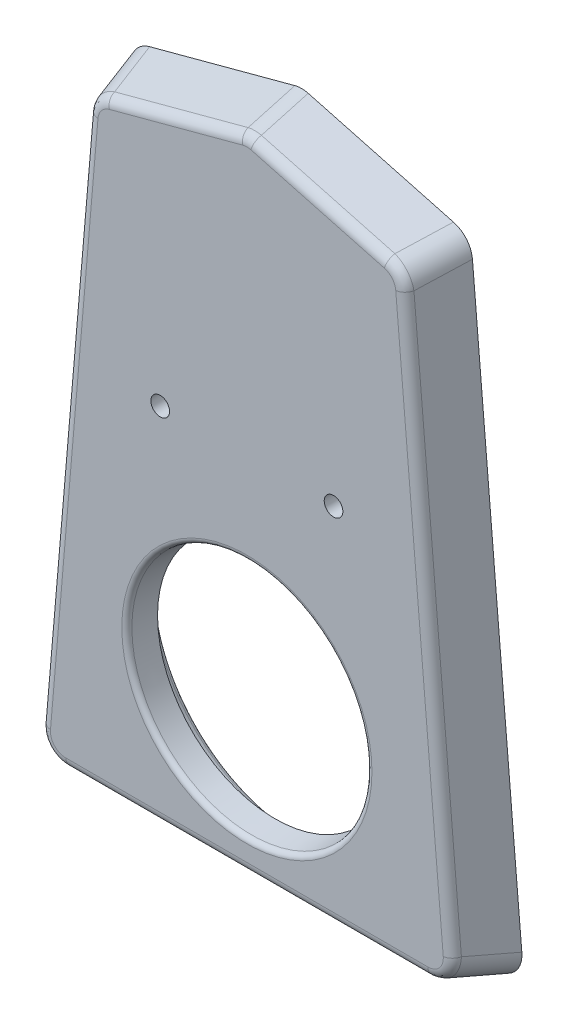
ISO-10303-21;
HEADER;
FILE_DESCRIPTION(('STEP AP214'),'2;1');
FILE_NAME('part.step','',(''),(''),'','','');
FILE_SCHEMA(('AUTOMOTIVE_DESIGN { 1 0 10303 214 1 1 1 1 }'));
ENDSEC;
DATA;
#1=APPLICATION_CONTEXT('core data for automotive mechanical design processes');
#2=APPLICATION_PROTOCOL_DEFINITION('international standard','automotive_design',2000,#1);
#3=PRODUCT_CONTEXT('',#1,'mechanical');
#4=PRODUCT('Part','Part','',(#3));
#5=PRODUCT_RELATED_PRODUCT_CATEGORY('part','',(#4));
#6=PRODUCT_DEFINITION_FORMATION('','',#4);
#7=PRODUCT_DEFINITION_CONTEXT('part definition',#1,'design');
#8=PRODUCT_DEFINITION('design','',#6,#7);
#9=PRODUCT_DEFINITION_SHAPE('','',#8);
#10=(LENGTH_UNIT() NAMED_UNIT(*) SI_UNIT(.MILLI.,.METRE.));
#11=(NAMED_UNIT(*) PLANE_ANGLE_UNIT() SI_UNIT($,.RADIAN.));
#12=(NAMED_UNIT(*) SI_UNIT($,.STERADIAN.) SOLID_ANGLE_UNIT());
#13=UNCERTAINTY_MEASURE_WITH_UNIT(LENGTH_MEASURE(1.E-05),#10,'distance_accuracy_value','');
#14=(GEOMETRIC_REPRESENTATION_CONTEXT(3) GLOBAL_UNCERTAINTY_ASSIGNED_CONTEXT((#13)) GLOBAL_UNIT_ASSIGNED_CONTEXT((#10,
#11,#12)) REPRESENTATION_CONTEXT('',''));
#15=CARTESIAN_POINT('',(0.,0.,0.));
#16=DIRECTION('',(0.,0.,1.));
#17=DIRECTION('',(1.,0.,0.));
#18=AXIS2_PLACEMENT_3D('',#15,#16,#17);
#19=CARTESIAN_POINT('',(83.5000000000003,0.,0.));
#20=DIRECTION('',(0.962386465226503,0.0826135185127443,0.258819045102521));
#21=DIRECTION('',(0.259706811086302,0.,-0.965687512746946));
#22=AXIS2_PLACEMENT_3D('',#19,#20,#21);
#23=PLANE('',#22);
#24=DIRECTION('',(-0.238446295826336,-0.199748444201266,0.950391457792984));
#25=VECTOR('',#24,1.);
#26=CARTESIAN_POINT('',(54.4082585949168,218.133142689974,38.5472087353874));
#27=LINE('',#26,#25);
#28=CARTESIAN_POINT('',(64.0794725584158,226.234799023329,0.));
#29=VERTEX_POINT('',#28);
#30=CARTESIAN_POINT('',(59.6799994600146,222.549323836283,17.5352761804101));
#31=VERTEX_POINT('',#30);
#32=EDGE_CURVE('E197',#29,#31,#27,.T.);
#33=ORIENTED_EDGE('',*,*,#32,.T.);
#34=DIRECTION('',(-0.0855278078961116,0.996335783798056,0.));
#35=VECTOR('',#34,1.);
#36=CARTESIAN_POINT('',(77.4067053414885,16.0462947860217,17.5352761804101));
#37=LINE('',#36,#35);
#38=CARTESIAN_POINT('',(77.4807304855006,15.1839565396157,17.5352761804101));
#39=VERTEX_POINT('',#38);
#40=EDGE_CURVE('E54',#31,#39,#37,.F.);
#41=ORIENTED_EDGE('',*,*,#40,.T.);
#42=DIRECTION('',(-0.271404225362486,0.249104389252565,0.929670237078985));
#43=VECTOR('',#42,1.);
#44=CARTESIAN_POINT('',(83.3751063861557,9.77389003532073,-2.65536688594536));
#45=LINE('',#44,#43);
#46=CARTESIAN_POINT('',(82.5999091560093,10.4853934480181,0.));
#47=VERTEX_POINT('',#46);
#48=EDGE_CURVE('E195',#39,#47,#45,.F.);
#49=ORIENTED_EDGE('',*,*,#48,.T.);
#50=DIRECTION('',(-0.0855278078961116,0.996335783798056,0.));
#51=VECTOR('',#50,1.);
#52=CARTESIAN_POINT('',(83.5000000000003,0.,0.));
#53=LINE('',#52,#51);
#54=EDGE_CURVE('E175',#47,#29,#53,.T.);
#55=ORIENTED_EDGE('',*,*,#54,.T.);
#56=EDGE_LOOP('',(#33,#41,#49,#55));
#57=FACE_BOUND('',#56,.T.);
#58=ADVANCED_FACE('F32',(#57),#23,.T.);
#59=CARTESIAN_POINT('',(63.5000000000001,232.985226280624,0.));
#60=DIRECTION('',(0.249999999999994,0.933012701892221,0.258819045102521));
#61=DIRECTION('',(0.,-0.267307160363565,0.96361137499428));
#62=AXIS2_PLACEMENT_3D('',#59,#60,#61);
#63=PLANE('',#62);
#64=DIRECTION('',(0.,-0.267307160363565,0.96361137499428));
#65=VECTOR('',#64,1.);
#66=CARTESIAN_POINT('',(2.50000000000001,248.16223289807,4.21012313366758));
#67=LINE('',#66,#65);
#68=CARTESIAN_POINT('',(2.49999999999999,249.330127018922,0.));
#69=VERTEX_POINT('',#68);
#70=CARTESIAN_POINT('',(2.50000000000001,244.465816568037,17.5352761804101));
#71=VERTEX_POINT('',#70);
#72=EDGE_CURVE('E159',#69,#71,#67,.T.);
#73=ORIENTED_EDGE('',*,*,#72,.T.);
#74=DIRECTION('',(-0.96592582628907,0.258819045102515,0.));
#75=VECTOR('',#74,1.);
#76=CARTESIAN_POINT('',(52.0179118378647,231.197532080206,17.5352761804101));
#77=LINE('',#76,#75);
#78=CARTESIAN_POINT('',(52.5561348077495,231.053315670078,17.5352761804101));
#79=VERTEX_POINT('',#78);
#80=EDGE_CURVE('E237',#71,#79,#77,.F.);
#81=ORIENTED_EDGE('',*,*,#80,.T.);
#82=DIRECTION('',(-0.238446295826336,-0.199748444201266,0.950391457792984));
#83=VECTOR('',#82,1.);
#84=CARTESIAN_POINT('',(57.2441790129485,234.98052927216,-1.15017729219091));
#85=LINE('',#84,#83);
#86=CARTESIAN_POINT('',(56.9556079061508,234.738790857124,0.));
#87=VERTEX_POINT('',#86);
#88=EDGE_CURVE('E163',#79,#87,#85,.F.);
#89=ORIENTED_EDGE('',*,*,#88,.T.);
#90=DIRECTION('',(-0.96592582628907,0.258819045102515,0.));
#91=VECTOR('',#90,1.);
#92=CARTESIAN_POINT('',(63.5000000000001,232.985226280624,0.));
#93=LINE('',#92,#91);
#94=EDGE_CURVE('E170',#87,#69,#93,.T.);
#95=ORIENTED_EDGE('',*,*,#94,.T.);
#96=EDGE_LOOP('',(#73,#81,#89,#95));
#97=FACE_BOUND('',#96,.T.);
#98=ADVANCED_FACE('F339',(#97),#63,.T.);
#99=CARTESIAN_POINT('',(-63.4999999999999,232.985226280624,0.));
#100=DIRECTION('',(-0.249999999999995,0.933012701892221,0.258819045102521));
#101=DIRECTION('',(0.,-0.267307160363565,0.96361137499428));
#102=AXIS2_PLACEMENT_3D('',#99,#100,#101);
#103=PLANE('',#102);
#104=DIRECTION('',(0.238446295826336,-0.199748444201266,0.950391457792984));
#105=VECTOR('',#104,1.);
#106=CARTESIAN_POINT('',(-57.2441790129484,234.98052927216,-1.15017729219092));
#107=LINE('',#106,#105);
#108=CARTESIAN_POINT('',(-56.9556079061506,234.738790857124,0.));
#109=VERTEX_POINT('',#108);
#110=CARTESIAN_POINT('',(-52.5561348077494,231.053315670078,17.5352761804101));
#111=VERTEX_POINT('',#110);
#112=EDGE_CURVE('E153',#109,#111,#107,.T.);
#113=ORIENTED_EDGE('',*,*,#112,.T.);
#114=DIRECTION('',(-0.96592582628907,-0.258819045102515,0.));
#115=VECTOR('',#114,1.);
#116=CARTESIAN_POINT('',(-2.70560464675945,244.410724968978,17.5352761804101));
#117=LINE('',#116,#115);
#118=CARTESIAN_POINT('',(-2.49999999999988,244.465816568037,17.5352761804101));
#119=VERTEX_POINT('',#118);
#120=EDGE_CURVE('E149',#111,#119,#117,.F.);
#121=ORIENTED_EDGE('',*,*,#120,.T.);
#122=DIRECTION('',(0.,-0.267307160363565,0.96361137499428));
#123=VECTOR('',#122,1.);
#124=CARTESIAN_POINT('',(-2.49999999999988,248.16223289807,4.21012313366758));
#125=LINE('',#124,#123);
#126=CARTESIAN_POINT('',(-2.49999999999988,249.330127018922,0.));
#127=VERTEX_POINT('',#126);
#128=EDGE_CURVE('E141',#119,#127,#125,.F.);
#129=ORIENTED_EDGE('',*,*,#128,.T.);
#130=DIRECTION('',(-0.96592582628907,-0.258819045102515,0.));
#131=VECTOR('',#130,1.);
#132=CARTESIAN_POINT('',(-63.4999999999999,232.985226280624,0.));
#133=LINE('',#132,#131);
#134=EDGE_CURVE('E146',#127,#109,#133,.T.);
#135=ORIENTED_EDGE('',*,*,#134,.T.);
#136=EDGE_LOOP('',(#113,#121,#129,#135));
#137=FACE_BOUND('',#136,.T.);
#138=ADVANCED_FACE('F144',(#137),#103,.T.);
#139=CARTESIAN_POINT('',(-83.5,0.,0.));
#140=DIRECTION('',(-0.962386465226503,0.0826135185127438,0.258819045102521));
#141=DIRECTION('',(0.259706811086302,0.,0.965687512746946));
#142=AXIS2_PLACEMENT_3D('',#139,#140,#141);
#143=PLANE('',#142);
#144=DIRECTION('',(0.271404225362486,0.249104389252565,0.929670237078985));
#145=VECTOR('',#144,1.);
#146=CARTESIAN_POINT('',(-83.3751063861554,9.7738900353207,-2.65536688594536));
#147=LINE('',#146,#145);
#148=CARTESIAN_POINT('',(-82.599909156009,10.4853934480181,0.));
#149=VERTEX_POINT('',#148);
#150=CARTESIAN_POINT('',(-77.4807304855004,15.1839565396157,17.5352761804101));
#151=VERTEX_POINT('',#150);
#152=EDGE_CURVE('E190',#149,#151,#147,.T.);
#153=ORIENTED_EDGE('',*,*,#152,.T.);
#154=DIRECTION('',(-0.0855278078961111,-0.996335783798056,0.));
#155=VECTOR('',#154,1.);
#156=CARTESIAN_POINT('',(-59.7276563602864,221.994156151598,17.5352761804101));
#157=LINE('',#156,#155);
#158=CARTESIAN_POINT('',(-59.6799994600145,222.549323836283,17.5352761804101));
#159=VERTEX_POINT('',#158);
#160=EDGE_CURVE('E228',#151,#159,#157,.F.);
#161=ORIENTED_EDGE('',*,*,#160,.T.);
#162=DIRECTION('',(0.238446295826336,-0.199748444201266,0.950391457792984));
#163=VECTOR('',#162,1.);
#164=CARTESIAN_POINT('',(-54.4082585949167,218.133142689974,38.5472087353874));
#165=LINE('',#164,#163);
#166=CARTESIAN_POINT('',(-64.0794725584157,226.234799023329,0.));
#167=VERTEX_POINT('',#166);
#168=EDGE_CURVE('E193',#159,#167,#165,.F.);
#169=ORIENTED_EDGE('',*,*,#168,.T.);
#170=DIRECTION('',(-0.0855278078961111,-0.996335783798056,0.));
#171=VECTOR('',#170,1.);
#172=CARTESIAN_POINT('',(-83.5,0.,0.));
#173=LINE('',#172,#171);
#174=EDGE_CURVE('E169',#167,#149,#173,.T.);
#175=ORIENTED_EDGE('',*,*,#174,.T.);
#176=EDGE_LOOP('',(#153,#161,#169,#175));
#177=FACE_BOUND('',#176,.T.);
#178=ADVANCED_FACE('F349',(#177),#143,.T.);
#179=CARTESIAN_POINT('',(0.,0.,0.));
#180=DIRECTION('',(0.,-0.965925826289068,0.258819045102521));
#181=DIRECTION('',(0.,-0.258819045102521,-0.965925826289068));
#182=AXIS2_PLACEMENT_3D('',#179,#180,#181);
#183=PLANE('',#182);
#184=DIRECTION('',(-0.271404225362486,0.249104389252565,0.929670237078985));
#185=VECTOR('',#184,1.);
#186=CARTESIAN_POINT('',(67.6006105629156,4.93376323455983,18.4130550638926));
#187=LINE('',#186,#185);
#188=CARTESIAN_POINT('',(72.9760445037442,0.,0.));
#189=VERTEX_POINT('',#188);
#190=CARTESIAN_POINT('',(67.8568658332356,4.69856309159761,17.5352761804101));
#191=VERTEX_POINT('',#190);
#192=EDGE_CURVE('E201',#189,#191,#187,.T.);
#193=ORIENTED_EDGE('',*,*,#192,.T.);
#194=DIRECTION('',(1.,0.,0.));
#195=VECTOR('',#194,1.);
#196=CARTESIAN_POINT('',(-66.9913561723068,4.69856309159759,17.5352761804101));
#197=LINE('',#196,#195);
#198=CARTESIAN_POINT('',(-67.8568658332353,4.69856309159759,17.5352761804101));
#199=VERTEX_POINT('',#198);
#200=EDGE_CURVE('E235',#191,#199,#197,.F.);
#201=ORIENTED_EDGE('',*,*,#200,.T.);
#202=DIRECTION('',(0.271404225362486,0.249104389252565,0.929670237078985));
#203=VECTOR('',#202,1.);
#204=CARTESIAN_POINT('',(-67.6006105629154,4.9337632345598,18.4130550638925));
#205=LINE('',#204,#203);
#206=CARTESIAN_POINT('',(-72.976044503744,0.,0.));
#207=VERTEX_POINT('',#206);
#208=EDGE_CURVE('E199',#199,#207,#205,.F.);
#209=ORIENTED_EDGE('',*,*,#208,.T.);
#210=DIRECTION('',(1.,0.,0.));
#211=VECTOR('',#210,1.);
#212=CARTESIAN_POINT('',(0.,0.,0.));
#213=LINE('',#212,#211);
#214=EDGE_CURVE('E173',#207,#189,#213,.T.);
#215=ORIENTED_EDGE('',*,*,#214,.T.);
#216=EDGE_LOOP('',(#193,#201,#209,#215));
#217=FACE_BOUND('',#216,.T.);
#218=ADVANCED_FACE('F346',(#217),#183,.T.);
#219=CARTESIAN_POINT('',(83.5000000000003,0.,20.5));
#220=DIRECTION('',(0.,0.,1.));
#221=DIRECTION('',(1.,0.,0.));
#222=AXIS2_PLACEMENT_3D('',#219,#220,#221);
#223=PLANE('',#222);
#224=CARTESIAN_POINT('',(-32.5000000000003,140.5,20.5));
#225=DIRECTION('',(0.,0.,-1.));
#226=DIRECTION('',(1.,0.,0.));
#227=AXIS2_PLACEMENT_3D('',#224,#225,#226);
#228=CIRCLE('',#227,3.5);
#229=CARTESIAN_POINT('',(-29.0000000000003,140.5,20.5));
#230=VERTEX_POINT('',#229);
#231=EDGE_CURVE('E724',#230,#230,#228,.T.);
#232=ORIENTED_EDGE('',*,*,#231,.T.);
#233=EDGE_LOOP('',(#232));
#234=FACE_BOUND('',#233,.T.);
#235=CARTESIAN_POINT('',(32.4999999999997,140.5,20.5));
#236=DIRECTION('',(0.,0.,-1.));
#237=DIRECTION('',(-1.,0.,0.));
#238=AXIS2_PLACEMENT_3D('',#235,#236,#237);
#239=CIRCLE('',#238,3.5);
#240=CARTESIAN_POINT('',(28.9999999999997,140.5,20.5));
#241=VERTEX_POINT('',#240);
#242=EDGE_CURVE('E247',#241,#241,#239,.T.);
#243=ORIENTED_EDGE('',*,*,#242,.T.);
#244=EDGE_LOOP('',(#243));
#245=FACE_BOUND('',#244,.T.);
#246=CARTESIAN_POINT('',(0.,61.5,20.5));
#247=DIRECTION('',(0.,0.,1.));
#248=DIRECTION('',(1.,0.,0.));
#249=AXIS2_PLACEMENT_3D('',#246,#247,#248);
#250=CIRCLE('',#249,46.9044025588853);
#251=CARTESIAN_POINT('',(46.9044025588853,61.5,20.5));
#252=VERTEX_POINT('',#251);
#253=EDGE_CURVE('E311',#252,#252,#250,.F.);
#254=ORIENTED_EDGE('',*,*,#253,.T.);
#255=EDGE_LOOP('',(#254));
#256=FACE_BOUND('',#255,.T.);
#257=DIRECTION('',(0.96592582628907,0.258819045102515,0.));
#258=VECTOR('',#257,1.);
#259=CARTESIAN_POINT('',(-51.0179118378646,227.465481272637,20.5));
#260=LINE('',#259,#258);
#261=CARTESIAN_POINT('',(-1.4999999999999,240.733765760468,20.5));
#262=VERTEX_POINT('',#261);
#263=CARTESIAN_POINT('',(-51.5561348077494,227.321264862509,20.5));
#264=VERTEX_POINT('',#263);
#265=EDGE_CURVE('E218',#262,#264,#260,.F.);
#266=ORIENTED_EDGE('',*,*,#265,.T.);
#267=CARTESIAN_POINT('',(-49.6665199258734,221.396805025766,20.5));
#268=DIRECTION('',(0.,0.,1.));
#269=DIRECTION('',(-0.766569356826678,0.642161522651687,0.));
#270=AXIS2_PLACEMENT_3D('',#267,#268,#269);
#271=ELLIPSE('',#270,6.31318805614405,6.);
#272=CARTESIAN_POINT('',(-55.8304535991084,222.218869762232,20.5));
#273=VERTEX_POINT('',#272);
#274=EDGE_CURVE('E222',#264,#273,#271,.T.);
#275=ORIENTED_EDGE('',*,*,#274,.T.);
#276=DIRECTION('',(0.0855278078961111,0.996335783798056,0.));
#277=VECTOR('',#276,1.);
#278=CARTESIAN_POINT('',(-73.5571594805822,15.7158407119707,20.5));
#279=LINE('',#278,#277);
#280=CARTESIAN_POINT('',(-73.6311846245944,14.8535024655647,20.5));
#281=VERTEX_POINT('',#280);
#282=EDGE_CURVE('E220',#273,#281,#279,.F.);
#283=ORIENTED_EDGE('',*,*,#282,.T.);
#284=CARTESIAN_POINT('',(-67.4035142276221,14.7739234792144,20.5));
#285=DIRECTION('',(0.,0.,1.));
#286=DIRECTION('',(-0.736725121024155,-0.676192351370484,0.));
#287=AXIS2_PLACEMENT_3D('',#284,#285,#286);
#288=ELLIPSE('',#287,6.45390135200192,6.);
#289=CARTESIAN_POINT('',(-67.8568658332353,8.56226639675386,20.5));
#290=VERTEX_POINT('',#289);
#291=EDGE_CURVE('E216',#281,#290,#288,.T.);
#292=ORIENTED_EDGE('',*,*,#291,.T.);
#293=DIRECTION('',(-1.,0.,0.));
#294=VECTOR('',#293,1.);
#295=CARTESIAN_POINT('',(66.9913561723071,8.56226639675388,20.5));
#296=LINE('',#295,#294);
#297=CARTESIAN_POINT('',(67.8568658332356,8.56226639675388,20.5));
#298=VERTEX_POINT('',#297);
#299=EDGE_CURVE('E212',#290,#298,#296,.F.);
#300=ORIENTED_EDGE('',*,*,#299,.T.);
#301=CARTESIAN_POINT('',(67.4035142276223,14.7739234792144,20.5));
#302=DIRECTION('',(0.,0.,1.));
#303=DIRECTION('',(0.736725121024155,-0.676192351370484,0.));
#304=AXIS2_PLACEMENT_3D('',#301,#302,#303);
#305=ELLIPSE('',#304,6.45390135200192,6.);
#306=CARTESIAN_POINT('',(73.6311846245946,14.8535024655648,20.5));
#307=VERTEX_POINT('',#306);
#308=EDGE_CURVE('E208',#298,#307,#305,.T.);
#309=ORIENTED_EDGE('',*,*,#308,.T.);
#310=DIRECTION('',(0.0855278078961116,-0.996335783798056,0.));
#311=VECTOR('',#310,1.);
#312=CARTESIAN_POINT('',(55.8781104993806,221.663702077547,20.5));
#313=LINE('',#312,#311);
#314=CARTESIAN_POINT('',(55.8304535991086,222.218869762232,20.5));
#315=VERTEX_POINT('',#314);
#316=EDGE_CURVE('E204',#307,#315,#313,.F.);
#317=ORIENTED_EDGE('',*,*,#316,.T.);
#318=CARTESIAN_POINT('',(49.6665199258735,221.396805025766,20.5));
#319=DIRECTION('',(0.,0.,1.));
#320=DIRECTION('',(0.766569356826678,0.642161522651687,0.));
#321=AXIS2_PLACEMENT_3D('',#318,#319,#320);
#322=ELLIPSE('',#321,6.31318805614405,6.);
#323=CARTESIAN_POINT('',(51.5561348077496,227.321264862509,20.5));
#324=VERTEX_POINT('',#323);
#325=EDGE_CURVE('E206',#315,#324,#322,.T.);
#326=ORIENTED_EDGE('',*,*,#325,.T.);
#327=DIRECTION('',(0.96592582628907,-0.258819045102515,0.));
#328=VECTOR('',#327,1.);
#329=CARTESIAN_POINT('',(1.70560464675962,240.678674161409,20.5));
#330=LINE('',#329,#328);
#331=CARTESIAN_POINT('',(1.50000000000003,240.733765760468,20.5));
#332=VERTEX_POINT('',#331);
#333=EDGE_CURVE('E210',#324,#332,#330,.F.);
#334=ORIENTED_EDGE('',*,*,#333,.T.);
#335=CARTESIAN_POINT('',(0.,234.704908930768,20.5));
#336=DIRECTION('',(0.,0.,1.));
#337=DIRECTION('',(0.,1.,0.));
#338=AXIS2_PLACEMENT_3D('',#335,#336,#337);
#339=ELLIPSE('',#338,6.22657655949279,6.);
#340=EDGE_CURVE('E214',#332,#262,#339,.T.);
#341=ORIENTED_EDGE('',*,*,#340,.T.);
#342=EDGE_LOOP('',(#266,#275,#283,#292,#300,#309,#317,#326,#334,#341));
#343=FACE_BOUND('',#342,.T.);
#344=ADVANCED_FACE('F267',(#234,#245,#256,#343),#223,.T.);
#345=CARTESIAN_POINT('',(83.5000000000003,0.,0.));
#346=DIRECTION('',(0.,0.,1.));
#347=DIRECTION('',(1.,0.,0.));
#348=AXIS2_PLACEMENT_3D('',#345,#346,#347);
#349=PLANE('',#348);
#350=CARTESIAN_POINT('',(0.,176.,0.));
#351=DIRECTION('',(0.,0.,1.));
#352=DIRECTION('',(1.,0.,0.));
#353=AXIS2_PLACEMENT_3D('',#350,#351,#352);
#354=CIRCLE('',#353,55.4581655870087);
#355=CARTESIAN_POINT('',(55.4581655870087,176.,0.));
#356=VERTEX_POINT('',#355);
#357=EDGE_CURVE('E11',#356,#356,#354,.T.);
#358=ORIENTED_EDGE('',*,*,#357,.T.);
#359=EDGE_LOOP('',(#358));
#360=FACE_BOUND('',#359,.T.);
#361=CARTESIAN_POINT('',(0.,61.5,0.));
#362=DIRECTION('',(0.,0.,1.));
#363=DIRECTION('',(1.,0.,0.));
#364=AXIS2_PLACEMENT_3D('',#361,#362,#363);
#365=CIRCLE('',#364,56.2081613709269);
#366=CARTESIAN_POINT('',(56.2081613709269,61.5,0.));
#367=VERTEX_POINT('',#366);
#368=EDGE_CURVE('E305',#367,#367,#365,.T.);
#369=ORIENTED_EDGE('',*,*,#368,.T.);
#370=EDGE_LOOP('',(#369));
#371=FACE_BOUND('',#370,.T.);
#372=CARTESIAN_POINT('',(66.5,15.,0.));
#373=DIRECTION('',(0.,0.,-1.));
#374=DIRECTION('',(1.,0.,0.));
#375=AXIS2_PLACEMENT_3D('',#372,#373,#374);
#376=CIRCLE('',#375,1.7);
#377=CARTESIAN_POINT('',(68.2,15.,0.));
#378=VERTEX_POINT('',#377);
#379=EDGE_CURVE('E732',#378,#378,#376,.T.);
#380=ORIENTED_EDGE('',*,*,#379,.F.);
#381=EDGE_LOOP('',(#380));
#382=FACE_BOUND('',#381,.T.);
#383=CARTESIAN_POINT('',(52.4,222.4,0.));
#384=DIRECTION('',(0.,0.,-1.));
#385=DIRECTION('',(1.,0.,0.));
#386=AXIS2_PLACEMENT_3D('',#383,#384,#385);
#387=CIRCLE('',#386,1.7);
#388=CARTESIAN_POINT('',(54.1,222.4,0.));
#389=VERTEX_POINT('',#388);
#390=EDGE_CURVE('E738',#389,#389,#387,.T.);
#391=ORIENTED_EDGE('',*,*,#390,.F.);
#392=EDGE_LOOP('',(#391));
#393=FACE_BOUND('',#392,.T.);
#394=CARTESIAN_POINT('',(-52.4,222.4,0.));
#395=DIRECTION('',(0.,0.,-1.));
#396=DIRECTION('',(-1.,0.,0.));
#397=AXIS2_PLACEMENT_3D('',#394,#395,#396);
#398=CIRCLE('',#397,1.7);
#399=CARTESIAN_POINT('',(-54.1,222.4,0.));
#400=VERTEX_POINT('',#399);
#401=EDGE_CURVE('E744',#400,#400,#398,.T.);
#402=ORIENTED_EDGE('',*,*,#401,.F.);
#403=EDGE_LOOP('',(#402));
#404=FACE_BOUND('',#403,.T.);
#405=CARTESIAN_POINT('',(-66.5,15.,0.));
#406=DIRECTION('',(0.,0.,-1.));
#407=DIRECTION('',(-1.,0.,0.));
#408=AXIS2_PLACEMENT_3D('',#405,#406,#407);
#409=CIRCLE('',#408,1.7);
#410=CARTESIAN_POINT('',(-68.2,15.,0.));
#411=VERTEX_POINT('',#410);
#412=EDGE_CURVE('E750',#411,#411,#409,.T.);
#413=ORIENTED_EDGE('',*,*,#412,.F.);
#414=EDGE_LOOP('',(#413));
#415=FACE_BOUND('',#414,.T.);
#416=ORIENTED_EDGE('',*,*,#134,.F.);
#417=CARTESIAN_POINT('',(0.,239.282032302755,0.));
#418=DIRECTION('',(0.,0.,1.));
#419=DIRECTION('',(0.,1.,0.));
#420=AXIS2_PLACEMENT_3D('',#417,#418,#419);
#421=ELLIPSE('',#420,10.3776275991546,10.);
#422=EDGE_CURVE('E156',#127,#69,#421,.F.);
#423=ORIENTED_EDGE('',*,*,#422,.T.);
#424=ORIENTED_EDGE('',*,*,#94,.F.);
#425=CARTESIAN_POINT('',(53.8062497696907,224.86469112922,0.));
#426=DIRECTION('',(0.,0.,1.));
#427=DIRECTION('',(0.766569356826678,0.642161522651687,0.));
#428=AXIS2_PLACEMENT_3D('',#425,#426,#427);
#429=ELLIPSE('',#428,10.5219800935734,10.);
#430=EDGE_CURVE('E185',#87,#29,#429,.F.);
#431=ORIENTED_EDGE('',*,*,#430,.T.);
#432=ORIENTED_EDGE('',*,*,#54,.F.);
#433=CARTESIAN_POINT('',(72.2204584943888,10.3527618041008,0.));
#434=DIRECTION('',(0.,0.,1.));
#435=DIRECTION('',(0.736725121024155,-0.676192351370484,0.));
#436=AXIS2_PLACEMENT_3D('',#433,#434,#435);
#437=ELLIPSE('',#436,10.7565022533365,10.);
#438=EDGE_CURVE('E183',#47,#189,#437,.F.);
#439=ORIENTED_EDGE('',*,*,#438,.T.);
#440=ORIENTED_EDGE('',*,*,#214,.F.);
#441=CARTESIAN_POINT('',(-72.2204584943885,10.3527618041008,0.));
#442=DIRECTION('',(0.,0.,1.));
#443=DIRECTION('',(-0.736725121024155,-0.676192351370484,0.));
#444=AXIS2_PLACEMENT_3D('',#441,#442,#443);
#445=ELLIPSE('',#444,10.7565022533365,10.);
#446=EDGE_CURVE('E152',#207,#149,#445,.F.);
#447=ORIENTED_EDGE('',*,*,#446,.T.);
#448=ORIENTED_EDGE('',*,*,#174,.F.);
#449=CARTESIAN_POINT('',(-53.8062497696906,224.86469112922,0.));
#450=DIRECTION('',(0.,0.,1.));
#451=DIRECTION('',(-0.766569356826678,0.642161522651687,0.));
#452=AXIS2_PLACEMENT_3D('',#449,#450,#451);
#453=ELLIPSE('',#452,10.5219800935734,10.);
#454=EDGE_CURVE('E164',#167,#109,#453,.F.);
#455=ORIENTED_EDGE('',*,*,#454,.T.);
#456=EDGE_LOOP('',(#416,#423,#424,#431,#432,#439,#440,#447,#448,#455));
#457=FACE_BOUND('',#456,.T.);
#458=ADVANCED_FACE('F166',(#360,#371,#382,#393,#404,#415,#457),#349,.F.);
#459=CARTESIAN_POINT('',(0.,61.5,0.));
#460=DIRECTION('',(0.,0.,-1.));
#461=DIRECTION('',(-1.,0.,0.));
#462=AXIS2_PLACEMENT_3D('',#459,#460,#461);
#463=CONICAL_SURFACE('',#462,54.5,0.15707963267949);
#464=CARTESIAN_POINT('',(0.,61.5,1.68713106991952));
#465=DIRECTION('',(0.,0.,1.));
#466=DIRECTION('',(1.,0.,0.));
#467=AXIS2_PLACEMENT_3D('',#464,#465,#466);
#468=CIRCLE('',#467,54.2327846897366);
#469=CARTESIAN_POINT('',(54.2327846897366,61.5,1.68713106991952));
#470=VERTEX_POINT('',#469);
#471=EDGE_CURVE('E302',#470,#470,#468,.F.);
#472=ORIENTED_EDGE('',*,*,#471,.T.);
#473=EDGE_LOOP('',(#472));
#474=FACE_BOUND('',#473,.T.);
#475=CARTESIAN_POINT('',(0.,61.5,8.31286893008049));
#476=DIRECTION('',(0.,0.,1.));
#477=DIRECTION('',(1.,0.,0.));
#478=AXIS2_PLACEMENT_3D('',#475,#476,#477);
#479=CIRCLE('',#478,53.183370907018);
#480=CARTESIAN_POINT('',(53.183370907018,61.5,8.31286893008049));
#481=VERTEX_POINT('',#480);
#482=EDGE_CURVE('E243',#481,#481,#479,.T.);
#483=ORIENTED_EDGE('',*,*,#482,.T.);
#484=EDGE_LOOP('',(#483));
#485=FACE_BOUND('',#484,.T.);
#486=ADVANCED_FACE('F382',(#474,#485),#463,.F.);
#487=CARTESIAN_POINT('',(0.,61.5,10.));
#488=DIRECTION('',(0.,0.,-1.));
#489=DIRECTION('',(-1.,0.,0.));
#490=AXIS2_PLACEMENT_3D('',#487,#488,#489);
#491=PLANE('',#490);
#492=CARTESIAN_POINT('',(0.,61.5,10.));
#493=DIRECTION('',(0.,0.,-1.));
#494=DIRECTION('',(-1.,0.,0.));
#495=AXIS2_PLACEMENT_3D('',#492,#493,#494);
#496=CIRCLE('',#495,51.2079942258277);
#497=CARTESIAN_POINT('',(-51.2079942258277,61.5,10.));
#498=VERTEX_POINT('',#497);
#499=EDGE_CURVE('E308',#498,#498,#496,.T.);
#500=ORIENTED_EDGE('',*,*,#499,.T.);
#501=EDGE_LOOP('',(#500));
#502=FACE_BOUND('',#501,.T.);
#503=CARTESIAN_POINT('',(0.,61.5,10.));
#504=DIRECTION('',(0.,0.,-1.));
#505=DIRECTION('',(-1.,0.,0.));
#506=AXIS2_PLACEMENT_3D('',#503,#504,#505);
#507=CIRCLE('',#506,44.);
#508=CARTESIAN_POINT('',(-44.,61.5,10.));
#509=VERTEX_POINT('',#508);
#510=EDGE_CURVE('E756',#509,#509,#507,.T.);
#511=ORIENTED_EDGE('',*,*,#510,.F.);
#512=EDGE_LOOP('',(#511));
#513=FACE_BOUND('',#512,.T.);
#514=ADVANCED_FACE('F391',(#502,#513),#491,.T.);
#515=CARTESIAN_POINT('',(0.,61.5,10.));
#516=DIRECTION('',(0.,0.,1.));
#517=DIRECTION('',(-1.,0.,0.));
#518=AXIS2_PLACEMENT_3D('',#515,#516,#517);
#519=CONICAL_SURFACE('',#518,44.,0.10471975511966);
#520=CARTESIAN_POINT('',(0.,61.5,18.7090569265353));
#521=DIRECTION('',(0.,0.,1.));
#522=DIRECTION('',(1.,0.,0.));
#523=AXIS2_PLACEMENT_3D('',#520,#521,#522);
#524=CIRCLE('',#523,44.9153587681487);
#525=CARTESIAN_POINT('',(44.9153587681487,61.5,18.7090569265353));
#526=VERTEX_POINT('',#525);
#527=EDGE_CURVE('E314',#526,#526,#524,.T.);
#528=ORIENTED_EDGE('',*,*,#527,.T.);
#529=EDGE_LOOP('',(#528));
#530=FACE_BOUND('',#529,.T.);
#531=ORIENTED_EDGE('',*,*,#510,.T.);
#532=EDGE_LOOP('',(#531));
#533=FACE_BOUND('',#532,.T.);
#534=ADVANCED_FACE('F399',(#530,#533),#519,.F.);
#535=CARTESIAN_POINT('',(0.,176.,0.));
#536=DIRECTION('',(0.,0.,-1.));
#537=DIRECTION('',(-1.,0.,0.));
#538=AXIS2_PLACEMENT_3D('',#535,#536,#537);
#539=CONICAL_SURFACE('',#538,55.,0.0872664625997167);
#540=CARTESIAN_POINT('',(0.,176.,0.456422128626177));
#541=DIRECTION('',(0.,0.,1.));
#542=DIRECTION('',(1.,0.,0.));
#543=AXIS2_PLACEMENT_3D('',#540,#541,#542);
#544=CIRCLE('',#543,54.9600682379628);
#545=CARTESIAN_POINT('',(54.9600682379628,176.,0.456422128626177));
#546=VERTEX_POINT('',#545);
#547=EDGE_CURVE('E40',#546,#546,#544,.F.);
#548=ORIENTED_EDGE('',*,*,#547,.T.);
#549=EDGE_LOOP('',(#548));
#550=FACE_BOUND('',#549,.T.);
#551=CARTESIAN_POINT('',(0.,176.,0.587155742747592));
#552=DIRECTION('',(0.,0.,1.));
#553=DIRECTION('',(1.,0.,0.));
#554=AXIS2_PLACEMENT_3D('',#551,#552,#553);
#555=CIRCLE('',#554,54.9486305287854);
#556=CARTESIAN_POINT('',(54.9486305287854,176.,0.587155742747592));
#557=VERTEX_POINT('',#556);
#558=EDGE_CURVE('E320',#557,#557,#555,.T.);
#559=ORIENTED_EDGE('',*,*,#558,.T.);
#560=EDGE_LOOP('',(#559));
#561=FACE_BOUND('',#560,.T.);
#562=ADVANCED_FACE('F325',(#550,#561),#539,.F.);
#563=CARTESIAN_POINT('',(0.,176.,1.5));
#564=DIRECTION('',(0.,0.,-1.));
#565=DIRECTION('',(-1.,0.,0.));
#566=AXIS2_PLACEMENT_3D('',#563,#564,#565);
#567=PLANE('',#566);
#568=CARTESIAN_POINT('',(-32.5000000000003,140.5,1.5));
#569=DIRECTION('',(0.,0.,-1.));
#570=DIRECTION('',(1.,0.,0.));
#571=AXIS2_PLACEMENT_3D('',#568,#569,#570);
#572=CIRCLE('',#571,3.5);
#573=CARTESIAN_POINT('',(-29.0000000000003,140.5,1.5));
#574=VERTEX_POINT('',#573);
#575=EDGE_CURVE('E728',#574,#574,#572,.T.);
#576=ORIENTED_EDGE('',*,*,#575,.F.);
#577=EDGE_LOOP('',(#576));
#578=FACE_BOUND('',#577,.T.);
#579=CARTESIAN_POINT('',(32.4999999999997,140.5,1.5));
#580=DIRECTION('',(0.,0.,-1.));
#581=DIRECTION('',(-1.,0.,0.));
#582=AXIS2_PLACEMENT_3D('',#579,#580,#581);
#583=CIRCLE('',#582,3.5);
#584=CARTESIAN_POINT('',(28.9999999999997,140.5,1.5));
#585=VERTEX_POINT('',#584);
#586=EDGE_CURVE('E722',#585,#585,#583,.T.);
#587=ORIENTED_EDGE('',*,*,#586,.F.);
#588=EDGE_LOOP('',(#587));
#589=FACE_BOUND('',#588,.T.);
#590=CARTESIAN_POINT('',(0.,176.,1.5));
#591=DIRECTION('',(0.,0.,-1.));
#592=DIRECTION('',(-1.,0.,0.));
#593=AXIS2_PLACEMENT_3D('',#590,#591,#592);
#594=CIRCLE('',#593,53.9524358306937);
#595=CARTESIAN_POINT('',(-53.9524358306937,176.,1.5));
#596=VERTEX_POINT('',#595);
#597=EDGE_CURVE('E317',#596,#596,#594,.T.);
#598=ORIENTED_EDGE('',*,*,#597,.T.);
#599=EDGE_LOOP('',(#598));
#600=FACE_BOUND('',#599,.T.);
#601=ADVANCED_FACE('F414',(#578,#589,#600),#567,.T.);
#602=CARTESIAN_POINT('',(-66.5,15.,0.));
#603=DIRECTION('',(0.,0.,-1.));
#604=DIRECTION('',(-1.,0.,0.));
#605=AXIS2_PLACEMENT_3D('',#602,#603,#604);
#606=CONICAL_SURFACE('',#605,1.7,0.0174532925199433);
#607=CARTESIAN_POINT('',(-66.5,15.,15.));
#608=DIRECTION('',(0.,0.,-1.));
#609=DIRECTION('',(-1.,0.,0.));
#610=AXIS2_PLACEMENT_3D('',#607,#608,#609);
#611=CIRCLE('',#610,1.43817402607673);
#612=CARTESIAN_POINT('',(-67.9381740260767,15.,15.));
#613=VERTEX_POINT('',#612);
#614=EDGE_CURVE('E753',#613,#613,#611,.T.);
#615=ORIENTED_EDGE('',*,*,#614,.F.);
#616=EDGE_LOOP('',(#615));
#617=FACE_BOUND('',#616,.T.);
#618=ORIENTED_EDGE('',*,*,#412,.T.);
#619=EDGE_LOOP('',(#618));
#620=FACE_BOUND('',#619,.T.);
#621=ADVANCED_FACE('F420',(#617,#620),#606,.F.);
#622=CARTESIAN_POINT('',(-66.5,15.,15.));
#623=DIRECTION('',(0.,0.,-1.));
#624=DIRECTION('',(-1.,0.,0.));
#625=AXIS2_PLACEMENT_3D('',#622,#623,#624);
#626=PLANE('',#625);
#627=ORIENTED_EDGE('',*,*,#614,.T.);
#628=EDGE_LOOP('',(#627));
#629=FACE_BOUND('',#628,.T.);
#630=ADVANCED_FACE('F429',(#629),#626,.T.);
#631=CARTESIAN_POINT('',(-52.4,222.4,0.));
#632=DIRECTION('',(0.,0.,-1.));
#633=DIRECTION('',(-1.,0.,0.));
#634=AXIS2_PLACEMENT_3D('',#631,#632,#633);
#635=CONICAL_SURFACE('',#634,1.7,0.0174532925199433);
#636=CARTESIAN_POINT('',(-52.4,222.4,15.));
#637=DIRECTION('',(0.,0.,-1.));
#638=DIRECTION('',(-1.,0.,0.));
#639=AXIS2_PLACEMENT_3D('',#636,#637,#638);
#640=CIRCLE('',#639,1.43817402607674);
#641=CARTESIAN_POINT('',(-53.8381740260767,222.4,15.));
#642=VERTEX_POINT('',#641);
#643=EDGE_CURVE('E747',#642,#642,#640,.T.);
#644=ORIENTED_EDGE('',*,*,#643,.F.);
#645=EDGE_LOOP('',(#644));
#646=FACE_BOUND('',#645,.T.);
#647=ORIENTED_EDGE('',*,*,#401,.T.);
#648=EDGE_LOOP('',(#647));
#649=FACE_BOUND('',#648,.T.);
#650=ADVANCED_FACE('F437',(#646,#649),#635,.F.);
#651=CARTESIAN_POINT('',(-52.4,222.4,15.));
#652=DIRECTION('',(0.,0.,-1.));
#653=DIRECTION('',(-1.,0.,0.));
#654=AXIS2_PLACEMENT_3D('',#651,#652,#653);
#655=PLANE('',#654);
#656=ORIENTED_EDGE('',*,*,#643,.T.);
#657=EDGE_LOOP('',(#656));
#658=FACE_BOUND('',#657,.T.);
#659=ADVANCED_FACE('F445',(#658),#655,.T.);
#660=CARTESIAN_POINT('',(52.4,222.4,0.));
#661=DIRECTION('',(0.,0.,-1.));
#662=DIRECTION('',(1.,0.,0.));
#663=AXIS2_PLACEMENT_3D('',#660,#661,#662);
#664=CONICAL_SURFACE('',#663,1.7,0.0174532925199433);
#665=CARTESIAN_POINT('',(52.4,222.4,15.));
#666=DIRECTION('',(0.,0.,1.));
#667=DIRECTION('',(1.,0.,0.));
#668=AXIS2_PLACEMENT_3D('',#665,#666,#667);
#669=CIRCLE('',#668,1.43817402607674);
#670=CARTESIAN_POINT('',(53.8381740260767,222.4,15.));
#671=VERTEX_POINT('',#670);
#672=EDGE_CURVE('E741',#671,#671,#669,.F.);
#673=ORIENTED_EDGE('',*,*,#672,.F.);
#674=EDGE_LOOP('',(#673));
#675=FACE_BOUND('',#674,.T.);
#676=ORIENTED_EDGE('',*,*,#390,.T.);
#677=EDGE_LOOP('',(#676));
#678=FACE_BOUND('',#677,.T.);
#679=ADVANCED_FACE('F453',(#675,#678),#664,.F.);
#680=CARTESIAN_POINT('',(52.4,222.4,15.));
#681=DIRECTION('',(0.,0.,1.));
#682=DIRECTION('',(1.,0.,0.));
#683=AXIS2_PLACEMENT_3D('',#680,#681,#682);
#684=PLANE('',#683);
#685=ORIENTED_EDGE('',*,*,#672,.T.);
#686=EDGE_LOOP('',(#685));
#687=FACE_BOUND('',#686,.T.);
#688=ADVANCED_FACE('F461',(#687),#684,.F.);
#689=CARTESIAN_POINT('',(66.5,15.,0.));
#690=DIRECTION('',(0.,0.,-1.));
#691=DIRECTION('',(1.,0.,0.));
#692=AXIS2_PLACEMENT_3D('',#689,#690,#691);
#693=CONICAL_SURFACE('',#692,1.7,0.0174532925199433);
#694=CARTESIAN_POINT('',(66.5,15.,15.));
#695=DIRECTION('',(0.,0.,1.));
#696=DIRECTION('',(1.,0.,0.));
#697=AXIS2_PLACEMENT_3D('',#694,#695,#696);
#698=CIRCLE('',#697,1.43817402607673);
#699=CARTESIAN_POINT('',(67.9381740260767,15.,15.));
#700=VERTEX_POINT('',#699);
#701=EDGE_CURVE('E735',#700,#700,#698,.F.);
#702=ORIENTED_EDGE('',*,*,#701,.F.);
#703=EDGE_LOOP('',(#702));
#704=FACE_BOUND('',#703,.T.);
#705=ORIENTED_EDGE('',*,*,#379,.T.);
#706=EDGE_LOOP('',(#705));
#707=FACE_BOUND('',#706,.T.);
#708=ADVANCED_FACE('F469',(#704,#707),#693,.F.);
#709=CARTESIAN_POINT('',(66.5,15.,15.));
#710=DIRECTION('',(0.,0.,1.));
#711=DIRECTION('',(1.,0.,0.));
#712=AXIS2_PLACEMENT_3D('',#709,#710,#711);
#713=PLANE('',#712);
#714=ORIENTED_EDGE('',*,*,#701,.T.);
#715=EDGE_LOOP('',(#714));
#716=FACE_BOUND('',#715,.T.);
#717=ADVANCED_FACE('F477',(#716),#713,.F.);
#718=CARTESIAN_POINT('',(0.,238.832105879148,1.62193268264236));
#719=DIRECTION('',(0.,0.267307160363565,-0.96361137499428));
#720=DIRECTION('',(0.,0.96361137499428,0.267307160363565));
#721=AXIS2_PLACEMENT_3D('',#718,#719,#720);
#722=CYLINDRICAL_SURFACE('',#721,10.);
#723=ORIENTED_EDGE('',*,*,#128,.F.);
#724=CARTESIAN_POINT('',(0.,234.704908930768,16.5));
#725=DIRECTION('',(0.,0.105471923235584,-0.994422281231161));
#726=DIRECTION('',(0.,0.994422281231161,0.105471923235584));
#727=AXIS2_PLACEMENT_3D('',#724,#725,#726);
#728=ELLIPSE('',#727,10.1375665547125,10.);
#729=EDGE_CURVE('E233',#119,#71,#728,.T.);
#730=ORIENTED_EDGE('',*,*,#729,.T.);
#731=ORIENTED_EDGE('',*,*,#72,.F.);
#732=ORIENTED_EDGE('',*,*,#422,.F.);
#733=EDGE_LOOP('',(#723,#730,#731,#732));
#734=FACE_BOUND('',#733,.T.);
#735=ADVANCED_FACE('F157',(#734),#722,.T.);
#736=CARTESIAN_POINT('',(-44.7843939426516,217.307007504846,35.9590182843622));
#737=DIRECTION('',(-0.238446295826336,0.199748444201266,-0.950391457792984));
#738=DIRECTION('',(-0.969938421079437,0.,0.24335048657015));
#739=AXIS2_PLACEMENT_3D('',#736,#737,#738);
#740=CYLINDRICAL_SURFACE('',#739,10.);
#741=ORIENTED_EDGE('',*,*,#168,.F.);
#742=CARTESIAN_POINT('',(-49.6665199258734,221.396805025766,16.5));
#743=DIRECTION('',(-0.0935909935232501,0.0784019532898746,-0.992518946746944));
#744=DIRECTION('',(-0.760834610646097,0.637357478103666,0.12209070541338));
#745=AXIS2_PLACEMENT_3D('',#742,#743,#744);
#746=ELLIPSE('',#745,10.1909932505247,10.);
#747=EDGE_CURVE('E225',#159,#111,#746,.T.);
#748=ORIENTED_EDGE('',*,*,#747,.T.);
#749=ORIENTED_EDGE('',*,*,#112,.F.);
#750=ORIENTED_EDGE('',*,*,#454,.F.);
#751=EDGE_LOOP('',(#741,#748,#749,#750));
#752=FACE_BOUND('',#751,.T.);
#753=ADVANCED_FACE('F271',(#752),#740,.T.);
#754=CARTESIAN_POINT('',(54.7441790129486,225.650402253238,-3.73836774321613));
#755=DIRECTION('',(0.238446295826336,0.199748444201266,-0.950391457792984));
#756=DIRECTION('',(-0.969938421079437,0.,-0.243350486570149));
#757=AXIS2_PLACEMENT_3D('',#754,#755,#756);
#758=CYLINDRICAL_SURFACE('',#757,10.);
#759=ORIENTED_EDGE('',*,*,#88,.F.);
#760=CARTESIAN_POINT('',(49.6665199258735,221.396805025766,16.5));
#761=DIRECTION('',(0.0935909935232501,0.0784019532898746,-0.992518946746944));
#762=DIRECTION('',(0.760834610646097,0.637357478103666,0.12209070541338));
#763=AXIS2_PLACEMENT_3D('',#760,#761,#762);
#764=ELLIPSE('',#763,10.1909932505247,10.);
#765=EDGE_CURVE('E47',#79,#31,#764,.T.);
#766=ORIENTED_EDGE('',*,*,#765,.T.);
#767=ORIENTED_EDGE('',*,*,#32,.F.);
#768=ORIENTED_EDGE('',*,*,#430,.F.);
#769=EDGE_LOOP('',(#759,#766,#767,#768));
#770=FACE_BOUND('',#769,.T.);
#771=ADVANCED_FACE('F276',(#770),#758,.T.);
#772=CARTESIAN_POINT('',(73.7512417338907,8.94775485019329,-5.24355733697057));
#773=DIRECTION('',(0.271404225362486,-0.249104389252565,-0.929670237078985));
#774=DIRECTION('',(-0.959930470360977,0.,-0.280238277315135));
#775=AXIS2_PLACEMENT_3D('',#772,#773,#774);
#776=CYLINDRICAL_SURFACE('',#775,10.);
#777=ORIENTED_EDGE('',*,*,#48,.F.);
#778=CARTESIAN_POINT('',(67.4035142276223,14.7739234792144,16.5));
#779=DIRECTION('',(0.105617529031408,-0.0969395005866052,-0.989670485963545));
#780=DIRECTION('',(0.729115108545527,-0.669207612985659,0.143360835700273));
#781=AXIS2_PLACEMENT_3D('',#778,#779,#780);
#782=ELLIPSE('',#781,10.2787568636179,10.);
#783=EDGE_CURVE('E239',#39,#191,#782,.T.);
#784=ORIENTED_EDGE('',*,*,#783,.T.);
#785=ORIENTED_EDGE('',*,*,#192,.F.);
#786=ORIENTED_EDGE('',*,*,#438,.F.);
#787=EDGE_LOOP('',(#777,#784,#785,#786));
#788=FACE_BOUND('',#787,.T.);
#789=ADVANCED_FACE('F282',(#788),#776,.T.);
#790=CARTESIAN_POINT('',(-67.6006105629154,14.5930214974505,15.8248646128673));
#791=DIRECTION('',(-0.271404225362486,-0.249104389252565,-0.929670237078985));
#792=DIRECTION('',(-0.959930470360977,0.,0.280238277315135));
#793=AXIS2_PLACEMENT_3D('',#790,#791,#792);
#794=CYLINDRICAL_SURFACE('',#793,10.);
#795=ORIENTED_EDGE('',*,*,#208,.F.);
#796=CARTESIAN_POINT('',(-67.4035142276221,14.7739234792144,16.5));
#797=DIRECTION('',(-0.105617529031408,-0.0969395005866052,-0.989670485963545));
#798=DIRECTION('',(-0.729115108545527,-0.669207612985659,0.143360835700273));
#799=AXIS2_PLACEMENT_3D('',#796,#797,#798);
#800=ELLIPSE('',#799,10.2787568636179,10.);
#801=EDGE_CURVE('E231',#199,#151,#800,.T.);
#802=ORIENTED_EDGE('',*,*,#801,.T.);
#803=ORIENTED_EDGE('',*,*,#152,.F.);
#804=ORIENTED_EDGE('',*,*,#446,.F.);
#805=EDGE_LOOP('',(#795,#802,#803,#804));
#806=FACE_BOUND('',#805,.T.);
#807=ADVANCED_FACE('F263',(#806),#794,.T.);
#808=CARTESIAN_POINT('',(74.9691075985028,-0.732311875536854,16.5));
#809=DIRECTION('',(-0.0855278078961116,0.996335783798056,0.));
#810=DIRECTION('',(-0.996335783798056,-0.0855278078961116,0.));
#811=AXIS2_PLACEMENT_3D('',#808,#809,#810);
#812=CYLINDRICAL_SURFACE('',#811,4.);
#813=CARTESIAN_POINT('',(73.6311846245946,14.8535024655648,16.5));
#814=DIRECTION('',(0.0855278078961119,-0.996335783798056,0.));
#815=DIRECTION('',(0.996335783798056,0.0855278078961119,0.));
#816=AXIS2_PLACEMENT_3D('',#813,#814,#815);
#817=CIRCLE('',#816,4.);
#818=EDGE_CURVE('E787',#39,#307,#817,.T.);
#819=ORIENTED_EDGE('',*,*,#818,.F.);
#820=ORIENTED_EDGE('',*,*,#40,.F.);
#821=CARTESIAN_POINT('',(55.8304535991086,222.218869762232,16.5));
#822=DIRECTION('',(-0.0855278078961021,0.996335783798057,0.));
#823=DIRECTION('',(-0.996335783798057,-0.0855278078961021,0.));
#824=AXIS2_PLACEMENT_3D('',#821,#822,#823);
#825=CIRCLE('',#824,4.);
#826=EDGE_CURVE('E299',#315,#31,#825,.T.);
#827=ORIENTED_EDGE('',*,*,#826,.F.);
#828=ORIENTED_EDGE('',*,*,#316,.F.);
#829=EDGE_LOOP('',(#819,#820,#827,#828));
#830=FACE_BOUND('',#829,.T.);
#831=ADVANCED_FACE('F291',(#830),#812,.T.);
#832=CARTESIAN_POINT('',(57.4201803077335,227.892110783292,17.7442255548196));
#833=CARTESIAN_POINT('',(56.7287765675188,227.312916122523,20.5));
#834=CARTESIAN_POINT('',(54.5060164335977,225.450891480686,20.5));
#835=CARTESIAN_POINT('',(57.139900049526,228.226690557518,17.7442255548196));
#836=CARTESIAN_POINT('',(56.4750959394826,227.615743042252,20.5));
#837=CARTESIAN_POINT('',(54.3378482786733,225.651639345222,20.5));
#838=CARTESIAN_POINT('',(56.8374180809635,228.542671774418,17.7406628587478));
#839=CARTESIAN_POINT('',(56.2025155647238,227.903087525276,20.5));
#840=CARTESIAN_POINT('',(54.1558227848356,225.840778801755,20.5));
#841=CARTESIAN_POINT('',(56.1933158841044,229.132092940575,17.7264864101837));
#842=CARTESIAN_POINT('',(55.6239249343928,228.442355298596,20.5));
#843=CARTESIAN_POINT('',(53.7672274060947,226.192643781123,20.5));
#844=CARTESIAN_POINT('',(55.8516259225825,229.405454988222,17.7158599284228));
#845=CARTESIAN_POINT('',(55.3174193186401,228.694529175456,20.5));
#846=CARTESIAN_POINT('',(53.5606137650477,226.355320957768,20.5));
#847=CARTESIAN_POINT('',(55.1350198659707,229.905043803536,17.6877505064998));
#848=CARTESIAN_POINT('',(54.6749923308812,229.160227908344,20.5));
#849=CARTESIAN_POINT('',(53.1264186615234,226.651529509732,20.5));
#850=CARTESIAN_POINT('',(54.7599924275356,230.131103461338,17.6702438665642));
#851=CARTESIAN_POINT('',(54.3384702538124,229.373815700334,20.5));
#852=CARTESIAN_POINT('',(52.8987668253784,226.784957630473,20.5));
#853=CARTESIAN_POINT('',(53.9831623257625,230.532310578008,17.628684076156));
#854=CARTESIAN_POINT('',(53.6403149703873,229.759529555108,20.5));
#855=CARTESIAN_POINT('',(52.4264125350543,227.020441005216,20.5));
#856=CARTESIAN_POINT('',(53.5812379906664,230.7072043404,17.6045994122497));
#857=CARTESIAN_POINT('',(53.2780267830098,229.931520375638,20.5));
#858=CARTESIAN_POINT('',(52.1816323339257,227.122340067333,20.5));
#859=CARTESIAN_POINT('',(52.7574922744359,231.003171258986,17.5503024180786));
#860=CARTESIAN_POINT('',(52.5328961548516,230.231643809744,20.5));
#861=CARTESIAN_POINT('',(51.6792112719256,227.293073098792,20.5));
#862=CARTESIAN_POINT('',(52.3355672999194,231.123920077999,17.5200546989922));
#863=CARTESIAN_POINT('',(52.149395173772,230.359448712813,20.5));
#864=CARTESIAN_POINT('',(51.4215029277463,227.361708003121,20.5));
#865=CARTESIAN_POINT('',(51.4790125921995,231.309595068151,17.4539516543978));
#866=CARTESIAN_POINT('',(51.3666171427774,230.569215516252,20.5));
#867=CARTESIAN_POINT('',(50.8976192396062,227.46477707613,20.5));
#868=CARTESIAN_POINT('',(51.0443179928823,231.374152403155,17.4180610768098));
#869=CARTESIAN_POINT('',(50.9667233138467,230.650676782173,20.5));
#870=CARTESIAN_POINT('',(50.631399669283,227.498985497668,20.5));
#871=CARTESIAN_POINT('',(50.1696160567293,231.446374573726,17.3412848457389));
#872=CARTESIAN_POINT('',(50.1561368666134,230.766175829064,20.5));
#873=CARTESIAN_POINT('',(50.0950209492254,227.53263693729,20.5));
#874=CARTESIAN_POINT('',(49.7295926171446,231.453657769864,17.3003675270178));
#875=CARTESIAN_POINT('',(49.7449059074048,230.799569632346,20.5));
#876=CARTESIAN_POINT('',(49.824847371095,227.531846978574,20.5));
#877=CARTESIAN_POINT('',(48.8517089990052,231.411208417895,17.2142330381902));
#878=CARTESIAN_POINT('',(48.9168090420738,230.817750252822,20.5));
#879=CARTESIAN_POINT('',(49.285150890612,227.495515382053,20.5));
#880=CARTESIAN_POINT('',(48.4138802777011,231.361113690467,17.1689902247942));
#881=CARTESIAN_POINT('',(48.4995100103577,230.801785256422,20.5));
#882=CARTESIAN_POINT('',(49.0156430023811,227.459753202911,20.5));
#883=CARTESIAN_POINT('',(47.5478288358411,231.204734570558,17.0749718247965));
#884=CARTESIAN_POINT('',(47.6646254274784,230.720457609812,20.5));
#885=CARTESIAN_POINT('',(48.4818590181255,227.354069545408,20.5));
#886=CARTESIAN_POINT('',(47.1196739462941,231.098135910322,17.0261778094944));
#887=CARTESIAN_POINT('',(47.2467292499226,230.654273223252,20.5));
#888=CARTESIAN_POINT('',(48.2176208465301,227.283957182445,20.5));
#889=CARTESIAN_POINT('',(46.2802613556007,230.830514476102,16.9258840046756));
#890=CARTESIAN_POINT('',(46.4161927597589,230.472112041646,20.5));
#891=CARTESIAN_POINT('',(47.698875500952,227.110736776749,20.5));
#892=CARTESIAN_POINT('',(45.8690892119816,230.669246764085,16.8743729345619));
#893=CARTESIAN_POINT('',(46.0033735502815,230.355281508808,20.5));
#894=CARTESIAN_POINT('',(47.4444179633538,227.007480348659,20.5));
#895=CARTESIAN_POINT('',(45.0706634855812,230.294968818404,16.7695189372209));
#896=CARTESIAN_POINT('',(45.188748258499,230.071845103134,20.5));
#897=CARTESIAN_POINT('',(46.949578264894,226.76969097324,20.5));
#898=CARTESIAN_POINT('',(44.6834902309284,230.081795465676,16.716170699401));
#899=CARTESIAN_POINT('',(44.7868979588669,229.904390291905,20.5));
#900=CARTESIAN_POINT('',(46.7092435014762,226.635059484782,20.5));
#901=CARTESIAN_POINT('',(43.9396972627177,229.607266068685,16.6085492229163));
#902=CARTESIAN_POINT('',(44.0002136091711,229.520170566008,20.5));
#903=CARTESIAN_POINT('',(46.246766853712,226.336770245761,20.5));
#904=CARTESIAN_POINT('',(43.5831286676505,229.345831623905,16.5542746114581));
#905=CARTESIAN_POINT('',(43.6154681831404,229.302597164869,20.5));
#906=CARTESIAN_POINT('',(46.0246554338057,226.173065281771,20.5));
#907=CARTESIAN_POINT('',(42.9066807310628,228.779165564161,16.4457253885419));
#908=CARTESIAN_POINT('',(42.869278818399,228.819119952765,20.5));
#909=CARTESIAN_POINT('',(45.6024461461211,225.819377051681,20.5));
#910=CARTESIAN_POINT('',(42.5868013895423,228.473933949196,16.3914507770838));
#911=CARTESIAN_POINT('',(42.508050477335,228.552483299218,20.5));
#912=CARTESIAN_POINT('',(45.4023482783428,225.629393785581,20.5));
#913=CARTESIAN_POINT('',(41.9892613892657,227.824817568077,16.283829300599));
#914=CARTESIAN_POINT('',(41.8154940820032,227.972480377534,20.5));
#915=CARTESIAN_POINT('',(45.0276234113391,225.226352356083,20.5));
#916=CARTESIAN_POINT('',(41.7115325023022,227.480996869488,16.2304810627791));
#917=CARTESIAN_POINT('',(41.4844984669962,227.658492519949,20.5));
#918=CARTESIAN_POINT('',(44.8529552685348,225.013332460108,20.5));
#919=CARTESIAN_POINT('',(41.2031175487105,226.760523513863,16.1256270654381));
#920=CARTESIAN_POINT('',(40.8593291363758,226.986165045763,20.5));
#921=CARTESIAN_POINT('',(44.5321220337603,224.567825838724,20.5));
#922=CARTESIAN_POINT('',(40.9722849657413,226.383978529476,16.0741159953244));
#923=CARTESIAN_POINT('',(40.5655890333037,226.627351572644,20.5));
#924=CARTESIAN_POINT('',(44.385868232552,224.335403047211,20.5));
#925=CARTESIAN_POINT('',(40.5616925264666,225.604460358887,15.9738221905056));
#926=CARTESIAN_POINT('',(40.0221362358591,225.868736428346,20.5));
#927=CARTESIAN_POINT('',(44.1244149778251,223.855044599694,20.5));
#928=CARTESIAN_POINT('',(40.3817065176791,225.201614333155,15.9250281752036));
#929=CARTESIAN_POINT('',(39.7729350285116,225.468645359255,20.5));
#930=CARTESIAN_POINT('',(44.0090781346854,223.607183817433,20.5));
#931=CARTESIAN_POINT('',(40.0759660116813,224.376373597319,15.8310097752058));
#932=CARTESIAN_POINT('',(39.3259285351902,224.63207739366,20.5));
#933=CARTESIAN_POINT('',(43.8114807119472,223.100183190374,20.5));
#934=CARTESIAN_POINT('',(39.9499139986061,223.954100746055,15.7857669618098));
#935=CARTESIAN_POINT('',(39.1286793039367,224.195530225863,20.5));
#936=CARTESIAN_POINT('',(43.7290388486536,222.84111413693,20.5));
#937=CARTESIAN_POINT('',(39.7542662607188,223.097243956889,15.6996324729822));
#938=CARTESIAN_POINT('',(38.7928683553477,223.292161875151,20.5));
#939=CARTESIAN_POINT('',(43.5986838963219,222.316138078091,20.5));
#940=CARTESIAN_POINT('',(39.6843194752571,222.662754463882,15.6587151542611));
#941=CARTESIAN_POINT('',(38.6548621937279,222.825517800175,20.5));
#942=CARTESIAN_POINT('',(43.5505563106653,222.050284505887,20.5));
#943=CARTESIAN_POINT('',(39.6021260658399,221.788933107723,15.5819389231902));
#944=CARTESIAN_POINT('',(38.4443629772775,221.869813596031,20.5));
#945=CARTESIAN_POINT('',(43.4896827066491,221.516309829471,20.5));
#946=CARTESIAN_POINT('',(39.589500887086,221.34965227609,15.5460483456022));
#947=CARTESIAN_POINT('',(38.3723682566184,221.381193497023,20.5));
#948=CARTESIAN_POINT('',(43.4767047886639,221.248215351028,20.5));
#949=CARTESIAN_POINT('',(39.6221847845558,220.473813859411,15.4799453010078));
#950=CARTESIAN_POINT('',(38.2997060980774,220.391267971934,20.5));
#951=CARTESIAN_POINT('',(43.4863642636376,220.714376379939,20.5));
#952=CARTESIAN_POINT('',(39.6671193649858,220.037257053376,15.4496975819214));
#953=CARTESIAN_POINT('',(38.2994146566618,219.890661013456,20.5));
#954=CARTESIAN_POINT('',(43.5087716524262,220.448627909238,20.5));
#955=CARTESIAN_POINT('',(39.8141381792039,219.174390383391,15.3954005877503));
#956=CARTESIAN_POINT('',(38.3742944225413,218.888291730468,20.5));
#957=CARTESIAN_POINT('',(43.5888093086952,219.924060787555,20.5));
#958=CARTESIAN_POINT('',(39.9158849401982,218.748035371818,15.371315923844));
#959=CARTESIAN_POINT('',(38.4496530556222,218.38745533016,20.5));
#960=CARTESIAN_POINT('',(43.6462317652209,219.665210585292,20.5));
#961=CARTESIAN_POINT('',(40.1747374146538,217.912914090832,15.3297561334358));
#962=CARTESIAN_POINT('',(38.6775889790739,217.397603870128,20.5));
#963=CARTESIAN_POINT('',(43.795287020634,219.158896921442,20.5));
#964=CARTESIAN_POINT('',(40.331572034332,217.504072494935,15.3122494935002));
#965=CARTESIAN_POINT('',(38.8301087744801,216.909681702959,20.5));
#966=CARTESIAN_POINT('',(43.8867524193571,218.911384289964,20.5));
#967=CARTESIAN_POINT('',(40.697838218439,216.711001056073,15.2841400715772));
#968=CARTESIAN_POINT('',(39.2111487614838,215.959419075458,20.5));
#969=CARTESIAN_POINT('',(44.102280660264,218.431996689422,20.5));
#970=CARTESIAN_POINT('',(40.907085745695,216.326690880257,15.2735135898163));
#971=CARTESIAN_POINT('',(39.4393327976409,215.498251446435,20.5));
#972=CARTESIAN_POINT('',(44.2262295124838,218.20007053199,20.5));
#973=CARTESIAN_POINT('',(41.3745007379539,215.589257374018,15.2593371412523));
#974=CARTESIAN_POINT('',(39.9671776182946,214.615116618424,20.5));
#975=CARTESIAN_POINT('',(44.5045444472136,217.75582270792,20.5));
#976=CARTESIAN_POINT('',(41.6325792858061,215.236079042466,15.2557744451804));
#977=CARTESIAN_POINT('',(40.2662233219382,214.194298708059,20.5));
#978=CARTESIAN_POINT('',(44.6588552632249,217.543466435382,20.5));
#979=CARTESIAN_POINT('',(42.193139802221,214.566919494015,15.2557744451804));
#980=CARTESIAN_POINT('',(40.9280197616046,213.404290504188,20.5));
#981=CARTESIAN_POINT('',(44.9951915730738,217.141970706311,20.5));
#982=CARTESIAN_POINT('',(42.4956217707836,214.250938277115,15.2593371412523));
#983=CARTESIAN_POINT('',(41.2899146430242,213.036121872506,20.5));
#984=CARTESIAN_POINT('',(45.1772170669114,216.952831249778,20.5));
#985=CARTESIAN_POINT('',(43.1397239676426,213.661517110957,15.2735135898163));
#986=CARTESIAN_POINT('',(42.0668723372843,212.361670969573,20.5));
#987=CARTESIAN_POINT('',(45.5658124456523,216.60096627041,20.5));
#988=CARTESIAN_POINT('',(43.4814139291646,213.388155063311,15.2841400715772));
#989=CARTESIAN_POINT('',(42.4809114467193,212.056195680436,20.5));
#990=CARTESIAN_POINT('',(45.7724260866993,216.438289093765,20.5));
#991=CARTESIAN_POINT('',(44.1980199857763,212.888566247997,15.3122494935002));
#992=CARTESIAN_POINT('',(43.3496865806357,211.514512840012,20.5));
#993=CARTESIAN_POINT('',(46.2066211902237,216.142080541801,20.5));
#994=CARTESIAN_POINT('',(44.5730474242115,212.662506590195,15.3297561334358));
#995=CARTESIAN_POINT('',(43.8033268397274,211.278841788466,20.5));
#996=CARTESIAN_POINT('',(46.4342730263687,216.008652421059,20.5));
#997=CARTESIAN_POINT('',(45.3498775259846,212.261299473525,15.371315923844));
#998=CARTESIAN_POINT('',(44.7379106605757,210.880955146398,20.5));
#999=CARTESIAN_POINT('',(46.9066273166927,215.773169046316,20.5));
#1000=CARTESIAN_POINT('',(45.7518018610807,212.086405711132,15.3954005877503));
#1001=CARTESIAN_POINT('',(45.2177883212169,210.718987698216,20.5));
#1002=CARTESIAN_POINT('',(47.1514075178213,215.6712699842,20.5));
#1003=CARTESIAN_POINT('',(46.5755475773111,211.790438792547,15.4496975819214));
#1004=CARTESIAN_POINT('',(46.1915204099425,210.469594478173,20.5));
#1005=CARTESIAN_POINT('',(47.6538285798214,215.500536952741,20.5));
#1006=CARTESIAN_POINT('',(46.9974725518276,211.669689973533,15.4799453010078));
#1007=CARTESIAN_POINT('',(46.6844303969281,210.382146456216,20.5));
#1008=CARTESIAN_POINT('',(47.9115369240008,215.431902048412,20.5));
#1009=CARTESIAN_POINT('',(47.8540272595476,211.484014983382,15.5460483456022));
#1010=CARTESIAN_POINT('',(47.6717691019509,210.280192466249,20.5));
#1011=CARTESIAN_POINT('',(48.4354206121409,215.328832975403,20.5));
#1012=CARTESIAN_POINT('',(48.2887218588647,211.419457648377,15.5819389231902));
#1013=CARTESIAN_POINT('',(48.1654442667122,210.265438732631,20.5));
#1014=CARTESIAN_POINT('',(48.701640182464,215.294624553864,20.5));
#1015=CARTESIAN_POINT('',(49.1634237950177,211.347235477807,15.6587151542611));
#1016=CARTESIAN_POINT('',(49.1432482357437,210.305185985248,20.5));
#1017=CARTESIAN_POINT('',(49.2380189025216,215.260973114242,20.5));
#1018=CARTESIAN_POINT('',(49.6034472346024,211.339952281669,15.6996324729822));
#1019=CARTESIAN_POINT('',(49.6268564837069,210.359273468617,20.5));
#1020=CARTESIAN_POINT('',(49.508192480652,215.261763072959,20.5));
#1021=CARTESIAN_POINT('',(50.4813308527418,211.382401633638,15.7857669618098));
#1022=CARTESIAN_POINT('',(50.5750963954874,210.531565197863,20.5));
#1023=CARTESIAN_POINT('',(50.047888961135,215.29809466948,20.5));
#1024=CARTESIAN_POINT('',(50.9191595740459,211.432496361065,15.8310097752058));
#1025=CARTESIAN_POINT('',(51.0394563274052,210.649253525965,20.5));
#1026=CARTESIAN_POINT('',(50.317396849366,215.333856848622,20.5));
#1027=CARTESIAN_POINT('',(51.7852110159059,211.588875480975,15.9250281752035));
#1028=CARTESIAN_POINT('',(51.9414175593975,210.942727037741,20.5));
#1029=CARTESIAN_POINT('',(50.8511808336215,215.439540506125,20.5));
#1030=CARTESIAN_POINT('',(52.213365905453,211.695474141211,15.9738221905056));
#1031=CARTESIAN_POINT('',(52.378990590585,211.117952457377,20.5));
#1032=CARTESIAN_POINT('',(51.1154190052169,215.509652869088,20.5));
#1033=CARTESIAN_POINT('',(53.0527784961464,211.963095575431,16.0741159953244));
#1034=CARTESIAN_POINT('',(53.2211084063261,211.520041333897,20.5));
#1035=CARTESIAN_POINT('',(51.6341643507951,215.682873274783,20.5));
#1036=CARTESIAN_POINT('',(53.4639506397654,212.124363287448,16.1256270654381));
#1037=CARTESIAN_POINT('',(53.6258484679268,211.746350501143,20.5));
#1038=CARTESIAN_POINT('',(51.8886218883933,215.786129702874,20.5));
#1039=CARTESIAN_POINT('',(54.2623763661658,212.498641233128,16.2304810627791));
#1040=CARTESIAN_POINT('',(54.3973355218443,212.244013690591,20.5));
#1041=CARTESIAN_POINT('',(52.383461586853,216.023919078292,20.5));
#1042=CARTESIAN_POINT('',(54.6495496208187,212.711814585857,16.283829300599));
#1043=CARTESIAN_POINT('',(54.7644730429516,212.514857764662,20.5));
#1044=CARTESIAN_POINT('',(52.6237963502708,216.158550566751,20.5));
#1045=CARTESIAN_POINT('',(55.3933425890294,213.186343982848,16.3914507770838));
#1046=CARTESIAN_POINT('',(55.4568745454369,213.095045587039,20.5));
#1047=CARTESIAN_POINT('',(53.086272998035,216.456839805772,20.5));
#1048=CARTESIAN_POINT('',(55.7499111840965,213.447778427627,16.4457253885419));
#1049=CARTESIAN_POINT('',(55.78269223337,213.403953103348,20.5));
#1050=CARTESIAN_POINT('',(53.3083844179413,216.620544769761,20.5));
#1051=CARTESIAN_POINT('',(56.4263591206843,214.014444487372,16.5542746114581));
#1052=CARTESIAN_POINT('',(56.3894615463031,214.053860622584,20.5));
#1053=CARTESIAN_POINT('',(53.7305937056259,216.974232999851,20.5));
#1054=CARTESIAN_POINT('',(56.7462384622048,214.319676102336,16.6085492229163));
#1055=CARTESIAN_POINT('',(56.6710968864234,214.394519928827,20.5));
#1056=CARTESIAN_POINT('',(53.9306915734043,217.164216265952,20.5));
#1057=CARTESIAN_POINT('',(57.3437784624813,214.968792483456,16.716170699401));
#1058=CARTESIAN_POINT('',(57.1872419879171,215.101691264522,20.5));
#1059=CARTESIAN_POINT('',(54.305416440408,217.56725769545,20.5));
#1060=CARTESIAN_POINT('',(57.6215073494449,215.312613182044,16.7695189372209));
#1061=CARTESIAN_POINT('',(57.4225321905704,215.467974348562,20.5));
#1062=CARTESIAN_POINT('',(54.4800845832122,217.780277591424,20.5));
#1063=CARTESIAN_POINT('',(58.1299223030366,216.033086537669,16.8743729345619));
#1064=CARTESIAN_POINT('',(57.8443506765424,216.220317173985,20.5));
#1065=CARTESIAN_POINT('',(54.8009178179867,218.225784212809,20.5));
#1066=CARTESIAN_POINT('',(58.3607548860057,216.409631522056,16.9258840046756));
#1067=CARTESIAN_POINT('',(58.0317225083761,216.6062716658,20.5));
#1068=CARTESIAN_POINT('',(54.947171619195,218.458207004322,20.5));
#1069=CARTESIAN_POINT('',(58.7713473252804,217.189149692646,17.0261778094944));
#1070=CARTESIAN_POINT('',(58.3566217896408,217.392028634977,20.5));
#1071=CARTESIAN_POINT('',(55.208624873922,218.938565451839,20.5));
#1072=CARTESIAN_POINT('',(58.951333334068,217.591995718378,17.0749718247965));
#1073=CARTESIAN_POINT('',(58.4950211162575,217.791857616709,20.5));
#1074=CARTESIAN_POINT('',(55.3239617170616,219.1864262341,20.5));
#1075=CARTESIAN_POINT('',(59.2570738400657,218.417236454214,17.1689902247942));
#1076=CARTESIAN_POINT('',(58.7214095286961,218.599567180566,20.5));
#1077=CARTESIAN_POINT('',(55.5215591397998,219.693426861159,20.5));
#1078=CARTESIAN_POINT('',(59.3831258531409,218.839509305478,17.2142330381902));
#1079=CARTESIAN_POINT('',(58.8102620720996,219.007609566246,20.5));
#1080=CARTESIAN_POINT('',(55.6040010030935,219.952495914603,20.5));
#1081=CARTESIAN_POINT('',(59.5787735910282,219.696366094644,17.3003675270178));
#1082=CARTESIAN_POINT('',(58.9374927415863,219.826076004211,20.5));
#1083=CARTESIAN_POINT('',(55.7343559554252,220.477471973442,20.5));
#1084=CARTESIAN_POINT('',(59.6487203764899,220.130855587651,17.3412848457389));
#1085=CARTESIAN_POINT('',(58.9766869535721,220.236794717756,20.5));
#1086=CARTESIAN_POINT('',(55.7824835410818,220.743325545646,20.5));
#1087=CARTESIAN_POINT('',(59.7309137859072,221.00467694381,17.4180610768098));
#1088=CARTESIAN_POINT('',(59.0050365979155,221.055077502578,20.5));
#1089=CARTESIAN_POINT('',(55.843357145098,221.277300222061,20.5));
#1090=CARTESIAN_POINT('',(59.7435389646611,221.443957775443,17.4539516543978));
#1091=CARTESIAN_POINT('',(58.9949203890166,221.463058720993,20.5));
#1092=CARTESIAN_POINT('',(55.8563350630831,221.545394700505,20.5));
#1093=CARTESIAN_POINT('',(59.7108550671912,222.319796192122,17.5200546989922));
#1094=CARTESIAN_POINT('',(58.9255876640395,222.270484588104,20.5));
#1095=CARTESIAN_POINT('',(55.8466755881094,222.079233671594,20.5));
#1096=CARTESIAN_POINT('',(59.6659204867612,222.756352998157,17.5503024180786));
#1097=CARTESIAN_POINT('',(58.8669721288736,222.670448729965,20.5));
#1098=CARTESIAN_POINT('',(55.8242681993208,222.344982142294,20.5));
#1099=CARTESIAN_POINT('',(59.5189016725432,223.619219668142,17.6045994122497));
#1100=CARTESIAN_POINT('',(58.7020832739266,223.456645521,20.5));
#1101=CARTESIAN_POINT('',(55.7442305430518,222.869549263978,20.5));
#1102=CARTESIAN_POINT('',(59.4171549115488,224.045574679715,17.628684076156));
#1103=CARTESIAN_POINT('',(58.5962480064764,223.843469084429,20.5));
#1104=CARTESIAN_POINT('',(55.6868080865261,223.128399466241,20.5));
#1105=CARTESIAN_POINT('',(59.1583024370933,224.880695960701,17.6702438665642));
#1106=CARTESIAN_POINT('',(58.3388606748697,224.598417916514,20.5));
#1107=CARTESIAN_POINT('',(55.537752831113,223.634713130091,20.5));
#1108=CARTESIAN_POINT('',(59.0014678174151,225.289537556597,17.6877505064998));
#1109=CARTESIAN_POINT('',(58.1875565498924,224.967164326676,20.5));
#1110=CARTESIAN_POINT('',(55.4462874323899,223.882225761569,20.5));
#1111=CARTESIAN_POINT('',(58.635201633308,226.08260899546,17.7158599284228));
#1112=CARTESIAN_POINT('',(57.8416555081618,225.681265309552,20.5));
#1113=CARTESIAN_POINT('',(55.2307591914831,224.36161336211,20.5));
#1114=CARTESIAN_POINT('',(58.425954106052,226.466919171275,17.7264864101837));
#1115=CARTESIAN_POINT('',(57.6471019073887,226.027222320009,20.5));
#1116=CARTESIAN_POINT('',(55.1068103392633,224.593539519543,20.5));
#1117=CARTESIAN_POINT('',(57.9585391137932,227.204352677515,17.7406628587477));
#1118=CARTESIAN_POINT('',(57.2175826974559,226.691368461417,20.5));
#1119=CARTESIAN_POINT('',(54.8284954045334,225.037787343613,20.5));
#1120=CARTESIAN_POINT('',(57.7004605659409,227.557531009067,17.7442255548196));
#1121=CARTESIAN_POINT('',(56.982457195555,227.010089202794,20.5));
#1122=CARTESIAN_POINT('',(54.6741845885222,225.250143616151,20.5));
#1123=CARTESIAN_POINT('',(57.4201803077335,227.892110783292,17.7442255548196));
#1124=CARTESIAN_POINT('',(56.7287765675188,227.312916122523,20.5));
#1125=CARTESIAN_POINT('',(54.5060164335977,225.450891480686,20.5));
#1126=(BOUNDED_SURFACE() B_SPLINE_SURFACE(3,2,((#832,#833,#834),(#835,#836,#837),(#838,#839,
#840),(#841,#842,#843),(#844,#845,#846),(#847,#848,#849),(#850,#851,#852),(#853,#854,#855),
(#856,#857,#858),(#859,#860,#861),(#862,#863,#864),(#865,#866,#867),(#868,#869,#870),(#871,#872,
#873),(#874,#875,#876),(#877,#878,#879),(#880,#881,#882),(#883,#884,#885),(#886,#887,#888),
(#889,#890,#891),(#892,#893,#894),(#895,#896,#897),(#898,#899,#900),(#901,#902,#903),(#904,#905,
#906),(#907,#908,#909),(#910,#911,#912),(#913,#914,#915),(#916,#917,#918),(#919,#920,#921),
(#922,#923,#924),(#925,#926,#927),(#928,#929,#930),(#931,#932,#933),(#934,#935,#936),(#937,#938,
#939),(#940,#941,#942),(#943,#944,#945),(#946,#947,#948),(#949,#950,#951),(#952,#953,#954),
(#955,#956,#957),(#958,#959,#960),(#961,#962,#963),(#964,#965,#966),(#967,#968,#969),(#970,#971,
#972),(#973,#974,#975),(#976,#977,#978),(#979,#980,#981),(#982,#983,#984),(#985,#986,#987),
(#988,#989,#990),(#991,#992,#993),(#994,#995,#996),(#997,#998,#999),(#1000,#1001,#1002),(#1003,
#1004,#1005),(#1006,#1007,#1008),(#1009,#1010,#1011),(#1012,#1013,#1014),(#1015,#1016,#1017),
(#1018,#1019,#1020),(#1021,#1022,#1023),(#1024,#1025,#1026),(#1027,#1028,#1029),(#1030,#1031,
#1032),(#1033,#1034,#1035),(#1036,#1037,#1038),(#1039,#1040,#1041),(#1042,#1043,#1044),(#1045,
#1046,#1047),(#1048,#1049,#1050),(#1051,#1052,#1053),(#1054,#1055,#1056),(#1057,#1058,#1059),
(#1060,#1061,#1062),(#1063,#1064,#1065),(#1066,#1067,#1068),(#1069,#1070,#1071),(#1072,#1073,
#1074),(#1075,#1076,#1077),(#1078,#1079,#1080),(#1081,#1082,#1083),(#1084,#1085,#1086),(#1087,
#1088,#1089),(#1090,#1091,#1092),(#1093,#1094,#1095),(#1096,#1097,#1098),(#1099,#1100,#1101),
(#1102,#1103,#1104),(#1105,#1106,#1107),(#1108,#1109,#1110),(#1111,#1112,#1113),(#1114,#1115,
#1116),(#1117,#1118,#1119),(#1120,#1121,#1122),(#1123,#1124,#1125)),.UNSPECIFIED.,.T.,.F.,
.F.) B_SPLINE_SURFACE_WITH_KNOTS((4,2,2,2,2,2,2,2,2,2,2,2,2,2,2,2,2,2,2,2,2,2,2,2,2,2,2,2,2,2,2,
2,2,2,2,2,2,2,2,2,2,2,2,2,2,2,2,2,4),(3,3),(0.,0.785017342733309,1.57145317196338,
2.36062208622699,3.15364008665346,3.95134693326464,4.75425120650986,5.56250104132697,
6.37588093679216,7.1938329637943,8.01549925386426,8.83978182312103,9.66541542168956,
10.4910490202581,11.3153315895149,12.1369978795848,12.954949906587,13.7683298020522,
14.5765796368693,15.3794839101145,16.1771907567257,16.9702087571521,17.7593776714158,
18.5458135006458,19.3308308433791,20.1158481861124,20.9022840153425,21.6914529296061,
22.4844709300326,23.2821777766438,24.085082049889,24.8933318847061,25.7067117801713,
26.5246638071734,27.3463300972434,28.1706126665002,28.9962462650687,29.8218798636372,
30.646162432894,31.467828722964,32.2857807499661,33.0991606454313,33.9074104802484,
34.7103147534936,35.5080216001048,36.3010396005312,37.0902085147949,37.8766443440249,
38.6616616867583),(0.,1.),
.UNSPECIFIED.) GEOMETRIC_REPRESENTATION_ITEM() RATIONAL_B_SPLINE_SURFACE(((1.,0.809646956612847,
1.),(1.,0.809646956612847,1.),(1.,0.80937207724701,1.),(1.,0.808276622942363,1.),(1.,
0.807455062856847,1.),(1.,0.80527634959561,1.),(1.,0.803917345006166,1.),(1.,0.800679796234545,
1.),(1.,0.798798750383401,1.),(1.,0.794539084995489,1.),(1.,0.792157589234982,1.),(1.,
0.786924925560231,1.),(1.,0.784070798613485,1.),(1.,0.777926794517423,1.),(1.,0.774634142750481,
1.),(1.,0.767653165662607,1.),(1.,0.763962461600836,1.),(1.,0.756231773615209,1.),(1.,
0.75218994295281,1.),(1.,0.74380987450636,1.),(1.,0.739470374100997,1.),(1.,0.730554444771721,
1.),(1.,0.725977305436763,1.),(1.,0.716652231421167,1.),(1.,0.711904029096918,1.),(1.,
0.702309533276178,1.),(1.,0.697463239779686,1.),(1.,0.687751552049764,1.),(1.,0.682886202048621,
1.),(1.,0.673221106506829,1.),(1.,0.668421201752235,1.),(1.,0.658976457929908,1.),(1.,
0.654331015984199,1.),(1.,0.645287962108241,1.),(1.,0.640889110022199,1.),(1.,0.632433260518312,
1.),(1.,0.628374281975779,1.),(1.,0.620690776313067,1.),(1.,0.617063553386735,1.),(1.,
0.610331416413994,1.),(1.,0.607223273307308,1.),(1.,0.601608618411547,1.),(1.,0.599098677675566,
1.),(1.,0.594747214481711,1.),(1.,0.592902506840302,1.),(1.,0.589931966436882,1.),(1.,
0.58880366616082,1.),(1.,0.587296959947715,1.),(1.,0.586917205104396,1.),(1.,0.586917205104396,
1.),(1.,0.587296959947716,1.),(1.,0.58880366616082,1.),(1.,0.589931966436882,1.),(1.,
0.592902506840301,1.),(1.,0.59474721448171,1.),(1.,0.599098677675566,1.),(1.,0.601608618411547,
1.),(1.,0.607223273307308,1.),(1.,0.610331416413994,1.),(1.,0.617063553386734,1.),(1.,
0.620690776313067,1.),(1.,0.628374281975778,1.),(1.,0.632433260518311,1.),(1.,0.640889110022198,
1.),(1.,0.645287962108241,1.),(1.,0.654331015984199,1.),(1.,0.658976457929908,1.),(1.,
0.668421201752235,1.),(1.,0.673221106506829,1.),(1.,0.682886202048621,1.),(1.,0.687751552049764,
1.),(1.,0.697463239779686,1.),(1.,0.702309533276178,1.),(1.,0.711904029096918,1.),(1.,
0.716652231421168,1.),(1.,0.725977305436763,1.),(1.,0.73055444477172,1.),(1.,0.739470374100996,
1.),(1.,0.74380987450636,1.),(1.,0.752189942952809,1.),(1.,0.756231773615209,1.),(1.,
0.763962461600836,1.),(1.,0.767653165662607,1.),(1.,0.774634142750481,1.),(1.,0.777926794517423,
1.),(1.,0.784070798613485,1.),(1.,0.786924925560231,1.),(1.,0.792157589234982,1.),(1.,
0.794539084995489,1.),(1.,0.798798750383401,1.),(1.,0.800679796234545,1.),(1.,0.803917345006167,
1.),(1.,0.80527634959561,1.),(1.,0.807455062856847,1.),(1.,0.808276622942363,1.),(1.,
0.80937207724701,1.),(1.,0.809646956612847,1.),(1.,0.809646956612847,1.))) REPRESENTATION_ITEM('') SURFACE());
#1127=ORIENTED_EDGE('',*,*,#826,.T.);
#1128=ORIENTED_EDGE('',*,*,#765,.F.);
#1129=CARTESIAN_POINT('',(51.5561348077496,227.321264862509,16.5));
#1130=DIRECTION('',(-0.96592582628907,0.258819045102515,0.));
#1131=DIRECTION('',(-0.258819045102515,-0.96592582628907,0.));
#1132=AXIS2_PLACEMENT_3D('',#1129,#1130,#1131);
#1133=CIRCLE('',#1132,4.);
#1134=EDGE_CURVE('E770',#324,#79,#1133,.T.);
#1135=ORIENTED_EDGE('',*,*,#1134,.F.);
#1136=ORIENTED_EDGE('',*,*,#325,.F.);
#1137=EDGE_LOOP('',(#1127,#1128,#1135,#1136));
#1138=FACE_BOUND('',#1137,.T.);
#1139=ADVANCED_FACE('F285',(#1138),#1126,.T.);
#1140=CARTESIAN_POINT('',(74.8979111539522,7.89530113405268,17.9735711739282));
#1141=CARTESIAN_POINT('',(74.1603555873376,8.57225569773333,20.5));
#1142=CARTESIAN_POINT('',(72.1582654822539,10.4098447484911,20.5));
#1143=CARTESIAN_POINT('',(75.1930862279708,8.21690029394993,17.9735711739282));
#1144=CARTESIAN_POINT('',(74.4237439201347,8.85922256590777,20.5));
#1145=CARTESIAN_POINT('',(72.3353705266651,10.6028042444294,20.5));
#1146=CARTESIAN_POINT('',(75.4667896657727,8.55820688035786,17.9693493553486));
#1147=CARTESIAN_POINT('',(74.6695033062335,9.16277762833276,20.5));
#1148=CARTESIAN_POINT('',(72.498853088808,10.8082669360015,20.5));
#1149=CARTESIAN_POINT('',(75.9666784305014,9.2742755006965,17.9525575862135));
#1150=CARTESIAN_POINT('',(75.1220248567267,9.79819273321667,20.5));
#1151=CARTESIAN_POINT('',(72.7958450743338,11.2406077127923,20.5));
#1152=CARTESIAN_POINT('',(76.1927360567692,9.64912370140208,17.9399655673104));
#1153=CARTESIAN_POINT('',(75.3289678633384,10.1306555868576,20.5));
#1154=CARTESIAN_POINT('',(72.929274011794,11.4675410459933,20.5));
#1155=CARTESIAN_POINT('',(76.5936003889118,10.4257830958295,17.9066709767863));
#1156=CARTESIAN_POINT('',(75.7013746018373,10.8196476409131,20.5));
#1157=CARTESIAN_POINT('',(73.163960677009,11.9388894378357,20.5));
#1158=CARTESIAN_POINT('',(76.7681408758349,10.8277216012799,17.885927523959));
#1159=CARTESIAN_POINT('',(75.8667691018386,11.1768760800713,20.5));
#1160=CARTESIAN_POINT('',(73.2650515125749,12.1833874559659,20.5));
#1161=CARTESIAN_POINT('',(77.0631239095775,11.6516553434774,17.8367027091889));
#1162=CARTESIAN_POINT('',(76.1540358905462,11.9109579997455,20.5));
#1163=CARTESIAN_POINT('',(73.4334190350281,12.6856615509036,20.5));
#1164=CARTESIAN_POINT('',(77.1831732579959,12.0737727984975,17.8081674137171));
#1165=CARTESIAN_POINT('',(76.2755883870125,12.2885398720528,20.5));
#1166=CARTESIAN_POINT('',(73.500450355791,12.9435196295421,20.5));
#1167=CARTESIAN_POINT('',(77.3672406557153,12.9308604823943,17.7438582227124));
#1168=CARTESIAN_POINT('',(76.4735518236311,13.0587251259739,20.5));
#1169=CARTESIAN_POINT('',(73.5996262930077,13.4681111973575,20.5));
#1170=CARTESIAN_POINT('',(77.4307694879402,13.3659098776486,17.7080243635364));
#1171=CARTESIAN_POINT('',(76.5494138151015,13.4520244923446,20.5));
#1172=CARTESIAN_POINT('',(73.6314668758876,13.7349018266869,20.5));
#1173=CARTESIAN_POINT('',(77.5007925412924,14.2414723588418,17.6297347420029));
#1174=CARTESIAN_POINT('',(76.6547795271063,14.2489084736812,20.5));
#1175=CARTESIAN_POINT('',(73.6597673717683,14.2728258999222,20.5));
#1176=CARTESIAN_POINT('',(77.5067452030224,14.6819983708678,17.5872199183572));
#1177=CARTESIAN_POINT('',(76.6835426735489,14.6531073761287,20.5));
#1178=CARTESIAN_POINT('',(73.6558920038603,14.5439765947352,20.5));
#1179=CARTESIAN_POINT('',(77.4615502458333,15.5610505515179,17.4962924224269));
#1180=CARTESIAN_POINT('',(76.6938736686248,15.466939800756,20.5));
#1181=CARTESIAN_POINT('',(73.6128480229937,15.0860262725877,20.5));
#1182=CARTESIAN_POINT('',(77.4098569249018,15.9995174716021,17.4478273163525));
#1183=CARTESIAN_POINT('',(76.6745558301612,15.8770718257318,20.5));
#1184=CARTESIAN_POINT('',(73.5733428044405,15.3568981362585,20.5));
#1185=CARTESIAN_POINT('',(77.2502412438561,16.8670243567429,17.3458197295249));
#1186=CARTESIAN_POINT('',(76.5882449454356,16.6978126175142,20.5));
#1187=CARTESIAN_POINT('',(73.4597055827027,15.8938019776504,20.5));
#1188=CARTESIAN_POINT('',(77.1418142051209,17.2959430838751,17.2922352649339));
#1189=CARTESIAN_POINT('',(76.5202700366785,17.1087848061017,20.5));
#1190=CARTESIAN_POINT('',(73.3852634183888,16.1597679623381,20.5));
#1191=CARTESIAN_POINT('',(76.8705289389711,18.1370752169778,17.1808937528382));
#1192=CARTESIAN_POINT('',(76.3365021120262,17.9261356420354,20.5));
#1193=CARTESIAN_POINT('',(73.2029895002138,16.6823475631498,20.5));
#1194=CARTESIAN_POINT('',(76.7072435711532,18.5491281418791,17.1231068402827));
#1195=CARTESIAN_POINT('',(76.2196777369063,18.3327354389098,20.5));
#1196=CARTESIAN_POINT('',(73.0948962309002,16.9388696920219,20.5));
#1197=CARTESIAN_POINT('',(76.3289442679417,19.3495126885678,17.0043360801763));
#1198=CARTESIAN_POINT('',(75.9383905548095,19.1361392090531,20.5));
#1199=CARTESIAN_POINT('',(72.8471125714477,17.4381951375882,20.5));
#1200=CARTESIAN_POINT('',(76.1136053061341,19.7376752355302,16.9433341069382));
#1201=CARTESIAN_POINT('',(75.7728889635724,19.5330233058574,20.5));
#1202=CARTESIAN_POINT('',(72.7072239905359,17.6808999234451,20.5));
#1203=CARTESIAN_POINT('',(75.6347710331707,20.4836389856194,16.8191648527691));
#1204=CARTESIAN_POINT('',(75.3947465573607,20.3116247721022,20.5));
#1205=CARTESIAN_POINT('',(72.3981737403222,18.1484408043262,20.5));
#1206=CARTESIAN_POINT('',(75.3710642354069,20.8412963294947,16.755989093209));
#1207=CARTESIAN_POINT('',(75.1810968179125,20.6932873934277,20.5));
#1208=CARTESIAN_POINT('',(72.2288836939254,18.3731919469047,20.5));
#1209=CARTESIAN_POINT('',(74.7998864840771,21.5200968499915,16.6285436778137));
#1210=CARTESIAN_POINT('',(74.7074945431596,21.4358512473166,20.5));
#1211=CARTESIAN_POINT('',(71.8638534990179,18.8009615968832,20.5));
#1212=CARTESIAN_POINT('',(74.4923161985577,21.8411540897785,16.5642718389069));
#1213=CARTESIAN_POINT('',(74.4465969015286,21.7965713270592,20.5));
#1214=CARTESIAN_POINT('',(71.6680533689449,19.0039288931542,20.5));
#1215=CARTESIAN_POINT('',(73.8385592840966,22.4411952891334,16.4357281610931));
#1216=CARTESIAN_POINT('',(73.8797243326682,22.4913599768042,20.5));
#1217=CARTESIAN_POINT('',(71.2532833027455,19.3846195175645,20.5));
#1218=CARTESIAN_POINT('',(73.4923726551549,22.7201792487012,16.3714563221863));
#1219=CARTESIAN_POINT('',(73.5729011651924,22.8251305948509,20.5));
#1220=CARTESIAN_POINT('',(71.0343133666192,19.5623428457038,20.5));
#1221=CARTESIAN_POINT('',(72.7672078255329,23.2312077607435,16.244010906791));
#1222=CARTESIAN_POINT('',(72.915895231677,23.4597550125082,20.5));
#1223=CARTESIAN_POINT('',(70.5768909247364,19.8894492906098,20.5));
#1224=CARTESIAN_POINT('',(72.3883067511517,23.4633586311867,16.1808351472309));
#1225=CARTESIAN_POINT('',(72.5649958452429,23.7602053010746,20.5));
#1226=CARTESIAN_POINT('',(70.3384843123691,20.0388965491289,20.5));
#1227=CARTESIAN_POINT('',(71.6041227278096,23.876637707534,16.0566658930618));
#1228=CARTESIAN_POINT('',(71.8222200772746,24.3214798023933,20.5));
#1229=CARTESIAN_POINT('',(69.8462242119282,20.3068266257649,20.5));
#1230=CARTESIAN_POINT('',(71.1989650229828,24.0579889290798,15.9956639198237));
#1231=CARTESIAN_POINT('',(71.4297971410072,24.5818100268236,20.5));
#1232=CARTESIAN_POINT('',(69.5924443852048,20.4254446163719,20.5));
#1233=CARTESIAN_POINT('',(70.3691581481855,24.3664469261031,15.8768931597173));
#1234=CARTESIAN_POINT('',(70.6072788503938,25.0556667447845,20.5));
#1235=CARTESIAN_POINT('',(69.0737561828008,20.6296141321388,20.5));
#1236=CARTESIAN_POINT('',(69.9446496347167,24.4938919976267,15.8191062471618));
#1237=CARTESIAN_POINT('',(70.1768495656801,25.268631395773,20.5));
#1238=CARTESIAN_POINT('',(68.8089290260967,20.7153715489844,20.5));
#1239=CARTESIAN_POINT('',(69.0833971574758,24.6922430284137,15.7077647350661));
#1240=CARTESIAN_POINT('',(69.2828883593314,25.640180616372,20.5));
#1241=CARTESIAN_POINT('',(68.272674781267,20.8522824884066,20.5));
#1242=CARTESIAN_POINT('',(68.6467765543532,24.7635882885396,15.6541802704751));
#1243=CARTESIAN_POINT('',(68.8192796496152,25.7981702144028,20.5));
#1244=CARTESIAN_POINT('',(68.0013164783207,20.9037043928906,20.5));
#1245=CARTESIAN_POINT('',(67.7687968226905,24.8484231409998,15.5521726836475));
#1246=CARTESIAN_POINT('',(67.8651997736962,26.0520214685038,20.5));
#1247=CARTESIAN_POINT('',(67.4566608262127,20.9710050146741,20.5));
#1248=CARTESIAN_POINT('',(67.3275153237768,24.8624259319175,15.5037075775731));
#1249=CARTESIAN_POINT('',(67.3749498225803,26.1473060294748,20.5));
#1250=CARTESIAN_POINT('',(67.1834027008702,20.987198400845,20.5));
#1251=CARTESIAN_POINT('',(66.4478187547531,24.8322718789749,15.4127800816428));
#1252=CARTESIAN_POINT('',(66.375900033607,26.268276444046,20.5));
#1253=CARTESIAN_POINT('',(66.6396577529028,20.983724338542,20.5));
#1254=CARTESIAN_POINT('',(66.0094160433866,24.7886638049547,15.3702652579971));
#1255=CARTESIAN_POINT('',(65.8676472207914,26.2934721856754,20.5));
#1256=CARTESIAN_POINT('',(66.369169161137,20.9643945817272,20.5));
#1257=CARTESIAN_POINT('',(65.1430507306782,24.6440123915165,15.2919756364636));
#1258=CARTESIAN_POINT('',(64.8432601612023,26.2677791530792,20.5));
#1259=CARTESIAN_POINT('',(65.8356366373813,20.8901903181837,20.5));
#1260=CARTESIAN_POINT('',(64.715028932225,24.5435075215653,15.2561417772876));
#1261=CARTESIAN_POINT('',(64.3280012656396,26.2165714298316,20.5));
#1262=CARTESIAN_POINT('',(65.5725468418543,20.8356483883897,20.5));
#1263=CARTESIAN_POINT('',(63.8768246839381,24.2868097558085,15.1918325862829));
#1264=CARTESIAN_POINT('',(63.3026352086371,26.0335108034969,20.5));
#1265=CARTESIAN_POINT('',(65.0583597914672,20.691968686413,20.5));
#1266=CARTESIAN_POINT('',(63.4665215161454,24.131097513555,15.1632972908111));
#1267=CARTESIAN_POINT('',(62.793696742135,25.9015993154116,20.5));
#1268=CARTESIAN_POINT('',(64.8071796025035,20.6031289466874,20.5));
#1269=CARTESIAN_POINT('',(62.6708360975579,23.7667261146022,15.114072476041));
#1270=CARTESIAN_POINT('',(61.7959472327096,25.5555399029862,20.5));
#1271=CARTESIAN_POINT('',(64.3211460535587,20.3924199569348,20.5));
#1272=CARTESIAN_POINT('',(62.285298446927,23.5584482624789,15.0933290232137));
#1273=CARTESIAN_POINT('',(61.3085183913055,25.3416705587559,20.5));
#1274=CARTESIAN_POINT('',(64.0861900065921,20.2707881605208,20.5));
#1275=CARTESIAN_POINT('',(61.545769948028,23.0926268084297,15.0600344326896));
#1276=CARTESIAN_POINT('',(60.3697693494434,24.8339857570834,20.5));
#1277=CARTESIAN_POINT('',(63.6366409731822,19.9966480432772,20.5));
#1278=CARTESIAN_POINT('',(61.1916294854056,22.8353375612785,15.0474424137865));
#1279=CARTESIAN_POINT('',(59.9199230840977,24.5408287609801,20.5));
#1280=CARTESIAN_POINT('',(63.4219510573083,19.8442989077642,20.5));
#1281=CARTESIAN_POINT('',(60.5209390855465,22.2760367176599,15.0306506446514));
#1282=CARTESIAN_POINT('',(59.0719416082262,23.881228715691,20.5));
#1283=CARTESIAN_POINT('',(63.0165955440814,19.5114180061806,20.5));
#1284=CARTESIAN_POINT('',(60.2042923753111,21.9741449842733,15.0264288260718));
#1285=CARTESIAN_POINT('',(58.6752246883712,23.5158136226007,20.5));
#1286=CARTESIAN_POINT('',(62.8258680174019,19.3309617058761,20.5));
#1287=CARTESIAN_POINT('',(59.6139422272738,21.3309466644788,15.0264288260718));
#1288=CARTESIAN_POINT('',(57.9471447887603,22.7225559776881,20.5));
#1289=CARTESIAN_POINT('',(62.4716579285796,18.9450427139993,20.5));
#1290=CARTESIAN_POINT('',(59.3402387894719,20.9896400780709,15.0306506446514));
#1291=CARTESIAN_POINT('',(57.616998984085,22.2960395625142,20.5));
#1292=CARTESIAN_POINT('',(62.3081753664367,18.7395800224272,20.5));
#1293=CARTESIAN_POINT('',(58.8403500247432,20.2735714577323,15.0474424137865));
#1294=CARTESIAN_POINT('',(57.0323418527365,21.3947511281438,20.5));
#1295=CARTESIAN_POINT('',(62.0111833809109,18.3072392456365,20.5));
#1296=CARTESIAN_POINT('',(58.6142923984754,19.8987232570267,15.0600344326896));
#1297=CARTESIAN_POINT('',(56.7787334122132,20.9214801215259,20.5));
#1298=CARTESIAN_POINT('',(61.8777544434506,18.0803059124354,20.5));
#1299=CARTESIAN_POINT('',(58.2134280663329,19.1220638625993,15.0933290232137));
#1300=CARTESIAN_POINT('',(56.3531980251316,19.9427496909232,20.5));
#1301=CARTESIAN_POINT('',(61.6430677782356,17.608957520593,20.5));
#1302=CARTESIAN_POINT('',(58.0388875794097,18.7201253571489,15.114072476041));
#1303=CARTESIAN_POINT('',(56.1818010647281,19.4388151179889,20.5));
#1304=CARTESIAN_POINT('',(61.5419769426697,17.3644595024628,20.5));
#1305=CARTESIAN_POINT('',(57.7439045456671,17.8961916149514,15.1632972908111));
#1306=CARTESIAN_POINT('',(55.9223450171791,18.4151238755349,20.5));
#1307=CARTESIAN_POINT('',(61.3736094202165,16.8621854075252,20.5));
#1308=CARTESIAN_POINT('',(57.6238551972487,17.4740741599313,15.1918325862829));
#1309=CARTESIAN_POINT('',(55.8344452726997,17.8967681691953,20.5));
#1310=CARTESIAN_POINT('',(61.3065780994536,16.6043273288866,20.5));
#1311=CARTESIAN_POINT('',(57.4397877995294,16.6169864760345,15.2561417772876));
#1312=CARTESIAN_POINT('',(55.7397527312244,16.8595025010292,20.5));
#1313=CARTESIAN_POINT('',(61.2074021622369,16.0797357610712,20.5));
#1314=CARTESIAN_POINT('',(57.3762589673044,16.1819370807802,15.2919756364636));
#1315=CARTESIAN_POINT('',(55.7328016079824,16.3417519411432,20.5));
#1316=CARTESIAN_POINT('',(61.175561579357,15.8129451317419,20.5));
#1317=CARTESIAN_POINT('',(57.3062359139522,15.3063745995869,15.3702652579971));
#1318=CARTESIAN_POINT('',(55.7948162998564,15.3189209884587,20.5));
#1319=CARTESIAN_POINT('',(61.1472610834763,15.2750210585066,20.5));
#1320=CARTESIAN_POINT('',(57.3002832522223,14.8658485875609,15.4127800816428));
#1321=CARTESIAN_POINT('',(55.8633894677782,14.8146854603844,20.5));
#1322=CARTESIAN_POINT('',(61.1511364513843,15.0038703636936,20.5));
#1323=CARTESIAN_POINT('',(57.3454782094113,13.9867964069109,15.5037075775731));
#1324=CARTESIAN_POINT('',(56.0693631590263,13.829642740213,20.5));
#1325=CARTESIAN_POINT('',(61.1941804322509,14.461820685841,20.5));
#1326=CARTESIAN_POINT('',(57.3971715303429,13.5483294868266,15.5521726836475));
#1327=CARTESIAN_POINT('',(56.2062285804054,13.3493386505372,20.5));
#1328=CARTESIAN_POINT('',(61.2336856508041,14.1909488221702,20.5));
#1329=CARTESIAN_POINT('',(57.5567872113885,12.6808226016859,15.6541802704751));
#1330=CARTESIAN_POINT('',(56.5407500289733,12.4204660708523,20.5));
#1331=CARTESIAN_POINT('',(61.3473228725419,13.6540449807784,20.5));
#1332=CARTESIAN_POINT('',(57.6652142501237,12.2519038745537,15.7077647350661));
#1333=CARTESIAN_POINT('',(56.7378121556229,11.9720686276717,20.5));
#1334=CARTESIAN_POINT('',(61.4217650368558,13.3880789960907,20.5));
#1335=CARTESIAN_POINT('',(57.9364995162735,11.410771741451,15.8191062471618));
#1336=CARTESIAN_POINT('',(57.1844584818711,11.1131608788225,20.5));
#1337=CARTESIAN_POINT('',(61.6040389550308,12.865499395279,20.5));
#1338=CARTESIAN_POINT('',(58.0997848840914,10.9987188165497,15.8768931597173));
#1339=CARTESIAN_POINT('',(57.4334564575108,10.702523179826,20.5));
#1340=CARTESIAN_POINT('',(61.7121322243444,12.6089772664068,20.5));
#1341=CARTESIAN_POINT('',(58.4780841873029,10.1983342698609,15.9956639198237));
#1342=CARTESIAN_POINT('',(57.975925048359,9.9235467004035,20.5));
#1343=CARTESIAN_POINT('',(61.9599158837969,12.1096518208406,20.5));
#1344=CARTESIAN_POINT('',(58.6934231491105,9.81017172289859,16.0566658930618));
#1345=CARTESIAN_POINT('',(58.2688644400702,9.55482716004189,20.5));
#1346=CARTESIAN_POINT('',(62.0998044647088,11.8669470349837,20.5));
#1347=CARTESIAN_POINT('',(59.172257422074,9.06420797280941,16.1808351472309));
#1348=CARTESIAN_POINT('',(58.8916102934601,8.86277766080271,20.5));
#1349=CARTESIAN_POINT('',(62.4088547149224,11.3994061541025,20.5));
#1350=CARTESIAN_POINT('',(59.4359642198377,8.70655062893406,16.244010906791));
#1351=CARTESIAN_POINT('',(59.2209713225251,8.53886090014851,20.5));
#1352=CARTESIAN_POINT('',(62.5781447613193,11.1746550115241,20.5));
#1353=CARTESIAN_POINT('',(60.0071419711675,8.0277501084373,16.3714563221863));
#1354=CARTESIAN_POINT('',(59.9094626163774,7.93854041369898,20.5));
#1355=CARTESIAN_POINT('',(62.9431749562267,10.7468853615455,20.5));
#1356=CARTESIAN_POINT('',(60.3147122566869,7.70669286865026,16.4357281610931));
#1357=CARTESIAN_POINT('',(60.2682521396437,7.66138818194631,20.5));
#1358=CARTESIAN_POINT('',(63.1389750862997,10.5439180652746,20.5));
#1359=CARTESIAN_POINT('',(60.968469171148,7.1066516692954,16.5642718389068));
#1360=CARTESIAN_POINT('',(61.0089783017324,7.15601650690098,20.5));
#1361=CARTESIAN_POINT('',(63.5537451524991,10.1632274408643,20.5));
#1362=CARTESIAN_POINT('',(61.3146558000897,6.82766770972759,16.6285436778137));
#1363=CARTESIAN_POINT('',(61.3906906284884,6.92692644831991,20.5));
#1364=CARTESIAN_POINT('',(63.7727150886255,9.98550411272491,20.5));
#1365=CARTESIAN_POINT('',(62.0398206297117,6.31663919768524,16.755989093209));
#1366=CARTESIAN_POINT('',(62.1710397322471,6.51856941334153,20.5));
#1367=CARTESIAN_POINT('',(64.2301375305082,9.65839766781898,20.5));
#1368=CARTESIAN_POINT('',(62.4187217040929,6.08448832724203,16.8191648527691));
#1369=CARTESIAN_POINT('',(62.5695768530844,6.33834530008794,20.5));
#1370=CARTESIAN_POINT('',(64.4685441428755,9.50895040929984,20.5));
#1371=CARTESIAN_POINT('',(63.202905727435,5.67120925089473,16.9433341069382));
#1372=CARTESIAN_POINT('',(63.3776670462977,6.02818056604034,20.5));
#1373=CARTESIAN_POINT('',(64.9608042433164,9.24102033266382,20.5));
#1374=CARTESIAN_POINT('',(63.6080634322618,5.48985802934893,17.0043360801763));
#1375=CARTESIAN_POINT('',(63.787251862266,5.89723003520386,20.5));
#1376=CARTESIAN_POINT('',(65.2145840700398,9.12240234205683,20.5));
#1377=CARTESIAN_POINT('',(64.4378703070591,5.18140003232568,17.1231068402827));
#1378=CARTESIAN_POINT('',(64.611769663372,5.68568691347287,20.5));
#1379=CARTESIAN_POINT('',(65.7332722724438,8.91823282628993,20.5));
#1380=CARTESIAN_POINT('',(64.8623788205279,5.05395496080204,17.1808937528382));
#1381=CARTESIAN_POINT('',(65.0268713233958,5.60406619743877,20.5));
#1382=CARTESIAN_POINT('',(65.9980994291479,8.83247540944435,20.5));
#1383=CARTESIAN_POINT('',(65.7236312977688,4.85560393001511,17.2922352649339));
#1384=CARTESIAN_POINT('',(65.856944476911,5.49087786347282,20.5));
#1385=CARTESIAN_POINT('',(66.5343536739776,8.69556447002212,20.5));
#1386=CARTESIAN_POINT('',(66.1602519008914,4.78425866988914,17.3458197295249));
#1387=CARTESIAN_POINT('',(66.2722245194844,5.45830157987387,20.5));
#1388=CARTESIAN_POINT('',(66.8057119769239,8.64414256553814,20.5));
#1389=CARTESIAN_POINT('',(67.038231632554,4.69942381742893,17.4478273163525));
#1390=CARTESIAN_POINT('',(67.0973399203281,5.44250311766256,20.5));
#1391=CARTESIAN_POINT('',(67.3503676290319,8.57684194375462,20.5));
#1392=CARTESIAN_POINT('',(67.4795131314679,4.68542102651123,17.4962924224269));
#1393=CARTESIAN_POINT('',(67.5076213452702,5.45833375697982,20.5));
#1394=CARTESIAN_POINT('',(67.6236257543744,8.56064855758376,20.5));
#1395=CARTESIAN_POINT('',(68.3592097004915,4.71557507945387,17.5872199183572));
#1396=CARTESIAN_POINT('',(68.3175881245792,5.53823220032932,20.5));
#1397=CARTESIAN_POINT('',(68.1673707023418,8.56412261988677,20.5));
#1398=CARTESIAN_POINT('',(68.797612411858,4.75918315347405,17.6297347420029));
#1399=CARTESIAN_POINT('',(68.7178459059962,5.60146019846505,20.5));
#1400=CARTESIAN_POINT('',(68.4378592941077,8.58345237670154,20.5));
#1401=CARTESIAN_POINT('',(69.6639777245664,4.90383456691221,17.7080243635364));
#1402=CARTESIAN_POINT('',(69.5027982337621,5.77459556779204,20.5));
#1403=CARTESIAN_POINT('',(68.9713918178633,8.65765664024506,20.5));
#1404=CARTESIAN_POINT('',(70.0919995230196,5.00433943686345,17.7438582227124));
#1405=CARTESIAN_POINT('',(69.8881681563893,5.88381761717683,20.5));
#1406=CARTESIAN_POINT('',(69.2344816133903,8.71219857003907,20.5));
#1407=CARTESIAN_POINT('',(70.9302037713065,5.26103720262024,17.8081674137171));
#1408=CARTESIAN_POINT('',(70.6385999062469,6.14692792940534,20.5));
#1409=CARTESIAN_POINT('',(69.7486686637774,8.85587827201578,20.5));
#1410=CARTESIAN_POINT('',(71.3405069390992,5.41674944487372,17.8367027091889));
#1411=CARTESIAN_POINT('',(71.004402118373,6.30032878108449,20.5));
#1412=CARTESIAN_POINT('',(69.9998488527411,8.94471801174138,20.5));
#1413=CARTESIAN_POINT('',(72.1361923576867,5.78112084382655,17.885927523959));
#1414=CARTESIAN_POINT('',(71.711224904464,6.64932737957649,20.5));
#1415=CARTESIAN_POINT('',(70.485882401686,9.15542700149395,20.5));
#1416=CARTESIAN_POINT('',(72.5217300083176,5.98939869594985,17.9066709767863));
#1417=CARTESIAN_POINT('',(72.0529985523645,6.8446688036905,20.5));
#1418=CARTESIAN_POINT('',(70.7208384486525,9.27705879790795,20.5));
#1419=CARTESIAN_POINT('',(73.2612585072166,6.45522014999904,17.9399655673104));
#1420=CARTESIAN_POINT('',(72.707614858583,7.27463894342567,20.5));
#1421=CARTESIAN_POINT('',(71.1703874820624,9.5511989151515,20.5));
#1422=CARTESIAN_POINT('',(73.615398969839,6.71250939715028,17.9525575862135));
#1423=CARTESIAN_POINT('',(73.0211601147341,7.50925848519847,20.5));
#1424=CARTESIAN_POINT('',(71.3850773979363,9.70354805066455,20.5));
#1425=CARTESIAN_POINT('',(74.2860893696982,7.27181024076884,17.9693493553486));
#1426=CARTESIAN_POINT('',(73.6155437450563,8.01446755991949,20.5));
#1427=CARTESIAN_POINT('',(71.7904329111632,10.0364289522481,20.5));
#1428=CARTESIAN_POINT('',(74.6027360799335,7.57370197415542,17.9735711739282));
#1429=CARTESIAN_POINT('',(73.8969672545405,8.2852888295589,20.5));
#1430=CARTESIAN_POINT('',(71.9811604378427,10.2168852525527,20.5));
#1431=CARTESIAN_POINT('',(74.8979111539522,7.89530113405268,17.9735711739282));
#1432=CARTESIAN_POINT('',(74.1603555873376,8.57225569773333,20.5));
#1433=CARTESIAN_POINT('',(72.1582654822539,10.4098447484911,20.5));
#1434=(BOUNDED_SURFACE() B_SPLINE_SURFACE(3,2,((#1140,#1141,#1142),(#1143,#1144,#1145),(#1146,
#1147,#1148),(#1149,#1150,#1151),(#1152,#1153,#1154),(#1155,#1156,#1157),(#1158,#1159,#1160),
(#1161,#1162,#1163),(#1164,#1165,#1166),(#1167,#1168,#1169),(#1170,#1171,#1172),(#1173,#1174,
#1175),(#1176,#1177,#1178),(#1179,#1180,#1181),(#1182,#1183,#1184),(#1185,#1186,#1187),(#1188,
#1189,#1190),(#1191,#1192,#1193),(#1194,#1195,#1196),(#1197,#1198,#1199),(#1200,#1201,#1202),
(#1203,#1204,#1205),(#1206,#1207,#1208),(#1209,#1210,#1211),(#1212,#1213,#1214),(#1215,#1216,
#1217),(#1218,#1219,#1220),(#1221,#1222,#1223),(#1224,#1225,#1226),(#1227,#1228,#1229),(#1230,
#1231,#1232),(#1233,#1234,#1235),(#1236,#1237,#1238),(#1239,#1240,#1241),(#1242,#1243,#1244),
(#1245,#1246,#1247),(#1248,#1249,#1250),(#1251,#1252,#1253),(#1254,#1255,#1256),(#1257,#1258,
#1259),(#1260,#1261,#1262),(#1263,#1264,#1265),(#1266,#1267,#1268),(#1269,#1270,#1271),(#1272,
#1273,#1274),(#1275,#1276,#1277),(#1278,#1279,#1280),(#1281,#1282,#1283),(#1284,#1285,#1286),
(#1287,#1288,#1289),(#1290,#1291,#1292),(#1293,#1294,#1295),(#1296,#1297,#1298),(#1299,#1300,
#1301),(#1302,#1303,#1304),(#1305,#1306,#1307),(#1308,#1309,#1310),(#1311,#1312,#1313),(#1314,
#1315,#1316),(#1317,#1318,#1319),(#1320,#1321,#1322),(#1323,#1324,#1325),(#1326,#1327,#1328),
(#1329,#1330,#1331),(#1332,#1333,#1334),(#1335,#1336,#1337),(#1338,#1339,#1340),(#1341,#1342,
#1343),(#1344,#1345,#1346),(#1347,#1348,#1349),(#1350,#1351,#1352),(#1353,#1354,#1355),(#1356,
#1357,#1358),(#1359,#1360,#1361),(#1362,#1363,#1364),(#1365,#1366,#1367),(#1368,#1369,#1370),
(#1371,#1372,#1373),(#1374,#1375,#1376),(#1377,#1378,#1379),(#1380,#1381,#1382),(#1383,#1384,
#1385),(#1386,#1387,#1388),(#1389,#1390,#1391),(#1392,#1393,#1394),(#1395,#1396,#1397),(#1398,
#1399,#1400),(#1401,#1402,#1403),(#1404,#1405,#1406),(#1407,#1408,#1409),(#1410,#1411,#1412),
(#1413,#1414,#1415),(#1416,#1417,#1418),(#1419,#1420,#1421),(#1422,#1423,#1424),(#1425,#1426,
#1427),(#1428,#1429,#1430),(#1431,#1432,#1433)),.UNSPECIFIED.,.T.,.F.,
.F.) B_SPLINE_SURFACE_WITH_KNOTS((4,2,2,2,2,2,2,2,2,2,2,2,2,2,2,2,2,2,2,2,2,2,2,2,2,2,2,2,2,2,2,
2,2,2,2,2,2,2,2,2,2,2,2,2,2,2,2,2,4),(3,3),(0.,0.785101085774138,1.57228037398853,
2.36345898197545,3.16025921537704,3.96389093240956,4.7750743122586,5.59400238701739,
6.42034234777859,7.25327154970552,8.09154243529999,8.93357000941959,9.77753562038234,
10.6215012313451,11.4635288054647,12.3017996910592,13.1347288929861,13.9610688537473,
14.7799969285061,15.5911803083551,16.3948120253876,17.1916122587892,17.9827908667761,
18.7699701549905,19.5550712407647,20.3401723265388,21.1273516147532,21.9185302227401,
22.7153304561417,23.5189621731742,24.3301455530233,25.1490736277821,25.9754135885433,
26.8083427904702,27.6466136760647,28.4886412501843,29.332606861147,30.1765724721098,
31.0186000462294,31.8568709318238,32.6898001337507,33.5161400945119,34.3350681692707,
35.1462515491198,35.9498832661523,36.7466834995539,37.5378621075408,38.3250413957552,
39.1101424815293),(0.,1.),
.UNSPECIFIED.) GEOMETRIC_REPRESENTATION_ITEM() RATIONAL_B_SPLINE_SURFACE(((1.,0.827161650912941,
1.),(1.,0.827161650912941,1.),(1.,0.826842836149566,1.),(1.,0.82557258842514,1.),(1.,
0.824619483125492,1.),(1.,0.822092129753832,1.),(1.,0.820514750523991,1.),(1.,0.816756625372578,
1.),(1.,0.814571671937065,1.),(1.,0.809622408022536,1.),(1.,0.806853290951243,1.),(1.,
0.800765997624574,1.),(1.,0.797442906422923,1.),(1.,0.790284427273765,1.),(1.,0.786444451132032,
1.),(1.,0.778295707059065,1.),(1.,0.773983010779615,1.),(1.,0.764939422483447,1.),(1.,
0.760205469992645,1.),(1.,0.750377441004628,1.),(1.,0.745281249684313,1.),(1.,0.734794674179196,
1.),(1.,0.72940307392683,1.),(1.,0.718399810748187,1.),(1.,0.71278766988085,1.),(1.,
0.701425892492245,1.),(1.,0.695676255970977,1.),(1.,0.684130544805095,1.),(1.,0.678334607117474,
1.),(1.,0.666795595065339,1.),(1.,0.66105240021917,1.),(1.,0.649725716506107,1.),(1.,
0.644141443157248,1.),(1.,0.633245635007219,1.),(1.,0.627932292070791,1.),(1.,0.617695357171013,
1.),(1.,0.612768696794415,1.),(1.,0.603422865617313,1.),(1.,0.598999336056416,1.),(1.,
0.590773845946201,1.),(1.,0.586966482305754,1.),(1.,0.580078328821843,1.),(1.,0.576991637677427,
1.),(1.,0.571634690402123,1.),(1.,0.5693588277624,1.),(1.,0.565692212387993,1.),(1.,
0.564297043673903,1.),(1.,0.562434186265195,1.),(1.,0.56196405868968,1.),(1.,0.56196405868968,
1.),(1.,0.562434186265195,1.),(1.,0.564297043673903,1.),(1.,0.565692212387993,1.),(1.,
0.5693588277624,1.),(1.,0.571634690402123,1.),(1.,0.576991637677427,1.),(1.,0.580078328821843,
1.),(1.,0.586966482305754,1.),(1.,0.590773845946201,1.),(1.,0.598999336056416,1.),(1.,
0.603422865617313,1.),(1.,0.612768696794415,1.),(1.,0.617695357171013,1.),(1.,0.62793229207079,
1.),(1.,0.633245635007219,1.),(1.,0.644141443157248,1.),(1.,0.649725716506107,1.),(1.,
0.66105240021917,1.),(1.,0.666795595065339,1.),(1.,0.678334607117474,1.),(1.,0.684130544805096,
1.),(1.,0.695676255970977,1.),(1.,0.701425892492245,1.),(1.,0.71278766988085,1.),(1.,
0.718399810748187,1.),(1.,0.72940307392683,1.),(1.,0.734794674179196,1.),(1.,0.745281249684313,
1.),(1.,0.750377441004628,1.),(1.,0.760205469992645,1.),(1.,0.764939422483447,1.),(1.,
0.773983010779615,1.),(1.,0.778295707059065,1.),(1.,0.786444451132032,1.),(1.,0.790284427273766,
1.),(1.,0.797442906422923,1.),(1.,0.800765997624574,1.),(1.,0.806853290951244,1.),(1.,
0.809622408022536,1.),(1.,0.814571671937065,1.),(1.,0.816756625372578,1.),(1.,0.820514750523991,
1.),(1.,0.822092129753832,1.),(1.,0.824619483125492,1.),(1.,0.82557258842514,1.),(1.,
0.826842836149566,1.),(1.,0.827161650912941,1.),(1.,0.827161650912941,1.))) REPRESENTATION_ITEM('') SURFACE());
#1435=ORIENTED_EDGE('',*,*,#818,.T.);
#1436=ORIENTED_EDGE('',*,*,#308,.F.);
#1437=CARTESIAN_POINT('',(67.8568658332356,8.56226639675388,16.5));
#1438=DIRECTION('',(-1.,0.,0.));
#1439=DIRECTION('',(0.,0.,1.));
#1440=AXIS2_PLACEMENT_3D('',#1437,#1438,#1439);
#1441=CIRCLE('',#1440,4.);
#1442=EDGE_CURVE('E773',#191,#298,#1441,.T.);
#1443=ORIENTED_EDGE('',*,*,#1442,.F.);
#1444=ORIENTED_EDGE('',*,*,#783,.F.);
#1445=EDGE_LOOP('',(#1435,#1436,#1443,#1444));
#1446=FACE_BOUND('',#1445,.T.);
#1447=ADVANCED_FACE('F290',(#1446),#1434,.T.);
#1448=CARTESIAN_POINT('',(138.190482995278,204.107661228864,16.5));
#1449=DIRECTION('',(-0.96592582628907,0.258819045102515,0.));
#1450=DIRECTION('',(-0.258819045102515,-0.96592582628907,0.));
#1451=AXIS2_PLACEMENT_3D('',#1448,#1449,#1450);
#1452=CYLINDRICAL_SURFACE('',#1451,4.);
#1453=ORIENTED_EDGE('',*,*,#1134,.T.);
#1454=ORIENTED_EDGE('',*,*,#80,.F.);
#1455=CARTESIAN_POINT('',(1.50000000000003,240.733765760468,16.5));
#1456=DIRECTION('',(-0.96592582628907,0.258819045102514,0.));
#1457=DIRECTION('',(-0.258819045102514,-0.96592582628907,0.));
#1458=AXIS2_PLACEMENT_3D('',#1455,#1456,#1457);
#1459=CIRCLE('',#1458,4.);
#1460=EDGE_CURVE('E767',#332,#71,#1459,.T.);
#1461=ORIENTED_EDGE('',*,*,#1460,.F.);
#1462=ORIENTED_EDGE('',*,*,#333,.F.);
#1463=EDGE_LOOP('',(#1453,#1454,#1461,#1462));
#1464=FACE_BOUND('',#1463,.T.);
#1465=ADVANCED_FACE('F526',(#1464),#1452,.T.);
#1466=CARTESIAN_POINT('',(83.5000000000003,8.56226639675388,16.5));
#1467=DIRECTION('',(1.,0.,0.));
#1468=DIRECTION('',(0.,1.,0.));
#1469=AXIS2_PLACEMENT_3D('',#1466,#1467,#1468);
#1470=CYLINDRICAL_SURFACE('',#1469,4.);
#1471=ORIENTED_EDGE('',*,*,#1442,.T.);
#1472=ORIENTED_EDGE('',*,*,#299,.F.);
#1473=CARTESIAN_POINT('',(-67.8568658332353,8.56226639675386,16.5));
#1474=DIRECTION('',(-1.,0.,0.));
#1475=DIRECTION('',(0.,0.,1.));
#1476=AXIS2_PLACEMENT_3D('',#1473,#1474,#1475);
#1477=CIRCLE('',#1476,4.);
#1478=EDGE_CURVE('E774',#199,#290,#1477,.T.);
#1479=ORIENTED_EDGE('',*,*,#1478,.F.);
#1480=ORIENTED_EDGE('',*,*,#200,.F.);
#1481=EDGE_LOOP('',(#1471,#1472,#1479,#1480));
#1482=FACE_BOUND('',#1481,.T.);
#1483=ADVANCED_FACE('F533',(#1482),#1470,.T.);
#1484=CARTESIAN_POINT('',(0.,244.785930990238,17.5692286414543));
#1485=CARTESIAN_POINT('',(0.,243.972930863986,20.5));
#1486=CARTESIAN_POINT('',(0.,240.931485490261,20.5));
#1487=CARTESIAN_POINT('',(-0.436426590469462,244.785930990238,17.5692286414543));
#1488=CARTESIAN_POINT('',(-0.399604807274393,243.972930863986,20.5));
#1489=CARTESIAN_POINT('',(-0.261855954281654,240.931485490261,20.5));
#1490=CARTESIAN_POINT('',(-0.872853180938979,244.757075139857,17.5661680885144));
#1491=CARTESIAN_POINT('',(-0.799450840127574,243.948221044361,20.5));
#1492=CARTESIAN_POINT('',(-0.523711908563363,240.913662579,20.5));
#1493=CARTESIAN_POINT('',(-1.73823216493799,244.642223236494,17.5539864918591));
#1494=CARTESIAN_POINT('',(-1.59330517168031,243.849841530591,20.5));
#1495=CARTESIAN_POINT('',(-1.04293929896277,240.842723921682,20.5));
#1496=CARTESIAN_POINT('',(-2.16717411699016,244.556153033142,17.5448575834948));
#1497=CARTESIAN_POINT('',(-1.98777430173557,243.775990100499,20.5));
#1498=CARTESIAN_POINT('',(-1.30030447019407,240.789562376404,20.5));
#1499=CARTESIAN_POINT('',(-3.01025957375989,244.328419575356,17.52070337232));
#1500=CARTESIAN_POINT('',(-2.76560672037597,243.580326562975,20.5));
#1501=CARTESIAN_POINT('',(-1.80615574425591,240.648902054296,20.5));
#1502=CARTESIAN_POINT('',(-3.42436339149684,244.186617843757,17.5056633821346));
#1503=CARTESIAN_POINT('',(-3.14936823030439,243.458164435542,20.5));
#1504=CARTESIAN_POINT('',(-2.05461803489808,240.561317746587,20.5));
#1505=CARTESIAN_POINT('',(-4.2307207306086,243.849908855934,17.469950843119));
#1506=CARTESIAN_POINT('',(-3.90064214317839,243.16739740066,20.5));
#1507=CARTESIAN_POINT('',(-2.53843243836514,240.353348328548,20.5));
#1508=CARTESIAN_POINT('',(-4.62289228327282,243.654816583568,17.4492586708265));
#1509=CARTESIAN_POINT('',(-4.26845549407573,242.998299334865,20.5));
#1510=CARTESIAN_POINT('',(-2.77373536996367,240.232848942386,20.5));
#1511=CARTESIAN_POINT('',(-5.3787200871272,243.214905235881,17.4026001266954));
#1512=CARTESIAN_POINT('',(-4.9828453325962,242.615674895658,20.5));
#1513=CARTESIAN_POINT('',(-3.22723205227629,239.961136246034,20.5));
#1514=CARTESIAN_POINT('',(-5.74224724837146,242.969877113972,17.3766115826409));
#1515=CARTESIAN_POINT('',(-5.32960010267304,242.401545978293,20.5));
#1516=CARTESIAN_POINT('',(-3.44534834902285,239.809793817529,20.5));
#1517=CARTESIAN_POINT('',(-6.43461396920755,242.434302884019,17.319806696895));
#1518=CARTESIAN_POINT('',(-5.99706445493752,241.931350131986,20.5));
#1519=CARTESIAN_POINT('',(-3.8607683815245,239.478994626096,20.5));
#1520=CARTESIAN_POINT('',(-6.7632814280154,242.14354707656,17.2889681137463));
#1521=CARTESIAN_POINT('',(-6.31781496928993,241.674609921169,20.5));
#1522=CARTESIAN_POINT('',(-4.05796885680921,239.299408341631,20.5));
#1523=CARTESIAN_POINT('',(-7.38034627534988,241.521484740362,17.222989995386));
#1524=CARTESIAN_POINT('',(-6.92866013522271,241.122140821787,20.5));
#1525=CARTESIAN_POINT('',(-4.4282077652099,238.915189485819,20.5));
#1526=CARTESIAN_POINT('',(-7.66854071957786,241.18998846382,17.1878303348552));
#1527=CARTESIAN_POINT('',(-7.21865434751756,240.825707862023,20.5));
#1528=CARTESIAN_POINT('',(-4.60112443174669,238.710439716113,20.5));
#1529=CARTESIAN_POINT('',(-8.19975512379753,240.49208950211,17.1138087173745));
#1530=CARTESIAN_POINT('',(-7.76358807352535,240.197251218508,20.5));
#1531=CARTESIAN_POINT('',(-4.91985307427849,238.279380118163,20.5));
#1532=CARTESIAN_POINT('',(-8.44255936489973,240.125532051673,17.0749303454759));
#1533=CARTESIAN_POINT('',(-8.01829125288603,239.864531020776,20.5));
#1534=CARTESIAN_POINT('',(-5.06553561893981,238.05297469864,20.5));
#1535=CARTESIAN_POINT('',(-8.87884584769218,239.36374139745,16.9941321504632));
#1536=CARTESIAN_POINT('',(-8.48846842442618,239.167344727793,20.5));
#1537=CARTESIAN_POINT('',(-5.32730750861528,237.582452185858,20.5));
#1538=CARTESIAN_POINT('',(-9.07212070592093,238.968396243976,16.9522004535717));
#1539=CARTESIAN_POINT('',(-8.70358339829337,238.802224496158,20.5));
#1540=CARTESIAN_POINT('',(-5.44327242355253,237.338265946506,20.5));
#1541=CARTESIAN_POINT('',(-9.40602640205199,238.155747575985,16.8660080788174));
#1542=CARTESIAN_POINT('',(-9.09064813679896,238.044538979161,20.5));
#1543=CARTESIAN_POINT('',(-5.64361584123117,236.836330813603,20.5));
#1544=CARTESIAN_POINT('',(-9.54647932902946,237.738375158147,16.8217400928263));
#1545=CARTESIAN_POINT('',(-9.26213531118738,237.651392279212,20.5));
#1546=CARTESIAN_POINT('',(-5.72788759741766,236.578539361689,20.5));
#1547=CARTESIAN_POINT('',(-9.77230180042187,236.888768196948,16.7316277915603));
#1548=CARTESIAN_POINT('',(-9.558267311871,236.84243262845,20.5));
#1549=CARTESIAN_POINT('',(-5.8633810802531,236.053776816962,20.5));
#1550=CARTESIAN_POINT('',(-9.85754133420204,236.456501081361,16.6857800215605));
#1551=CARTESIAN_POINT('',(-9.68236948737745,236.426136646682,20.5));
#1552=CARTESIAN_POINT('',(-5.9145248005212,235.786785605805,20.5));
#1553=CARTESIAN_POINT('',(-9.9714247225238,235.584464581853,16.5932887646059));
#1554=CARTESIAN_POINT('',(-9.88034649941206,235.576170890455,20.5));
#1555=CARTESIAN_POINT('',(-5.98285483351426,235.248169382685,20.5));
#1556=CARTESIAN_POINT('',(-9.99999999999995,235.144686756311,16.546644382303));
#1557=CARTESIAN_POINT('',(-9.95362558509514,235.142137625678,20.5));
#1558=CARTESIAN_POINT('',(-5.99999999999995,234.976539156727,20.5));
#1559=CARTESIAN_POINT('',(-9.99999999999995,234.265131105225,16.453355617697));
#1560=CARTESIAN_POINT('',(-10.0469183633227,234.262551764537,20.5));
#1561=CARTESIAN_POINT('',(-5.99999999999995,234.433278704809,20.5));
#1562=CARTESIAN_POINT('',(-9.9714247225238,233.825353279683,16.4067112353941));
#1563=CARTESIAN_POINT('',(-10.0663132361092,233.816772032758,20.5));
#1564=CARTESIAN_POINT('',(-5.98285483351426,234.161648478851,20.5));
#1565=CARTESIAN_POINT('',(-9.85754133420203,232.953316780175,16.3142199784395));
#1566=CARTESIAN_POINT('',(-10.0492333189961,232.920165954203,20.5));
#1567=CARTESIAN_POINT('',(-5.9145248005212,233.623032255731,20.5));
#1568=CARTESIAN_POINT('',(-9.77230180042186,232.521049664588,16.2683722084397));
#1569=CARTESIAN_POINT('',(-10.0121497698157,232.469261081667,20.5));
#1570=CARTESIAN_POINT('',(-5.8633810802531,233.356041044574,20.5));
#1571=CARTESIAN_POINT('',(-9.54647932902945,231.671442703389,16.1782599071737));
#1572=CARTESIAN_POINT('',(-9.88007264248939,231.569549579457,20.5));
#1573=CARTESIAN_POINT('',(-5.72788759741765,232.831278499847,20.5));
#1574=CARTESIAN_POINT('',(-9.40602640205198,231.254070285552,16.1339919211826));
#1575=CARTESIAN_POINT('',(-9.78451669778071,231.120819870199,20.5));
#1576=CARTESIAN_POINT('',(-5.64361584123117,232.573487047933,20.5));
#1577=CARTESIAN_POINT('',(-9.07212070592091,230.441421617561,16.0477995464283));
#1578=CARTESIAN_POINT('',(-9.53420108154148,230.233309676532,20.5));
#1579=CARTESIAN_POINT('',(-5.44327242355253,232.07155191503,20.5));
#1580=CARTESIAN_POINT('',(-8.87884584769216,230.046076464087,16.0058678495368));
#1581=CARTESIAN_POINT('',(-9.37896469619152,229.79476137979,20.5));
#1582=CARTESIAN_POINT('',(-5.32730750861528,231.827365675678,20.5));
#1583=CARTESIAN_POINT('',(-8.44255936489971,229.284285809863,15.9250696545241));
#1584=CARTESIAN_POINT('',(-9.00898001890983,228.936159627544,20.5));
#1585=CARTESIAN_POINT('',(-5.0655356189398,231.356843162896,20.5));
#1586=CARTESIAN_POINT('',(-8.19975512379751,228.917728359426,15.8861912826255));
#1587=CARTESIAN_POINT('',(-8.79388167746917,228.51648423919,20.5));
#1588=CARTESIAN_POINT('',(-4.91985307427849,231.130437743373,20.5));
#1589=CARTESIAN_POINT('',(-7.66854071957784,228.219829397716,15.8121696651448));
#1590=CARTESIAN_POINT('',(-8.30513738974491,227.704779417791,20.5));
#1591=CARTESIAN_POINT('',(-4.60112443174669,230.699378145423,20.5));
#1592=CARTESIAN_POINT('',(-7.38034627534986,227.888333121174,15.777010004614));
#1593=CARTESIAN_POINT('',(-8.03130827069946,227.313252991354,20.5));
#1594=CARTESIAN_POINT('',(-4.4282077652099,230.494628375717,20.5));
#1595=CARTESIAN_POINT('',(-6.76328142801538,227.266270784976,15.7110318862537));
#1596=CARTESIAN_POINT('',(-7.42764920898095,226.567402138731,20.5));
#1597=CARTESIAN_POINT('',(-4.0579688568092,230.110409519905,20.5));
#1598=CARTESIAN_POINT('',(-6.43461396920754,226.975514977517,15.680193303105));
#1599=CARTESIAN_POINT('',(-7.09783821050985,226.213671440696,20.5));
#1600=CARTESIAN_POINT('',(-3.8607683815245,229.93082323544,20.5));
#1601=CARTESIAN_POINT('',(-5.74224724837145,226.439940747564,15.6233884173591));
#1602=CARTESIAN_POINT('',(-6.38663195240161,225.553035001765,20.5));
#1603=CARTESIAN_POINT('',(-3.44534834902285,229.600024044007,20.5));
#1604=CARTESIAN_POINT('',(-5.37872008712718,226.194912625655,15.5973998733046));
#1605=CARTESIAN_POINT('',(-6.00548242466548,225.246766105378,20.5));
#1606=CARTESIAN_POINT('',(-3.22723205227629,229.448681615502,20.5));
#1607=CARTESIAN_POINT('',(-4.6228922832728,225.755001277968,15.5507413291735));
#1608=CARTESIAN_POINT('',(-5.19808566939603,224.690262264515,20.5));
#1609=CARTESIAN_POINT('',(-2.77373536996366,229.17696891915,20.5));
#1610=CARTESIAN_POINT('',(-4.23072073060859,225.559909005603,15.530049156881));
#1611=CARTESIAN_POINT('',(-4.77231887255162,224.440648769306,20.5));
#1612=CARTESIAN_POINT('',(-2.53843243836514,229.056469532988,20.5));
#1613=CARTESIAN_POINT('',(-3.42436339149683,225.22320001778,15.4943366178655));
#1614=CARTESIAN_POINT('',(-3.88428482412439,224.00565496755,20.5));
#1615=CARTESIAN_POINT('',(-2.05461803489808,228.848500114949,20.5));
#1616=CARTESIAN_POINT('',(-3.01025957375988,225.081398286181,15.47929662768));
#1617=CARTESIAN_POINT('',(-3.42271855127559,223.820816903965,20.5));
#1618=CARTESIAN_POINT('',(-1.80615574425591,228.760915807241,20.5));
#1619=CARTESIAN_POINT('',(-2.16717411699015,224.853664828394,15.4551424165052));
#1620=CARTESIAN_POINT('',(-2.47361368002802,223.521920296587,20.5));
#1621=CARTESIAN_POINT('',(-1.30030447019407,228.620255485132,20.5));
#1622=CARTESIAN_POINT('',(-1.73823216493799,224.767594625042,15.4460135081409));
#1623=CARTESIAN_POINT('',(-1.98695782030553,223.408264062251,20.5));
#1624=CARTESIAN_POINT('',(-1.04293929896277,228.567093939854,20.5));
#1625=CARTESIAN_POINT('',(-0.872853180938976,224.652742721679,15.4338319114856));
#1626=CARTESIAN_POINT('',(-0.999706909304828,223.256034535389,20.5));
#1627=CARTESIAN_POINT('',(-0.523711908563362,228.496155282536,20.5));
#1628=CARTESIAN_POINT('',(-0.436426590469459,224.623886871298,15.4307713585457));
#1629=CARTESIAN_POINT('',(-0.500114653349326,223.217675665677,20.5));
#1630=CARTESIAN_POINT('',(-0.261855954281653,228.478332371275,20.5));
#1631=CARTESIAN_POINT('',(0.436426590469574,224.623886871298,15.4307713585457));
#1632=CARTESIAN_POINT('',(0.500114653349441,223.217675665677,20.5));
#1633=CARTESIAN_POINT('',(0.261855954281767,228.478332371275,20.5));
#1634=CARTESIAN_POINT('',(0.872853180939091,224.652742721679,15.4338319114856));
#1635=CARTESIAN_POINT('',(0.999706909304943,223.256034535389,20.5));
#1636=CARTESIAN_POINT('',(0.523711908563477,228.496155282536,20.5));
#1637=CARTESIAN_POINT('',(1.7382321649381,224.767594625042,15.4460135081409));
#1638=CARTESIAN_POINT('',(1.98695782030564,223.408264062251,20.5));
#1639=CARTESIAN_POINT('',(1.04293929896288,228.567093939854,20.5));
#1640=CARTESIAN_POINT('',(2.16717411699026,224.853664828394,15.4551424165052));
#1641=CARTESIAN_POINT('',(2.47361368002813,223.521920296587,20.5));
#1642=CARTESIAN_POINT('',(1.30030447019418,228.620255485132,20.5));
#1643=CARTESIAN_POINT('',(3.01025957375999,225.081398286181,15.47929662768));
#1644=CARTESIAN_POINT('',(3.4227185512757,223.820816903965,20.5));
#1645=CARTESIAN_POINT('',(1.80615574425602,228.760915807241,20.5));
#1646=CARTESIAN_POINT('',(3.42436339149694,225.22320001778,15.4943366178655));
#1647=CARTESIAN_POINT('',(3.88428482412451,224.00565496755,20.5));
#1648=CARTESIAN_POINT('',(2.05461803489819,228.848500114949,20.5));
#1649=CARTESIAN_POINT('',(4.2307207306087,225.559909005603,15.530049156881));
#1650=CARTESIAN_POINT('',(4.77231887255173,224.440648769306,20.5));
#1651=CARTESIAN_POINT('',(2.53843243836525,229.056469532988,20.5));
#1652=CARTESIAN_POINT('',(4.62289228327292,225.755001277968,15.5507413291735));
#1653=CARTESIAN_POINT('',(5.19808566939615,224.690262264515,20.5));
#1654=CARTESIAN_POINT('',(2.77373536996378,229.17696891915,20.5));
#1655=CARTESIAN_POINT('',(5.37872008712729,226.194912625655,15.5973998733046));
#1656=CARTESIAN_POINT('',(6.0054824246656,225.246766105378,20.5));
#1657=CARTESIAN_POINT('',(3.2272320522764,229.448681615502,20.5));
#1658=CARTESIAN_POINT('',(5.74224724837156,226.439940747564,15.6233884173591));
#1659=CARTESIAN_POINT('',(6.38663195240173,225.553035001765,20.5));
#1660=CARTESIAN_POINT('',(3.44534834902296,229.600024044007,20.5));
#1661=CARTESIAN_POINT('',(6.43461396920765,226.975514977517,15.680193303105));
#1662=CARTESIAN_POINT('',(7.09783821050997,226.213671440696,20.5));
#1663=CARTESIAN_POINT('',(3.86076838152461,229.93082323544,20.5));
#1664=CARTESIAN_POINT('',(6.76328142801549,227.266270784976,15.7110318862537));
#1665=CARTESIAN_POINT('',(7.42764920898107,226.567402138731,20.5));
#1666=CARTESIAN_POINT('',(4.05796885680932,230.110409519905,20.5));
#1667=CARTESIAN_POINT('',(7.38034627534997,227.888333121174,15.777010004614));
#1668=CARTESIAN_POINT('',(8.03130827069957,227.313252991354,20.5));
#1669=CARTESIAN_POINT('',(4.42820776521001,230.494628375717,20.5));
#1670=CARTESIAN_POINT('',(7.66854071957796,228.219829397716,15.8121696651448));
#1671=CARTESIAN_POINT('',(8.30513738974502,227.704779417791,20.5));
#1672=CARTESIAN_POINT('',(4.6011244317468,230.699378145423,20.5));
#1673=CARTESIAN_POINT('',(8.19975512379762,228.917728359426,15.8861912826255));
#1674=CARTESIAN_POINT('',(8.79388167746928,228.51648423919,20.5));
#1675=CARTESIAN_POINT('',(4.9198530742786,231.130437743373,20.5));
#1676=CARTESIAN_POINT('',(8.44255936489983,229.284285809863,15.9250696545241));
#1677=CARTESIAN_POINT('',(9.00898001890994,228.936159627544,20.5));
#1678=CARTESIAN_POINT('',(5.06553561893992,231.356843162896,20.5));
#1679=CARTESIAN_POINT('',(8.87884584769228,230.046076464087,16.0058678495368));
#1680=CARTESIAN_POINT('',(9.37896469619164,229.79476137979,20.5));
#1681=CARTESIAN_POINT('',(5.32730750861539,231.827365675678,20.5));
#1682=CARTESIAN_POINT('',(9.07212070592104,230.441421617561,16.0477995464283));
#1683=CARTESIAN_POINT('',(9.5342010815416,230.233309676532,20.5));
#1684=CARTESIAN_POINT('',(5.44327242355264,232.07155191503,20.5));
#1685=CARTESIAN_POINT('',(9.4060264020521,231.254070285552,16.1339919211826));
#1686=CARTESIAN_POINT('',(9.78451669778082,231.120819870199,20.5));
#1687=CARTESIAN_POINT('',(5.64361584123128,232.573487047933,20.5));
#1688=CARTESIAN_POINT('',(9.54647932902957,231.671442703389,16.1782599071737));
#1689=CARTESIAN_POINT('',(9.88007264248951,231.569549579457,20.5));
#1690=CARTESIAN_POINT('',(5.72788759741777,232.831278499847,20.5));
#1691=CARTESIAN_POINT('',(9.77230180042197,232.521049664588,16.2683722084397));
#1692=CARTESIAN_POINT('',(10.0121497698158,232.469261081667,20.5));
#1693=CARTESIAN_POINT('',(5.86338108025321,233.356041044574,20.5));
#1694=CARTESIAN_POINT('',(9.85754133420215,232.953316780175,16.3142199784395));
#1695=CARTESIAN_POINT('',(10.0492333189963,232.920165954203,20.5));
#1696=CARTESIAN_POINT('',(5.91452480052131,233.623032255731,20.5));
#1697=CARTESIAN_POINT('',(9.97142472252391,233.825353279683,16.4067112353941));
#1698=CARTESIAN_POINT('',(10.0663132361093,233.816772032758,20.5));
#1699=CARTESIAN_POINT('',(5.98285483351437,234.161648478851,20.5));
#1700=CARTESIAN_POINT('',(10.0000000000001,234.265131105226,16.453355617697));
#1701=CARTESIAN_POINT('',(10.0469183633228,234.262551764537,20.5));
#1702=CARTESIAN_POINT('',(6.00000000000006,234.433278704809,20.5));
#1703=CARTESIAN_POINT('',(10.0000000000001,235.144686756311,16.546644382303));
#1704=CARTESIAN_POINT('',(9.95362558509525,235.142137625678,20.5));
#1705=CARTESIAN_POINT('',(6.00000000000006,234.976539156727,20.5));
#1706=CARTESIAN_POINT('',(9.97142472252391,235.584464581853,16.5932887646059));
#1707=CARTESIAN_POINT('',(9.88034649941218,235.576170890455,20.5));
#1708=CARTESIAN_POINT('',(5.98285483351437,235.248169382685,20.5));
#1709=CARTESIAN_POINT('',(9.85754133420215,236.456501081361,16.6857800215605));
#1710=CARTESIAN_POINT('',(9.68236948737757,236.426136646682,20.5));
#1711=CARTESIAN_POINT('',(5.91452480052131,235.786785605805,20.5));
#1712=CARTESIAN_POINT('',(9.77230180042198,236.888768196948,16.7316277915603));
#1713=CARTESIAN_POINT('',(9.55826731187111,236.84243262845,20.5));
#1714=CARTESIAN_POINT('',(5.86338108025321,236.053776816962,20.5));
#1715=CARTESIAN_POINT('',(9.54647932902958,237.738375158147,16.8217400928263));
#1716=CARTESIAN_POINT('',(9.26213531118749,237.651392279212,20.5));
#1717=CARTESIAN_POINT('',(5.72788759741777,236.578539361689,20.5));
#1718=CARTESIAN_POINT('',(9.4060264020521,238.155747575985,16.8660080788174));
#1719=CARTESIAN_POINT('',(9.09064813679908,238.044538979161,20.5));
#1720=CARTESIAN_POINT('',(5.64361584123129,236.836330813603,20.5));
#1721=CARTESIAN_POINT('',(9.07212070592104,238.968396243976,16.9522004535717));
#1722=CARTESIAN_POINT('',(8.70358339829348,238.802224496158,20.5));
#1723=CARTESIAN_POINT('',(5.44327242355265,237.338265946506,20.5));
#1724=CARTESIAN_POINT('',(8.87884584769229,239.36374139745,16.9941321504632));
#1725=CARTESIAN_POINT('',(8.48846842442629,239.167344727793,20.5));
#1726=CARTESIAN_POINT('',(5.32730750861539,237.582452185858,20.5));
#1727=CARTESIAN_POINT('',(8.44255936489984,240.125532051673,17.0749303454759));
#1728=CARTESIAN_POINT('',(8.01829125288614,239.864531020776,20.5));
#1729=CARTESIAN_POINT('',(5.06553561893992,238.05297469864,20.5));
#1730=CARTESIAN_POINT('',(8.19975512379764,240.49208950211,17.1138087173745));
#1731=CARTESIAN_POINT('',(7.76358807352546,240.197251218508,20.5));
#1732=CARTESIAN_POINT('',(4.91985307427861,238.279380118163,20.5));
#1733=CARTESIAN_POINT('',(7.66854071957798,241.18998846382,17.1878303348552));
#1734=CARTESIAN_POINT('',(7.21865434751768,240.825707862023,20.5));
#1735=CARTESIAN_POINT('',(4.60112443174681,238.710439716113,20.5));
#1736=CARTESIAN_POINT('',(7.38034627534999,241.521484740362,17.222989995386));
#1737=CARTESIAN_POINT('',(6.92866013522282,241.122140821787,20.5));
#1738=CARTESIAN_POINT('',(4.42820776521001,238.915189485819,20.5));
#1739=CARTESIAN_POINT('',(6.76328142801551,242.14354707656,17.2889681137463));
#1740=CARTESIAN_POINT('',(6.31781496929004,241.674609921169,20.5));
#1741=CARTESIAN_POINT('',(4.05796885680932,239.299408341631,20.5));
#1742=CARTESIAN_POINT('',(6.43461396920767,242.434302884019,17.319806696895));
#1743=CARTESIAN_POINT('',(5.99706445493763,241.931350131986,20.5));
#1744=CARTESIAN_POINT('',(3.86076838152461,239.478994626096,20.5));
#1745=CARTESIAN_POINT('',(5.74224724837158,242.969877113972,17.3766115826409));
#1746=CARTESIAN_POINT('',(5.32960010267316,242.401545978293,20.5));
#1747=CARTESIAN_POINT('',(3.44534834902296,239.809793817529,20.5));
#1748=CARTESIAN_POINT('',(5.37872008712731,243.214905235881,17.4026001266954));
#1749=CARTESIAN_POINT('',(4.98284533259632,242.615674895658,20.5));
#1750=CARTESIAN_POINT('',(3.2272320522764,239.961136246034,20.5));
#1751=CARTESIAN_POINT('',(4.62289228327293,243.654816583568,17.4492586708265));
#1752=CARTESIAN_POINT('',(4.26845549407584,242.998299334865,20.5));
#1753=CARTESIAN_POINT('',(2.77373536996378,240.232848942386,20.5));
#1754=CARTESIAN_POINT('',(4.23072073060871,243.849908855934,17.469950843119));
#1755=CARTESIAN_POINT('',(3.9006421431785,243.16739740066,20.5));
#1756=CARTESIAN_POINT('',(2.53843243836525,240.353348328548,20.5));
#1757=CARTESIAN_POINT('',(3.42436339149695,244.186617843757,17.5056633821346));
#1758=CARTESIAN_POINT('',(3.14936823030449,243.458164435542,20.5));
#1759=CARTESIAN_POINT('',(2.05461803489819,240.561317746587,20.5));
#1760=CARTESIAN_POINT('',(3.01025957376,244.328419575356,17.52070337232));
#1761=CARTESIAN_POINT('',(2.76560672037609,243.580326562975,20.5));
#1762=CARTESIAN_POINT('',(1.80615574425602,240.648902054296,20.5));
#1763=CARTESIAN_POINT('',(2.16717411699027,244.556153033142,17.5448575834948));
#1764=CARTESIAN_POINT('',(1.98777430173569,243.775990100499,20.5));
#1765=CARTESIAN_POINT('',(1.30030447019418,240.789562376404,20.5));
#1766=CARTESIAN_POINT('',(1.73823216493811,244.642223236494,17.5539864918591));
#1767=CARTESIAN_POINT('',(1.59330517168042,243.849841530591,20.5));
#1768=CARTESIAN_POINT('',(1.04293929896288,240.842723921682,20.5));
#1769=CARTESIAN_POINT('',(0.872853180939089,244.757075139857,17.5661680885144));
#1770=CARTESIAN_POINT('',(0.799450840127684,243.948221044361,20.5));
#1771=CARTESIAN_POINT('',(0.523711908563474,240.913662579,20.5));
#1772=CARTESIAN_POINT('',(0.436426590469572,244.785930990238,17.5692286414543));
#1773=CARTESIAN_POINT('',(0.399604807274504,243.972930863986,20.5));
#1774=CARTESIAN_POINT('',(0.261855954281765,240.931485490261,20.5));
#1775=CARTESIAN_POINT('',(0.,244.785930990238,17.5692286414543));
#1776=CARTESIAN_POINT('',(0.,243.972930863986,20.5));
#1777=CARTESIAN_POINT('',(0.,240.931485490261,20.5));
#1778=(BOUNDED_SURFACE() B_SPLINE_SURFACE(3,2,((#1484,#1485,#1486),(#1487,#1488,#1489),(#1490,
#1491,#1492),(#1493,#1494,#1495),(#1496,#1497,#1498),(#1499,#1500,#1501),(#1502,#1503,#1504),
(#1505,#1506,#1507),(#1508,#1509,#1510),(#1511,#1512,#1513),(#1514,#1515,#1516),(#1517,#1518,
#1519),(#1520,#1521,#1522),(#1523,#1524,#1525),(#1526,#1527,#1528),(#1529,#1530,#1531),(#1532,
#1533,#1534),(#1535,#1536,#1537),(#1538,#1539,#1540),(#1541,#1542,#1543),(#1544,#1545,#1546),
(#1547,#1548,#1549),(#1550,#1551,#1552),(#1553,#1554,#1555),(#1556,#1557,#1558),(#1559,#1560,
#1561),(#1562,#1563,#1564),(#1565,#1566,#1567),(#1568,#1569,#1570),(#1571,#1572,#1573),(#1574,
#1575,#1576),(#1577,#1578,#1579),(#1580,#1581,#1582),(#1583,#1584,#1585),(#1586,#1587,#1588),
(#1589,#1590,#1591),(#1592,#1593,#1594),(#1595,#1596,#1597),(#1598,#1599,#1600),(#1601,#1602,
#1603),(#1604,#1605,#1606),(#1607,#1608,#1609),(#1610,#1611,#1612),(#1613,#1614,#1615),(#1616,
#1617,#1618),(#1619,#1620,#1621),(#1622,#1623,#1624),(#1625,#1626,#1627),(#1628,#1629,#1630),
(#1631,#1632,#1633),(#1634,#1635,#1636),(#1637,#1638,#1639),(#1640,#1641,#1642),(#1643,#1644,
#1645),(#1646,#1647,#1648),(#1649,#1650,#1651),(#1652,#1653,#1654),(#1655,#1656,#1657),(#1658,
#1659,#1660),(#1661,#1662,#1663),(#1664,#1665,#1666),(#1667,#1668,#1669),(#1670,#1671,#1672),
(#1673,#1674,#1675),(#1676,#1677,#1678),(#1679,#1680,#1681),(#1682,#1683,#1684),(#1685,#1686,
#1687),(#1688,#1689,#1690),(#1691,#1692,#1693),(#1694,#1695,#1696),(#1697,#1698,#1699),(#1700,
#1701,#1702),(#1703,#1704,#1705),(#1706,#1707,#1708),(#1709,#1710,#1711),(#1712,#1713,#1714),
(#1715,#1716,#1717),(#1718,#1719,#1720),(#1721,#1722,#1723),(#1724,#1725,#1726),(#1727,#1728,
#1729),(#1730,#1731,#1732),(#1733,#1734,#1735),(#1736,#1737,#1738),(#1739,#1740,#1741),(#1742,
#1743,#1744),(#1745,#1746,#1747),(#1748,#1749,#1750),(#1751,#1752,#1753),(#1754,#1755,#1756),
(#1757,#1758,#1759),(#1760,#1761,#1762),(#1763,#1764,#1765),(#1766,#1767,#1768),(#1769,#1770,
#1771),(#1772,#1773,#1774),(#1775,#1776,#1777)),.UNSPECIFIED.,.T.,.F.,
.F.) B_SPLINE_SURFACE_WITH_KNOTS((4,2,2,2,2,2,2,2,2,2,2,2,2,2,2,2,2,2,2,2,2,2,2,2,2,2,2,2,2,2,2,
2,2,2,2,2,2,2,2,2,2,2,2,2,2,2,2,2,4),(3,3),(0.,0.784966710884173,1.57095273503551,
2.35890418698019,3.14962683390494,3.94373031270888,4.74158771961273,5.54331296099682,
6.34875660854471,7.15751955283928,7.96898262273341,8.78234955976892,9.59670026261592,
10.4110509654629,11.2244179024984,12.0358809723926,12.8446439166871,13.650087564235,
14.4518128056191,15.249670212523,16.0437736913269,16.8344963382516,17.6224477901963,
18.4084338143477,19.1934005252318,19.978367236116,20.7643532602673,21.552304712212,
22.3430273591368,23.1371308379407,23.9349882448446,24.7367134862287,25.5421571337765,
26.3509200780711,27.1623831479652,27.9757500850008,28.7901007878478,29.6044514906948,
30.4178184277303,31.2292814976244,32.038044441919,32.8434880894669,33.6452133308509,
34.4430707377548,35.2371742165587,36.0278968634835,36.8158483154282,37.6018343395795,
38.3868010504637),(0.,1.),
.UNSPECIFIED.) GEOMETRIC_REPRESENTATION_ITEM() RATIONAL_B_SPLINE_SURFACE(((1.,0.796023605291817,
1.),(1.,0.796023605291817,1.),(1.,0.795783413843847,1.),(1.,0.794826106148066,1.),(1.,
0.794108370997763,1.),(1.,0.792205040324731,1.),(1.,0.791018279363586,1.),(1.,0.788191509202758,
1.),(1.,0.786549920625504,1.),(1.,0.782833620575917,1.),(1.,0.780757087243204,1.),(1.,
0.776196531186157,1.),(1.,0.773710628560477,1.),(1.,0.768362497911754,1.),(1.,0.765498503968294,
1.),(1.,0.759430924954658,1.),(1.,0.756225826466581,1.),(1.,0.749518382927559,1.),(1.,
0.746014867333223,1.),(1.,0.738758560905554,1.),(1.,0.735004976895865,1.),(1.,0.727302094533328,
1.),(1.,0.723352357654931,1.),(1.,0.71531619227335,1.),(1.,0.711229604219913,1.),(1.,
0.702983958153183,1.),(1.,0.69882490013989,1.),(1.,0.690503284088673,1.),(1.,0.686340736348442,
1.),(1.,0.678085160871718,1.),(1.,0.673991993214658,1.),(1.,0.665951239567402,1.),(1.,
0.662003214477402,1.),(1.,0.654330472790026,1.),(1.,0.650604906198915,1.),(1.,0.643454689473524,
1.),(1.,0.64002872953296,1.),(1.,0.633553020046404,1.),(1.,0.630501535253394,1.),(1.,
0.624845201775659,1.),(1.,0.622238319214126,1.),(1.,0.617533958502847,1.),(1.,0.615434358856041,
1.),(1.,0.611796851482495,1.),(1.,0.610257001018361,1.),(1.,0.60777820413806,1.),(1.,
0.606837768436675,1.),(1.,0.60558185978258,1.),(1.,0.605265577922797,1.),(1.,0.605265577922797,
1.),(1.,0.60558185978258,1.),(1.,0.606837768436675,1.),(1.,0.60777820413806,1.),(1.,
0.610257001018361,1.),(1.,0.611796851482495,1.),(1.,0.615434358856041,1.),(1.,0.617533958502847,
1.),(1.,0.622238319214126,1.),(1.,0.624845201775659,1.),(1.,0.630501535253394,1.),(1.,
0.633553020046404,1.),(1.,0.64002872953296,1.),(1.,0.643454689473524,1.),(1.,0.650604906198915,
1.),(1.,0.654330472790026,1.),(1.,0.662003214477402,1.),(1.,0.665951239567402,1.),(1.,
0.673991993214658,1.),(1.,0.678085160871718,1.),(1.,0.686340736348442,1.),(1.,0.690503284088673,
1.),(1.,0.69882490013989,1.),(1.,0.702983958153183,1.),(1.,0.711229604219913,1.),(1.,
0.71531619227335,1.),(1.,0.723352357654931,1.),(1.,0.727302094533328,1.),(1.,0.735004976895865,
1.),(1.,0.738758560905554,1.),(1.,0.746014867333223,1.),(1.,0.749518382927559,1.),(1.,
0.756225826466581,1.),(1.,0.759430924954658,1.),(1.,0.765498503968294,1.),(1.,0.768362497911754,
1.),(1.,0.773710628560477,1.),(1.,0.776196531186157,1.),(1.,0.780757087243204,1.),(1.,
0.782833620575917,1.),(1.,0.786549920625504,1.),(1.,0.788191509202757,1.),(1.,0.791018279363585,
1.),(1.,0.792205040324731,1.),(1.,0.794108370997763,1.),(1.,0.794826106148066,1.),(1.,
0.795783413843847,1.),(1.,0.796023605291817,1.),(1.,0.796023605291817,1.))) REPRESENTATION_ITEM('') SURFACE());
#1779=ORIENTED_EDGE('',*,*,#1460,.T.);
#1780=ORIENTED_EDGE('',*,*,#729,.F.);
#1781=CARTESIAN_POINT('',(-1.4999999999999,240.733765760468,16.5));
#1782=DIRECTION('',(-0.96592582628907,-0.258819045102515,0.));
#1783=DIRECTION('',(0.258819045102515,-0.96592582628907,0.));
#1784=AXIS2_PLACEMENT_3D('',#1781,#1782,#1783);
#1785=CIRCLE('',#1784,4.);
#1786=EDGE_CURVE('E779',#262,#119,#1785,.T.);
#1787=ORIENTED_EDGE('',*,*,#1786,.F.);
#1788=ORIENTED_EDGE('',*,*,#340,.F.);
#1789=EDGE_LOOP('',(#1779,#1780,#1787,#1788));
#1790=FACE_BOUND('',#1789,.T.);
#1791=ADVANCED_FACE('F540',(#1790),#1778,.T.);
#1792=CARTESIAN_POINT('',(-74.8979111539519,7.89530113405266,17.9735711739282));
#1793=CARTESIAN_POINT('',(-74.1603555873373,8.57225569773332,20.5));
#1794=CARTESIAN_POINT('',(-72.1582654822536,10.409844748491,20.5));
#1795=CARTESIAN_POINT('',(-74.6027360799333,7.57370197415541,17.9735711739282));
#1796=CARTESIAN_POINT('',(-73.8969672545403,8.28528882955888,20.5));
#1797=CARTESIAN_POINT('',(-71.9811604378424,10.2168852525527,20.5));
#1798=CARTESIAN_POINT('',(-74.2860893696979,7.27181024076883,17.9693493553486));
#1799=CARTESIAN_POINT('',(-73.6155437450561,8.01446755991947,20.5));
#1800=CARTESIAN_POINT('',(-71.790432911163,10.0364289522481,20.5));
#1801=CARTESIAN_POINT('',(-73.6153989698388,6.71250939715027,17.9525575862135));
#1802=CARTESIAN_POINT('',(-73.0211601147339,7.50925848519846,20.5));
#1803=CARTESIAN_POINT('',(-71.385077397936,9.70354805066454,20.5));
#1804=CARTESIAN_POINT('',(-73.2612585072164,6.45522014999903,17.9399655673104));
#1805=CARTESIAN_POINT('',(-72.7076148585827,7.27463894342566,20.5));
#1806=CARTESIAN_POINT('',(-71.1703874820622,9.55119891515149,20.5));
#1807=CARTESIAN_POINT('',(-72.5217300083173,5.98939869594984,17.9066709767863));
#1808=CARTESIAN_POINT('',(-72.0529985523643,6.84466880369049,20.5));
#1809=CARTESIAN_POINT('',(-70.7208384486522,9.27705879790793,20.5));
#1810=CARTESIAN_POINT('',(-72.1361923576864,5.78112084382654,17.885927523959));
#1811=CARTESIAN_POINT('',(-71.7112249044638,6.64932737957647,20.5));
#1812=CARTESIAN_POINT('',(-70.4858824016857,9.15542700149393,20.5));
#1813=CARTESIAN_POINT('',(-71.340506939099,5.41674944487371,17.8367027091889));
#1814=CARTESIAN_POINT('',(-71.0044021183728,6.30032878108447,20.5));
#1815=CARTESIAN_POINT('',(-69.9998488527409,8.94471801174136,20.5));
#1816=CARTESIAN_POINT('',(-70.9302037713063,5.26103720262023,17.8081674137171));
#1817=CARTESIAN_POINT('',(-70.6385999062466,6.14692792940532,20.5));
#1818=CARTESIAN_POINT('',(-69.7486686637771,8.85587827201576,20.5));
#1819=CARTESIAN_POINT('',(-70.0919995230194,5.00433943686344,17.7438582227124));
#1820=CARTESIAN_POINT('',(-69.888168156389,5.88381761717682,20.5));
#1821=CARTESIAN_POINT('',(-69.2344816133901,8.71219857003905,20.5));
#1822=CARTESIAN_POINT('',(-69.6639777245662,4.9038345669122,17.7080243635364));
#1823=CARTESIAN_POINT('',(-69.5027982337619,5.77459556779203,20.5));
#1824=CARTESIAN_POINT('',(-68.9713918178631,8.65765664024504,20.5));
#1825=CARTESIAN_POINT('',(-68.7976124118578,4.75918315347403,17.6297347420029));
#1826=CARTESIAN_POINT('',(-68.7178459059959,5.60146019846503,20.5));
#1827=CARTESIAN_POINT('',(-68.4378592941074,8.58345237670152,20.5));
#1828=CARTESIAN_POINT('',(-68.3592097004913,4.71557507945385,17.5872199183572));
#1829=CARTESIAN_POINT('',(-68.317588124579,5.5382322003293,20.5));
#1830=CARTESIAN_POINT('',(-68.1673707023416,8.56412261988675,20.5));
#1831=CARTESIAN_POINT('',(-67.4795131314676,4.68542102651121,17.4962924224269));
#1832=CARTESIAN_POINT('',(-67.5076213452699,5.4583337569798,20.5));
#1833=CARTESIAN_POINT('',(-67.6236257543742,8.56064855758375,20.5));
#1834=CARTESIAN_POINT('',(-67.0382316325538,4.69942381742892,17.4478273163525));
#1835=CARTESIAN_POINT('',(-67.0973399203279,5.44250311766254,20.5));
#1836=CARTESIAN_POINT('',(-67.3503676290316,8.57684194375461,20.5));
#1837=CARTESIAN_POINT('',(-66.1602519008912,4.78425866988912,17.3458197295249));
#1838=CARTESIAN_POINT('',(-66.2722245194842,5.45830157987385,20.5));
#1839=CARTESIAN_POINT('',(-66.8057119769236,8.64414256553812,20.5));
#1840=CARTESIAN_POINT('',(-65.7236312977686,4.85560393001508,17.2922352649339));
#1841=CARTESIAN_POINT('',(-65.8569444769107,5.49087786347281,20.5));
#1842=CARTESIAN_POINT('',(-66.5343536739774,8.6955644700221,20.5));
#1843=CARTESIAN_POINT('',(-64.8623788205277,5.05395496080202,17.1808937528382));
#1844=CARTESIAN_POINT('',(-65.0268713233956,5.60406619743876,20.5));
#1845=CARTESIAN_POINT('',(-65.9980994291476,8.83247540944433,20.5));
#1846=CARTESIAN_POINT('',(-64.4378703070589,5.18140003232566,17.1231068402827));
#1847=CARTESIAN_POINT('',(-64.6117696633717,5.68568691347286,20.5));
#1848=CARTESIAN_POINT('',(-65.7332722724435,8.91823282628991,20.5));
#1849=CARTESIAN_POINT('',(-63.6080634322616,5.48985802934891,17.0043360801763));
#1850=CARTESIAN_POINT('',(-63.7872518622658,5.89723003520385,20.5));
#1851=CARTESIAN_POINT('',(-65.2145840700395,9.12240234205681,20.5));
#1852=CARTESIAN_POINT('',(-63.2029057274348,5.67120925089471,16.9433341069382));
#1853=CARTESIAN_POINT('',(-63.3776670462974,6.02818056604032,20.5));
#1854=CARTESIAN_POINT('',(-64.9608042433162,9.2410203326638,20.5));
#1855=CARTESIAN_POINT('',(-62.4187217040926,6.08448832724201,16.8191648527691));
#1856=CARTESIAN_POINT('',(-62.5695768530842,6.33834530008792,20.5));
#1857=CARTESIAN_POINT('',(-64.4685441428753,9.50895040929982,20.5));
#1858=CARTESIAN_POINT('',(-62.0398206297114,6.31663919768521,16.755989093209));
#1859=CARTESIAN_POINT('',(-62.1710397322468,6.51856941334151,20.5));
#1860=CARTESIAN_POINT('',(-64.230137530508,9.65839766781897,20.5));
#1861=CARTESIAN_POINT('',(-61.3146558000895,6.82766770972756,16.6285436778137));
#1862=CARTESIAN_POINT('',(-61.3906906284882,6.92692644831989,20.5));
#1863=CARTESIAN_POINT('',(-63.7727150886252,9.9855041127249,20.5));
#1864=CARTESIAN_POINT('',(-60.9684691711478,7.10665166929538,16.5642718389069));
#1865=CARTESIAN_POINT('',(-61.0089783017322,7.15601650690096,20.5));
#1866=CARTESIAN_POINT('',(-63.5537451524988,10.1632274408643,20.5));
#1867=CARTESIAN_POINT('',(-60.3147122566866,7.70669286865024,16.4357281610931));
#1868=CARTESIAN_POINT('',(-60.2682521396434,7.66138818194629,20.5));
#1869=CARTESIAN_POINT('',(-63.1389750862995,10.5439180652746,20.5));
#1870=CARTESIAN_POINT('',(-60.0071419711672,8.02775010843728,16.3714563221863));
#1871=CARTESIAN_POINT('',(-59.9094626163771,7.93854041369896,20.5));
#1872=CARTESIAN_POINT('',(-62.9431749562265,10.7468853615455,20.5));
#1873=CARTESIAN_POINT('',(-59.4359642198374,8.70655062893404,16.244010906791));
#1874=CARTESIAN_POINT('',(-59.2209713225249,8.5388609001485,20.5));
#1875=CARTESIAN_POINT('',(-62.578144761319,11.1746550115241,20.5));
#1876=CARTESIAN_POINT('',(-59.1722574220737,9.06420797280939,16.1808351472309));
#1877=CARTESIAN_POINT('',(-58.8916102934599,8.8627776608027,20.5));
#1878=CARTESIAN_POINT('',(-62.4088547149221,11.3994061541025,20.5));
#1879=CARTESIAN_POINT('',(-58.6934231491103,9.81017172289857,16.0566658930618));
#1880=CARTESIAN_POINT('',(-58.2688644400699,9.55482716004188,20.5));
#1881=CARTESIAN_POINT('',(-62.0998044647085,11.8669470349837,20.5));
#1882=CARTESIAN_POINT('',(-58.4780841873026,10.1983342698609,15.9956639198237));
#1883=CARTESIAN_POINT('',(-57.9759250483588,9.92354670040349,20.5));
#1884=CARTESIAN_POINT('',(-61.9599158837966,12.1096518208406,20.5));
#1885=CARTESIAN_POINT('',(-58.0997848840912,10.9987188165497,15.8768931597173));
#1886=CARTESIAN_POINT('',(-57.4334564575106,10.702523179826,20.5));
#1887=CARTESIAN_POINT('',(-61.7121322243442,12.6089772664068,20.5));
#1888=CARTESIAN_POINT('',(-57.9364995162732,11.410771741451,15.8191062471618));
#1889=CARTESIAN_POINT('',(-57.1844584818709,11.1131608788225,20.5));
#1890=CARTESIAN_POINT('',(-61.6040389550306,12.865499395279,20.5));
#1891=CARTESIAN_POINT('',(-57.6652142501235,12.2519038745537,15.7077647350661));
#1892=CARTESIAN_POINT('',(-56.7378121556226,11.9720686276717,20.5));
#1893=CARTESIAN_POINT('',(-61.4217650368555,13.3880789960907,20.5));
#1894=CARTESIAN_POINT('',(-57.5567872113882,12.6808226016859,15.6541802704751));
#1895=CARTESIAN_POINT('',(-56.5407500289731,12.4204660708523,20.5));
#1896=CARTESIAN_POINT('',(-61.3473228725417,13.6540449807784,20.5));
#1897=CARTESIAN_POINT('',(-57.3971715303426,13.5483294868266,15.5521726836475));
#1898=CARTESIAN_POINT('',(-56.2062285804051,13.3493386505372,20.5));
#1899=CARTESIAN_POINT('',(-61.2336856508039,14.1909488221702,20.5));
#1900=CARTESIAN_POINT('',(-57.345478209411,13.9867964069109,15.5037075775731));
#1901=CARTESIAN_POINT('',(-56.0693631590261,13.829642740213,20.5));
#1902=CARTESIAN_POINT('',(-61.1941804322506,14.461820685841,20.5));
#1903=CARTESIAN_POINT('',(-57.300283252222,14.8658485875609,15.4127800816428));
#1904=CARTESIAN_POINT('',(-55.8633894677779,14.8146854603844,20.5));
#1905=CARTESIAN_POINT('',(-61.151136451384,15.0038703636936,20.5));
#1906=CARTESIAN_POINT('',(-57.3062359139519,15.3063745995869,15.3702652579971));
#1907=CARTESIAN_POINT('',(-55.7948162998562,15.3189209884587,20.5));
#1908=CARTESIAN_POINT('',(-61.1472610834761,15.2750210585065,20.5));
#1909=CARTESIAN_POINT('',(-57.3762589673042,16.1819370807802,15.2919756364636));
#1910=CARTESIAN_POINT('',(-55.7328016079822,16.3417519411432,20.5));
#1911=CARTESIAN_POINT('',(-61.1755615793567,15.8129451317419,20.5));
#1912=CARTESIAN_POINT('',(-57.4397877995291,16.6169864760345,15.2561417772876));
#1913=CARTESIAN_POINT('',(-55.7397527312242,16.8595025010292,20.5));
#1914=CARTESIAN_POINT('',(-61.2074021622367,16.0797357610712,20.5));
#1915=CARTESIAN_POINT('',(-57.6238551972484,17.4740741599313,15.1918325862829));
#1916=CARTESIAN_POINT('',(-55.8344452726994,17.8967681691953,20.5));
#1917=CARTESIAN_POINT('',(-61.3065780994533,16.6043273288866,20.5));
#1918=CARTESIAN_POINT('',(-57.7439045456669,17.8961916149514,15.1632972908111));
#1919=CARTESIAN_POINT('',(-55.9223450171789,18.4151238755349,20.5));
#1920=CARTESIAN_POINT('',(-61.3736094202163,16.8621854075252,20.5));
#1921=CARTESIAN_POINT('',(-58.0388875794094,18.7201253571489,15.114072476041));
#1922=CARTESIAN_POINT('',(-56.1818010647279,19.4388151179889,20.5));
#1923=CARTESIAN_POINT('',(-61.5419769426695,17.3644595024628,20.5));
#1924=CARTESIAN_POINT('',(-58.2134280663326,19.1220638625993,15.0933290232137));
#1925=CARTESIAN_POINT('',(-56.3531980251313,19.9427496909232,20.5));
#1926=CARTESIAN_POINT('',(-61.6430677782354,17.608957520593,20.5));
#1927=CARTESIAN_POINT('',(-58.6142923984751,19.8987232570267,15.0600344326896));
#1928=CARTESIAN_POINT('',(-56.778733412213,20.9214801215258,20.5));
#1929=CARTESIAN_POINT('',(-61.8777544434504,18.0803059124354,20.5));
#1930=CARTESIAN_POINT('',(-58.8403500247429,20.2735714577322,15.0474424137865));
#1931=CARTESIAN_POINT('',(-57.0323418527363,21.3947511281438,20.5));
#1932=CARTESIAN_POINT('',(-62.0111833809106,18.3072392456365,20.5));
#1933=CARTESIAN_POINT('',(-59.3402387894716,20.9896400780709,15.0306506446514));
#1934=CARTESIAN_POINT('',(-57.6169989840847,22.2960395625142,20.5));
#1935=CARTESIAN_POINT('',(-62.3081753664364,18.7395800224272,20.5));
#1936=CARTESIAN_POINT('',(-59.6139422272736,21.3309466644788,15.0264288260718));
#1937=CARTESIAN_POINT('',(-57.94714478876,22.7225559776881,20.5));
#1938=CARTESIAN_POINT('',(-62.4716579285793,18.9450427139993,20.5));
#1939=CARTESIAN_POINT('',(-60.2042923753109,21.9741449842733,15.0264288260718));
#1940=CARTESIAN_POINT('',(-58.6752246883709,23.5158136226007,20.5));
#1941=CARTESIAN_POINT('',(-62.8258680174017,19.330961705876,20.5));
#1942=CARTESIAN_POINT('',(-60.5209390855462,22.2760367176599,15.0306506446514));
#1943=CARTESIAN_POINT('',(-59.0719416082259,23.881228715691,20.5));
#1944=CARTESIAN_POINT('',(-63.0165955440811,19.5114180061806,20.5));
#1945=CARTESIAN_POINT('',(-61.1916294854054,22.8353375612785,15.0474424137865));
#1946=CARTESIAN_POINT('',(-59.9199230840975,24.5408287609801,20.5));
#1947=CARTESIAN_POINT('',(-63.4219510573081,19.8442989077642,20.5));
#1948=CARTESIAN_POINT('',(-61.5457699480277,23.0926268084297,15.0600344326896));
#1949=CARTESIAN_POINT('',(-60.3697693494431,24.8339857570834,20.5));
#1950=CARTESIAN_POINT('',(-63.6366409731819,19.9966480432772,20.5));
#1951=CARTESIAN_POINT('',(-62.2852984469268,23.5584482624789,15.0933290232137));
#1952=CARTESIAN_POINT('',(-61.3085183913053,25.3416705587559,20.5));
#1953=CARTESIAN_POINT('',(-64.0861900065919,20.2707881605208,20.5));
#1954=CARTESIAN_POINT('',(-62.6708360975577,23.7667261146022,15.114072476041));
#1955=CARTESIAN_POINT('',(-61.7959472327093,25.5555399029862,20.5));
#1956=CARTESIAN_POINT('',(-64.3211460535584,20.3924199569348,20.5));
#1957=CARTESIAN_POINT('',(-63.4665215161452,24.131097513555,15.1632972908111));
#1958=CARTESIAN_POINT('',(-62.7936967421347,25.9015993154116,20.5));
#1959=CARTESIAN_POINT('',(-64.8071796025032,20.6031289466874,20.5));
#1960=CARTESIAN_POINT('',(-63.8768246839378,24.2868097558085,15.1918325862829));
#1961=CARTESIAN_POINT('',(-63.3026352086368,26.0335108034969,20.5));
#1962=CARTESIAN_POINT('',(-65.058359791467,20.691968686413,20.5));
#1963=CARTESIAN_POINT('',(-64.7150289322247,24.5435075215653,15.2561417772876));
#1964=CARTESIAN_POINT('',(-64.3280012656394,26.2165714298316,20.5));
#1965=CARTESIAN_POINT('',(-65.572546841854,20.8356483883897,20.5));
#1966=CARTESIAN_POINT('',(-65.143050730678,24.6440123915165,15.2919756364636));
#1967=CARTESIAN_POINT('',(-64.843260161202,26.2677791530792,20.5));
#1968=CARTESIAN_POINT('',(-65.835636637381,20.8901903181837,20.5));
#1969=CARTESIAN_POINT('',(-66.0094160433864,24.7886638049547,15.3702652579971));
#1970=CARTESIAN_POINT('',(-65.8676472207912,26.2934721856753,20.5));
#1971=CARTESIAN_POINT('',(-66.3691691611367,20.9643945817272,20.5));
#1972=CARTESIAN_POINT('',(-66.4478187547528,24.8322718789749,15.4127800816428));
#1973=CARTESIAN_POINT('',(-66.3759000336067,26.268276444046,20.5));
#1974=CARTESIAN_POINT('',(-66.6396577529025,20.983724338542,20.5));
#1975=CARTESIAN_POINT('',(-67.3275153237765,24.8624259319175,15.5037075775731));
#1976=CARTESIAN_POINT('',(-67.37494982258,26.1473060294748,20.5));
#1977=CARTESIAN_POINT('',(-67.1834027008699,20.987198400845,20.5));
#1978=CARTESIAN_POINT('',(-67.7687968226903,24.8484231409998,15.5521726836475));
#1979=CARTESIAN_POINT('',(-67.8651997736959,26.0520214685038,20.5));
#1980=CARTESIAN_POINT('',(-67.4566608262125,20.9710050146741,20.5));
#1981=CARTESIAN_POINT('',(-68.6467765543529,24.7635882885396,15.6541802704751));
#1982=CARTESIAN_POINT('',(-68.819279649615,25.7981702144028,20.5));
#1983=CARTESIAN_POINT('',(-68.0013164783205,20.9037043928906,20.5));
#1984=CARTESIAN_POINT('',(-69.0833971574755,24.6922430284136,15.7077647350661));
#1985=CARTESIAN_POINT('',(-69.2828883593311,25.640180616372,20.5));
#1986=CARTESIAN_POINT('',(-68.2726747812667,20.8522824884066,20.5));
#1987=CARTESIAN_POINT('',(-69.9446496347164,24.4938919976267,15.8191062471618));
#1988=CARTESIAN_POINT('',(-70.1768495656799,25.268631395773,20.5));
#1989=CARTESIAN_POINT('',(-68.8089290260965,20.7153715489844,20.5));
#1990=CARTESIAN_POINT('',(-70.3691581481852,24.3664469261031,15.8768931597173));
#1991=CARTESIAN_POINT('',(-70.6072788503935,25.0556667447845,20.5));
#1992=CARTESIAN_POINT('',(-69.0737561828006,20.6296141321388,20.5));
#1993=CARTESIAN_POINT('',(-71.1989650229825,24.0579889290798,15.9956639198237));
#1994=CARTESIAN_POINT('',(-71.429797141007,24.5818100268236,20.5));
#1995=CARTESIAN_POINT('',(-69.5924443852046,20.4254446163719,20.5));
#1996=CARTESIAN_POINT('',(-71.6041227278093,23.876637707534,16.0566658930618));
#1997=CARTESIAN_POINT('',(-71.8222200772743,24.3214798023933,20.5));
#1998=CARTESIAN_POINT('',(-69.8462242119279,20.3068266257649,20.5));
#1999=CARTESIAN_POINT('',(-72.3883067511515,23.4633586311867,16.1808351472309));
#2000=CARTESIAN_POINT('',(-72.5649958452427,23.7602053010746,20.5));
#2001=CARTESIAN_POINT('',(-70.3384843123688,20.0388965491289,20.5));
#2002=CARTESIAN_POINT('',(-72.7672078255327,23.2312077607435,16.244010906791));
#2003=CARTESIAN_POINT('',(-72.9158952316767,23.4597550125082,20.5));
#2004=CARTESIAN_POINT('',(-70.5768909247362,19.8894492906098,20.5));
#2005=CARTESIAN_POINT('',(-73.4923726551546,22.7201792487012,16.3714563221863));
#2006=CARTESIAN_POINT('',(-73.5729011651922,22.8251305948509,20.5));
#2007=CARTESIAN_POINT('',(-71.0343133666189,19.5623428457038,20.5));
#2008=CARTESIAN_POINT('',(-73.8385592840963,22.4411952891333,16.4357281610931));
#2009=CARTESIAN_POINT('',(-73.8797243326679,22.4913599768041,20.5));
#2010=CARTESIAN_POINT('',(-71.2532833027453,19.3846195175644,20.5));
#2011=CARTESIAN_POINT('',(-74.4923161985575,21.8411540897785,16.5642718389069));
#2012=CARTESIAN_POINT('',(-74.4465969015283,21.7965713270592,20.5));
#2013=CARTESIAN_POINT('',(-71.6680533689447,19.0039288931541,20.5));
#2014=CARTESIAN_POINT('',(-74.7998864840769,21.5200968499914,16.6285436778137));
#2015=CARTESIAN_POINT('',(-74.7074945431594,21.4358512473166,20.5));
#2016=CARTESIAN_POINT('',(-71.8638534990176,18.8009615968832,20.5));
#2017=CARTESIAN_POINT('',(-75.3710642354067,20.8412963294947,16.755989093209));
#2018=CARTESIAN_POINT('',(-75.1810968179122,20.6932873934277,20.5));
#2019=CARTESIAN_POINT('',(-72.2288836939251,18.3731919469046,20.5));
#2020=CARTESIAN_POINT('',(-75.6347710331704,20.4836389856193,16.8191648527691));
#2021=CARTESIAN_POINT('',(-75.3947465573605,20.3116247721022,20.5));
#2022=CARTESIAN_POINT('',(-72.398173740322,18.1484408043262,20.5));
#2023=CARTESIAN_POINT('',(-76.1136053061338,19.7376752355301,16.9433341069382));
#2024=CARTESIAN_POINT('',(-75.7728889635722,19.5330233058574,20.5));
#2025=CARTESIAN_POINT('',(-72.7072239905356,17.6808999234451,20.5));
#2026=CARTESIAN_POINT('',(-76.3289442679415,19.3495126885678,17.0043360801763));
#2027=CARTESIAN_POINT('',(-75.9383905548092,19.136139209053,20.5));
#2028=CARTESIAN_POINT('',(-72.8471125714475,17.4381951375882,20.5));
#2029=CARTESIAN_POINT('',(-76.7072435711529,18.549128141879,17.1231068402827));
#2030=CARTESIAN_POINT('',(-76.2196777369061,18.3327354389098,20.5));
#2031=CARTESIAN_POINT('',(-73.0948962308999,16.9388696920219,20.5));
#2032=CARTESIAN_POINT('',(-76.8705289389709,18.1370752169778,17.1808937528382));
#2033=CARTESIAN_POINT('',(-76.3365021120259,17.9261356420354,20.5));
#2034=CARTESIAN_POINT('',(-73.2029895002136,16.6823475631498,20.5));
#2035=CARTESIAN_POINT('',(-77.1418142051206,17.295943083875,17.2922352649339));
#2036=CARTESIAN_POINT('',(-76.5202700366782,17.1087848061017,20.5));
#2037=CARTESIAN_POINT('',(-73.3852634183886,16.1597679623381,20.5));
#2038=CARTESIAN_POINT('',(-77.2502412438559,16.8670243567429,17.3458197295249));
#2039=CARTESIAN_POINT('',(-76.5882449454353,16.6978126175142,20.5));
#2040=CARTESIAN_POINT('',(-73.4597055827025,15.8938019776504,20.5));
#2041=CARTESIAN_POINT('',(-77.4098569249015,15.9995174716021,17.4478273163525));
#2042=CARTESIAN_POINT('',(-76.6745558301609,15.8770718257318,20.5));
#2043=CARTESIAN_POINT('',(-73.5733428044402,15.3568981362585,20.5));
#2044=CARTESIAN_POINT('',(-77.4615502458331,15.5610505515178,17.4962924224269));
#2045=CARTESIAN_POINT('',(-76.6938736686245,15.466939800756,20.5));
#2046=CARTESIAN_POINT('',(-73.6128480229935,15.0860262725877,20.5));
#2047=CARTESIAN_POINT('',(-77.5067452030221,14.6819983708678,17.5872199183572));
#2048=CARTESIAN_POINT('',(-76.6835426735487,14.6531073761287,20.5));
#2049=CARTESIAN_POINT('',(-73.6558920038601,14.5439765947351,20.5));
#2050=CARTESIAN_POINT('',(-77.5007925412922,14.2414723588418,17.6297347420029));
#2051=CARTESIAN_POINT('',(-76.6547795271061,14.2489084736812,20.5));
#2052=CARTESIAN_POINT('',(-73.6597673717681,14.2728258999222,20.5));
#2053=CARTESIAN_POINT('',(-77.4307694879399,13.3659098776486,17.7080243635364));
#2054=CARTESIAN_POINT('',(-76.5494138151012,13.4520244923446,20.5));
#2055=CARTESIAN_POINT('',(-73.6314668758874,13.7349018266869,20.5));
#2056=CARTESIAN_POINT('',(-77.367240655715,12.9308604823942,17.7438582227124));
#2057=CARTESIAN_POINT('',(-76.4735518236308,13.0587251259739,20.5));
#2058=CARTESIAN_POINT('',(-73.5996262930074,13.4681111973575,20.5));
#2059=CARTESIAN_POINT('',(-77.1831732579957,12.0737727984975,17.8081674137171));
#2060=CARTESIAN_POINT('',(-76.2755883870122,12.2885398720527,20.5));
#2061=CARTESIAN_POINT('',(-73.5004503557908,12.9435196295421,20.5));
#2062=CARTESIAN_POINT('',(-77.0631239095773,11.6516553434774,17.8367027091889));
#2063=CARTESIAN_POINT('',(-76.1540358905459,11.9109579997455,20.5));
#2064=CARTESIAN_POINT('',(-73.4334190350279,12.6856615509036,20.5));
#2065=CARTESIAN_POINT('',(-76.7681408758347,10.8277216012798,17.885927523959));
#2066=CARTESIAN_POINT('',(-75.8667691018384,11.1768760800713,20.5));
#2067=CARTESIAN_POINT('',(-73.2650515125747,12.1833874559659,20.5));
#2068=CARTESIAN_POINT('',(-76.5936003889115,10.4257830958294,17.9066709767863));
#2069=CARTESIAN_POINT('',(-75.7013746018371,10.8196476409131,20.5));
#2070=CARTESIAN_POINT('',(-73.1639606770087,11.9388894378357,20.5));
#2071=CARTESIAN_POINT('',(-76.192736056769,9.64912370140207,17.9399655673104));
#2072=CARTESIAN_POINT('',(-75.3289678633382,10.1306555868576,20.5));
#2073=CARTESIAN_POINT('',(-72.9292740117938,11.4675410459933,20.5));
#2074=CARTESIAN_POINT('',(-75.9666784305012,9.27427550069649,17.9525575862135));
#2075=CARTESIAN_POINT('',(-75.1220248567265,9.79819273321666,20.5));
#2076=CARTESIAN_POINT('',(-72.7958450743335,11.2406077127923,20.5));
#2077=CARTESIAN_POINT('',(-75.4667896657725,8.55820688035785,17.9693493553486));
#2078=CARTESIAN_POINT('',(-74.6695033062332,9.16277762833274,20.5));
#2079=CARTESIAN_POINT('',(-72.4988530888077,10.8082669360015,20.5));
#2080=CARTESIAN_POINT('',(-75.1930862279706,8.21690029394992,17.9735711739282));
#2081=CARTESIAN_POINT('',(-74.4237439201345,8.85922256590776,20.5));
#2082=CARTESIAN_POINT('',(-72.3353705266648,10.6028042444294,20.5));
#2083=CARTESIAN_POINT('',(-74.8979111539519,7.89530113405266,17.9735711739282));
#2084=CARTESIAN_POINT('',(-74.1603555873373,8.57225569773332,20.5));
#2085=CARTESIAN_POINT('',(-72.1582654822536,10.409844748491,20.5));
#2086=(BOUNDED_SURFACE() B_SPLINE_SURFACE(3,2,((#1792,#1793,#1794),(#1795,#1796,#1797),(#1798,
#1799,#1800),(#1801,#1802,#1803),(#1804,#1805,#1806),(#1807,#1808,#1809),(#1810,#1811,#1812),
(#1813,#1814,#1815),(#1816,#1817,#1818),(#1819,#1820,#1821),(#1822,#1823,#1824),(#1825,#1826,
#1827),(#1828,#1829,#1830),(#1831,#1832,#1833),(#1834,#1835,#1836),(#1837,#1838,#1839),(#1840,
#1841,#1842),(#1843,#1844,#1845),(#1846,#1847,#1848),(#1849,#1850,#1851),(#1852,#1853,#1854),
(#1855,#1856,#1857),(#1858,#1859,#1860),(#1861,#1862,#1863),(#1864,#1865,#1866),(#1867,#1868,
#1869),(#1870,#1871,#1872),(#1873,#1874,#1875),(#1876,#1877,#1878),(#1879,#1880,#1881),(#1882,
#1883,#1884),(#1885,#1886,#1887),(#1888,#1889,#1890),(#1891,#1892,#1893),(#1894,#1895,#1896),
(#1897,#1898,#1899),(#1900,#1901,#1902),(#1903,#1904,#1905),(#1906,#1907,#1908),(#1909,#1910,
#1911),(#1912,#1913,#1914),(#1915,#1916,#1917),(#1918,#1919,#1920),(#1921,#1922,#1923),(#1924,
#1925,#1926),(#1927,#1928,#1929),(#1930,#1931,#1932),(#1933,#1934,#1935),(#1936,#1937,#1938),
(#1939,#1940,#1941),(#1942,#1943,#1944),(#1945,#1946,#1947),(#1948,#1949,#1950),(#1951,#1952,
#1953),(#1954,#1955,#1956),(#1957,#1958,#1959),(#1960,#1961,#1962),(#1963,#1964,#1965),(#1966,
#1967,#1968),(#1969,#1970,#1971),(#1972,#1973,#1974),(#1975,#1976,#1977),(#1978,#1979,#1980),
(#1981,#1982,#1983),(#1984,#1985,#1986),(#1987,#1988,#1989),(#1990,#1991,#1992),(#1993,#1994,
#1995),(#1996,#1997,#1998),(#1999,#2000,#2001),(#2002,#2003,#2004),(#2005,#2006,#2007),(#2008,
#2009,#2010),(#2011,#2012,#2013),(#2014,#2015,#2016),(#2017,#2018,#2019),(#2020,#2021,#2022),
(#2023,#2024,#2025),(#2026,#2027,#2028),(#2029,#2030,#2031),(#2032,#2033,#2034),(#2035,#2036,
#2037),(#2038,#2039,#2040),(#2041,#2042,#2043),(#2044,#2045,#2046),(#2047,#2048,#2049),(#2050,
#2051,#2052),(#2053,#2054,#2055),(#2056,#2057,#2058),(#2059,#2060,#2061),(#2062,#2063,#2064),
(#2065,#2066,#2067),(#2068,#2069,#2070),(#2071,#2072,#2073),(#2074,#2075,#2076),(#2077,#2078,
#2079),(#2080,#2081,#2082),(#2083,#2084,#2085)),.UNSPECIFIED.,.T.,.F.,
.F.) B_SPLINE_SURFACE_WITH_KNOTS((4,2,2,2,2,2,2,2,2,2,2,2,2,2,2,2,2,2,2,2,2,2,2,2,2,2,2,2,2,2,2,
2,2,2,2,2,2,2,2,2,2,2,2,2,2,2,2,2,4),(3,3),(0.,0.785101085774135,1.57228037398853,
2.36345898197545,3.16025921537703,3.96389093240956,4.77507431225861,5.59400238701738,
6.4203423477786,7.25327154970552,8.09154243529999,8.93357000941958,9.77753562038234,
10.6215012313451,11.4635288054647,12.3017996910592,13.1347288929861,13.9610688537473,
14.7799969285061,15.5911803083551,16.3948120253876,17.1916122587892,17.9827908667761,
18.7699701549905,19.5550712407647,20.3401723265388,21.1273516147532,21.9185302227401,
22.7153304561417,23.5189621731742,24.3301455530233,25.1490736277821,25.9754135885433,
26.8083427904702,27.6466136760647,28.4886412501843,29.332606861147,30.1765724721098,
31.0186000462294,31.8568709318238,32.6898001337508,33.516140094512,34.3350681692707,
35.1462515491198,35.9498832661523,36.7466834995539,37.5378621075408,38.3250413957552,
39.1101424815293),(0.,1.),
.UNSPECIFIED.) GEOMETRIC_REPRESENTATION_ITEM() RATIONAL_B_SPLINE_SURFACE(((1.,0.827161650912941,
1.),(1.,0.827161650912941,1.),(1.,0.826842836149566,1.),(1.,0.82557258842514,1.),(1.,
0.824619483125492,1.),(1.,0.822092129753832,1.),(1.,0.820514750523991,1.),(1.,0.816756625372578,
1.),(1.,0.814571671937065,1.),(1.,0.809622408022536,1.),(1.,0.806853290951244,1.),(1.,
0.800765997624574,1.),(1.,0.797442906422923,1.),(1.,0.790284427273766,1.),(1.,0.786444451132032,
1.),(1.,0.778295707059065,1.),(1.,0.773983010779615,1.),(1.,0.764939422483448,1.),(1.,
0.760205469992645,1.),(1.,0.750377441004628,1.),(1.,0.745281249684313,1.),(1.,0.734794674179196,
1.),(1.,0.729403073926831,1.),(1.,0.718399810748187,1.),(1.,0.71278766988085,1.),(1.,
0.701425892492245,1.),(1.,0.695676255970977,1.),(1.,0.684130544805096,1.),(1.,0.678334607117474,
1.),(1.,0.666795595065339,1.),(1.,0.66105240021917,1.),(1.,0.649725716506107,1.),(1.,
0.644141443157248,1.),(1.,0.633245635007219,1.),(1.,0.627932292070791,1.),(1.,0.617695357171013,
1.),(1.,0.612768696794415,1.),(1.,0.603422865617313,1.),(1.,0.598999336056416,1.),(1.,
0.590773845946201,1.),(1.,0.586966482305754,1.),(1.,0.580078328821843,1.),(1.,0.576991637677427,
1.),(1.,0.571634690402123,1.),(1.,0.5693588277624,1.),(1.,0.565692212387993,1.),(1.,
0.564297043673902,1.),(1.,0.562434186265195,1.),(1.,0.56196405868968,1.),(1.,0.56196405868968,
1.),(1.,0.562434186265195,1.),(1.,0.564297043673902,1.),(1.,0.565692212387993,1.),(1.,
0.5693588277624,1.),(1.,0.571634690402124,1.),(1.,0.576991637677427,1.),(1.,0.580078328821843,
1.),(1.,0.586966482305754,1.),(1.,0.590773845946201,1.),(1.,0.598999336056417,1.),(1.,
0.603422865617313,1.),(1.,0.612768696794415,1.),(1.,0.617695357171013,1.),(1.,0.627932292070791,
1.),(1.,0.633245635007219,1.),(1.,0.644141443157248,1.),(1.,0.649725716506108,1.),(1.,
0.66105240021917,1.),(1.,0.666795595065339,1.),(1.,0.678334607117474,1.),(1.,0.684130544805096,
1.),(1.,0.695676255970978,1.),(1.,0.701425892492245,1.),(1.,0.71278766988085,1.),(1.,
0.718399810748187,1.),(1.,0.72940307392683,1.),(1.,0.734794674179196,1.),(1.,0.745281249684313,
1.),(1.,0.750377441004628,1.),(1.,0.760205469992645,1.),(1.,0.764939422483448,1.),(1.,
0.773983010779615,1.),(1.,0.778295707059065,1.),(1.,0.786444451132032,1.),(1.,0.790284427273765,
1.),(1.,0.797442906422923,1.),(1.,0.800765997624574,1.),(1.,0.806853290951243,1.),(1.,
0.809622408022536,1.),(1.,0.814571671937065,1.),(1.,0.816756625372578,1.),(1.,0.820514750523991,
1.),(1.,0.822092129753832,1.),(1.,0.824619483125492,1.),(1.,0.82557258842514,1.),(1.,
0.826842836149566,1.),(1.,0.827161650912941,1.),(1.,0.827161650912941,1.))) REPRESENTATION_ITEM('') SURFACE());
#2087=ORIENTED_EDGE('',*,*,#1478,.T.);
#2088=ORIENTED_EDGE('',*,*,#291,.F.);
#2089=CARTESIAN_POINT('',(-73.6311846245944,14.8535024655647,16.5));
#2090=DIRECTION('',(0.085527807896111,0.996335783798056,0.));
#2091=DIRECTION('',(-0.996335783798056,0.085527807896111,0.));
#2092=AXIS2_PLACEMENT_3D('',#2089,#2090,#2091);
#2093=CIRCLE('',#2092,4.);
#2094=EDGE_CURVE('E249',#151,#281,#2093,.T.);
#2095=ORIENTED_EDGE('',*,*,#2094,.F.);
#2096=ORIENTED_EDGE('',*,*,#801,.F.);
#2097=EDGE_LOOP('',(#2087,#2088,#2095,#2096));
#2098=FACE_BOUND('',#2097,.T.);
#2099=ADVANCED_FACE('F548',(#2098),#2086,.T.);
#2100=CARTESIAN_POINT('',(17.6226382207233,245.857661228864,16.5));
#2101=DIRECTION('',(-0.96592582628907,-0.258819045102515,0.));
#2102=DIRECTION('',(0.258819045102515,-0.96592582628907,0.));
#2103=AXIS2_PLACEMENT_3D('',#2100,#2101,#2102);
#2104=CYLINDRICAL_SURFACE('',#2103,4.);
#2105=ORIENTED_EDGE('',*,*,#1786,.T.);
#2106=ORIENTED_EDGE('',*,*,#120,.F.);
#2107=CARTESIAN_POINT('',(-51.5561348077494,227.321264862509,16.5));
#2108=DIRECTION('',(-0.96592582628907,-0.258819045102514,0.));
#2109=DIRECTION('',(0.258819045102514,-0.96592582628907,0.));
#2110=AXIS2_PLACEMENT_3D('',#2107,#2108,#2109);
#2111=CIRCLE('',#2110,4.);
#2112=EDGE_CURVE('E246',#264,#111,#2111,.T.);
#2113=ORIENTED_EDGE('',*,*,#2112,.F.);
#2114=ORIENTED_EDGE('',*,*,#265,.F.);
#2115=EDGE_LOOP('',(#2105,#2106,#2113,#2114));
#2116=FACE_BOUND('',#2115,.T.);
#2117=ADVANCED_FACE('F556',(#2116),#2104,.T.);
#2118=CARTESIAN_POINT('',(-73.7475016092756,13.4984955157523,16.5));
#2119=DIRECTION('',(-0.0855278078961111,-0.996335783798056,0.));
#2120=DIRECTION('',(0.996335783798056,-0.0855278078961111,0.));
#2121=AXIS2_PLACEMENT_3D('',#2118,#2119,#2120);
#2122=CYLINDRICAL_SURFACE('',#2121,4.);
#2123=ORIENTED_EDGE('',*,*,#2094,.T.);
#2124=ORIENTED_EDGE('',*,*,#282,.F.);
#2125=CARTESIAN_POINT('',(-55.8304535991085,222.218869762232,16.5));
#2126=DIRECTION('',(0.0855278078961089,0.996335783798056,0.));
#2127=DIRECTION('',(-0.996335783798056,0.0855278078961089,0.));
#2128=AXIS2_PLACEMENT_3D('',#2125,#2126,#2127);
#2129=CIRCLE('',#2128,4.);
#2130=EDGE_CURVE('E244',#159,#273,#2129,.T.);
#2131=ORIENTED_EDGE('',*,*,#2130,.F.);
#2132=ORIENTED_EDGE('',*,*,#160,.F.);
#2133=EDGE_LOOP('',(#2123,#2124,#2131,#2132));
#2134=FACE_BOUND('',#2133,.T.);
#2135=ADVANCED_FACE('F261',(#2134),#2122,.T.);
#2136=CARTESIAN_POINT('',(-57.4201803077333,227.892110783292,17.7442255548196));
#2137=CARTESIAN_POINT('',(-56.7287765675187,227.312916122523,20.5));
#2138=CARTESIAN_POINT('',(-54.5060164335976,225.450891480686,20.5));
#2139=CARTESIAN_POINT('',(-57.7004605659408,227.557531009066,17.7442255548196));
#2140=CARTESIAN_POINT('',(-56.9824571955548,227.010089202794,20.5));
#2141=CARTESIAN_POINT('',(-54.674184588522,225.250143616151,20.5));
#2142=CARTESIAN_POINT('',(-57.958539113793,227.204352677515,17.7406628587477));
#2143=CARTESIAN_POINT('',(-57.2175826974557,226.691368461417,20.5));
#2144=CARTESIAN_POINT('',(-54.8284954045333,225.037787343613,20.5));
#2145=CARTESIAN_POINT('',(-58.4259541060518,226.466919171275,17.7264864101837));
#2146=CARTESIAN_POINT('',(-57.6471019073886,226.027222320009,20.5));
#2147=CARTESIAN_POINT('',(-55.1068103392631,224.593539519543,20.5));
#2148=CARTESIAN_POINT('',(-58.6352016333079,226.08260899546,17.7158599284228));
#2149=CARTESIAN_POINT('',(-57.8416555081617,225.681265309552,20.5));
#2150=CARTESIAN_POINT('',(-55.2307591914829,224.36161336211,20.5));
#2151=CARTESIAN_POINT('',(-59.0014678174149,225.289537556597,17.6877505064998));
#2152=CARTESIAN_POINT('',(-58.1875565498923,224.967164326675,20.5));
#2153=CARTESIAN_POINT('',(-55.4462874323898,223.882225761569,20.5));
#2154=CARTESIAN_POINT('',(-59.1583024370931,224.880695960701,17.6702438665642));
#2155=CARTESIAN_POINT('',(-58.3388606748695,224.598417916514,20.5));
#2156=CARTESIAN_POINT('',(-55.5377528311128,223.634713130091,20.5));
#2157=CARTESIAN_POINT('',(-59.4171549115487,224.045574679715,17.628684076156));
#2158=CARTESIAN_POINT('',(-58.5962480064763,223.843469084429,20.5));
#2159=CARTESIAN_POINT('',(-55.686808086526,223.128399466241,20.5));
#2160=CARTESIAN_POINT('',(-59.518901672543,223.619219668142,17.6045994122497));
#2161=CARTESIAN_POINT('',(-58.7020832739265,223.456645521,20.5));
#2162=CARTESIAN_POINT('',(-55.7442305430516,222.869549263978,20.5));
#2163=CARTESIAN_POINT('',(-59.6659204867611,222.756352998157,17.5503024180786));
#2164=CARTESIAN_POINT('',(-58.8669721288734,222.670448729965,20.5));
#2165=CARTESIAN_POINT('',(-55.8242681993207,222.344982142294,20.5));
#2166=CARTESIAN_POINT('',(-59.7108550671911,222.319796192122,17.5200546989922));
#2167=CARTESIAN_POINT('',(-58.9255876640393,222.270484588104,20.5));
#2168=CARTESIAN_POINT('',(-55.8466755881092,222.079233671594,20.5));
#2169=CARTESIAN_POINT('',(-59.7435389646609,221.443957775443,17.4539516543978));
#2170=CARTESIAN_POINT('',(-58.9949203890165,221.463058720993,20.5));
#2171=CARTESIAN_POINT('',(-55.856335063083,221.545394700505,20.5));
#2172=CARTESIAN_POINT('',(-59.730913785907,221.00467694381,17.4180610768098));
#2173=CARTESIAN_POINT('',(-59.0050365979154,221.055077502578,20.5));
#2174=CARTESIAN_POINT('',(-55.8433571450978,221.277300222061,20.5));
#2175=CARTESIAN_POINT('',(-59.6487203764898,220.130855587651,17.3412848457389));
#2176=CARTESIAN_POINT('',(-58.976686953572,220.236794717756,20.5));
#2177=CARTESIAN_POINT('',(-55.7824835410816,220.743325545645,20.5));
#2178=CARTESIAN_POINT('',(-59.5787735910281,219.696366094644,17.3003675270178));
#2179=CARTESIAN_POINT('',(-58.9374927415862,219.826076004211,20.5));
#2180=CARTESIAN_POINT('',(-55.734355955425,220.477471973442,20.5));
#2181=CARTESIAN_POINT('',(-59.3831258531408,218.839509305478,17.2142330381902));
#2182=CARTESIAN_POINT('',(-58.8102620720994,219.007609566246,20.5));
#2183=CARTESIAN_POINT('',(-55.6040010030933,219.952495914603,20.5));
#2184=CARTESIAN_POINT('',(-59.2570738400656,218.417236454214,17.1689902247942));
#2185=CARTESIAN_POINT('',(-58.7214095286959,218.599567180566,20.5));
#2186=CARTESIAN_POINT('',(-55.5215591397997,219.693426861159,20.5));
#2187=CARTESIAN_POINT('',(-58.9513333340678,217.591995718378,17.0749718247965));
#2188=CARTESIAN_POINT('',(-58.4950211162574,217.791857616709,20.5));
#2189=CARTESIAN_POINT('',(-55.3239617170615,219.1864262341,20.5));
#2190=CARTESIAN_POINT('',(-58.7713473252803,217.189149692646,17.0261778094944));
#2191=CARTESIAN_POINT('',(-58.3566217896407,217.392028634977,20.5));
#2192=CARTESIAN_POINT('',(-55.2086248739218,218.938565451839,20.5));
#2193=CARTESIAN_POINT('',(-58.3607548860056,216.409631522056,16.9258840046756));
#2194=CARTESIAN_POINT('',(-58.0317225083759,216.6062716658,20.5));
#2195=CARTESIAN_POINT('',(-54.9471716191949,218.458207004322,20.5));
#2196=CARTESIAN_POINT('',(-58.1299223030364,216.033086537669,16.8743729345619));
#2197=CARTESIAN_POINT('',(-57.8443506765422,216.220317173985,20.5));
#2198=CARTESIAN_POINT('',(-54.8009178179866,218.225784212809,20.5));
#2199=CARTESIAN_POINT('',(-57.6215073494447,215.312613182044,16.7695189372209));
#2200=CARTESIAN_POINT('',(-57.4225321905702,215.467974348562,20.5));
#2201=CARTESIAN_POINT('',(-54.4800845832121,217.780277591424,20.5));
#2202=CARTESIAN_POINT('',(-57.3437784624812,214.968792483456,16.716170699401));
#2203=CARTESIAN_POINT('',(-57.187241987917,215.101691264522,20.5));
#2204=CARTESIAN_POINT('',(-54.3054164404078,217.56725769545,20.5));
#2205=CARTESIAN_POINT('',(-56.7462384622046,214.319676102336,16.6085492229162));
#2206=CARTESIAN_POINT('',(-56.6710968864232,214.394519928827,20.5));
#2207=CARTESIAN_POINT('',(-53.9306915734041,217.164216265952,20.5));
#2208=CARTESIAN_POINT('',(-56.4263591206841,214.014444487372,16.5542746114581));
#2209=CARTESIAN_POINT('',(-56.389461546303,214.053860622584,20.5));
#2210=CARTESIAN_POINT('',(-53.7305937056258,216.974232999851,20.5));
#2211=CARTESIAN_POINT('',(-55.7499111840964,213.447778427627,16.4457253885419));
#2212=CARTESIAN_POINT('',(-55.7826922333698,213.403953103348,20.5));
#2213=CARTESIAN_POINT('',(-53.3083844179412,216.620544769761,20.5));
#2214=CARTESIAN_POINT('',(-55.3933425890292,213.186343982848,16.3914507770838));
#2215=CARTESIAN_POINT('',(-55.4568745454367,213.095045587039,20.5));
#2216=CARTESIAN_POINT('',(-53.0862729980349,216.456839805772,20.5));
#2217=CARTESIAN_POINT('',(-54.6495496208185,212.711814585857,16.283829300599));
#2218=CARTESIAN_POINT('',(-54.7644730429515,212.514857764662,20.5));
#2219=CARTESIAN_POINT('',(-52.6237963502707,216.158550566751,20.5));
#2220=CARTESIAN_POINT('',(-54.2623763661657,212.498641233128,16.2304810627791));
#2221=CARTESIAN_POINT('',(-54.3973355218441,212.244013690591,20.5));
#2222=CARTESIAN_POINT('',(-52.3834615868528,216.023919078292,20.5));
#2223=CARTESIAN_POINT('',(-53.4639506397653,212.124363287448,16.1256270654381));
#2224=CARTESIAN_POINT('',(-53.6258484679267,211.746350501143,20.5));
#2225=CARTESIAN_POINT('',(-51.8886218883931,215.786129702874,20.5));
#2226=CARTESIAN_POINT('',(-53.0527784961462,211.963095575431,16.0741159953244));
#2227=CARTESIAN_POINT('',(-53.2211084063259,211.520041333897,20.5));
#2228=CARTESIAN_POINT('',(-51.6341643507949,215.682873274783,20.5));
#2229=CARTESIAN_POINT('',(-52.2133659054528,211.695474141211,15.9738221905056));
#2230=CARTESIAN_POINT('',(-52.3789905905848,211.117952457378,20.5));
#2231=CARTESIAN_POINT('',(-51.1154190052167,215.509652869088,20.5));
#2232=CARTESIAN_POINT('',(-51.7852110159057,211.588875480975,15.9250281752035));
#2233=CARTESIAN_POINT('',(-51.9414175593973,210.942727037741,20.5));
#2234=CARTESIAN_POINT('',(-50.8511808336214,215.439540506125,20.5));
#2235=CARTESIAN_POINT('',(-50.9191595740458,211.432496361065,15.8310097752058));
#2236=CARTESIAN_POINT('',(-51.039456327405,210.649253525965,20.5));
#2237=CARTESIAN_POINT('',(-50.3173968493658,215.333856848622,20.5));
#2238=CARTESIAN_POINT('',(-50.4813308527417,211.382401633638,15.7857669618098));
#2239=CARTESIAN_POINT('',(-50.5750963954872,210.531565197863,20.5));
#2240=CARTESIAN_POINT('',(-50.0478889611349,215.29809466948,20.5));
#2241=CARTESIAN_POINT('',(-49.6034472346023,211.339952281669,15.6996324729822));
#2242=CARTESIAN_POINT('',(-49.6268564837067,210.359273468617,20.5));
#2243=CARTESIAN_POINT('',(-49.5081924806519,215.261763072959,20.5));
#2244=CARTESIAN_POINT('',(-49.1634237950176,211.347235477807,15.6587151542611));
#2245=CARTESIAN_POINT('',(-49.1432482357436,210.305185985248,20.5));
#2246=CARTESIAN_POINT('',(-49.2380189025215,215.260973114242,20.5));
#2247=CARTESIAN_POINT('',(-48.2887218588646,211.419457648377,15.5819389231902));
#2248=CARTESIAN_POINT('',(-48.165444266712,210.265438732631,20.5));
#2249=CARTESIAN_POINT('',(-48.7016401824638,215.294624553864,20.5));
#2250=CARTESIAN_POINT('',(-47.8540272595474,211.484014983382,15.5460483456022));
#2251=CARTESIAN_POINT('',(-47.6717691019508,210.280192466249,20.5));
#2252=CARTESIAN_POINT('',(-48.4354206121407,215.328832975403,20.5));
#2253=CARTESIAN_POINT('',(-46.9974725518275,211.669689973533,15.4799453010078));
#2254=CARTESIAN_POINT('',(-46.6844303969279,210.382146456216,20.5));
#2255=CARTESIAN_POINT('',(-47.9115369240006,215.431902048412,20.5));
#2256=CARTESIAN_POINT('',(-46.5755475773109,211.790438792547,15.4496975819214));
#2257=CARTESIAN_POINT('',(-46.1915204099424,210.469594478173,20.5));
#2258=CARTESIAN_POINT('',(-47.6538285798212,215.500536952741,20.5));
#2259=CARTESIAN_POINT('',(-45.7518018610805,212.086405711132,15.3954005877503));
#2260=CARTESIAN_POINT('',(-45.2177883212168,210.718987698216,20.5));
#2261=CARTESIAN_POINT('',(-47.1514075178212,215.6712699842,20.5));
#2262=CARTESIAN_POINT('',(-45.3498775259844,212.261299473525,15.371315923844));
#2263=CARTESIAN_POINT('',(-44.7379106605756,210.880955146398,20.5));
#2264=CARTESIAN_POINT('',(-46.9066273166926,215.773169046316,20.5));
#2265=CARTESIAN_POINT('',(-44.5730474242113,212.662506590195,15.3297561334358));
#2266=CARTESIAN_POINT('',(-43.8033268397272,211.278841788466,20.5));
#2267=CARTESIAN_POINT('',(-46.4342730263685,216.008652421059,20.5));
#2268=CARTESIAN_POINT('',(-44.1980199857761,212.888566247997,15.3122494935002));
#2269=CARTESIAN_POINT('',(-43.3496865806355,211.514512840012,20.5));
#2270=CARTESIAN_POINT('',(-46.2066211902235,216.142080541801,20.5));
#2271=CARTESIAN_POINT('',(-43.4814139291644,213.388155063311,15.2841400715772));
#2272=CARTESIAN_POINT('',(-42.4809114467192,212.056195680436,20.5));
#2273=CARTESIAN_POINT('',(-45.7724260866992,216.438289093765,20.5));
#2274=CARTESIAN_POINT('',(-43.1397239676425,213.661517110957,15.2735135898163));
#2275=CARTESIAN_POINT('',(-42.0668723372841,212.361670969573,20.5));
#2276=CARTESIAN_POINT('',(-45.5658124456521,216.60096627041,20.5));
#2277=CARTESIAN_POINT('',(-42.4956217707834,214.250938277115,15.2593371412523));
#2278=CARTESIAN_POINT('',(-41.289914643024,213.036121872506,20.5));
#2279=CARTESIAN_POINT('',(-45.1772170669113,216.952831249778,20.5));
#2280=CARTESIAN_POINT('',(-42.1931398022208,214.566919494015,15.2557744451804));
#2281=CARTESIAN_POINT('',(-40.9280197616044,213.404290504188,20.5));
#2282=CARTESIAN_POINT('',(-44.9951915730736,217.141970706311,20.5));
#2283=CARTESIAN_POINT('',(-41.632579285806,215.236079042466,15.2557744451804));
#2284=CARTESIAN_POINT('',(-40.2662233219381,214.194298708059,20.5));
#2285=CARTESIAN_POINT('',(-44.6588552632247,217.543466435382,20.5));
#2286=CARTESIAN_POINT('',(-41.3745007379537,215.589257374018,15.2593371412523));
#2287=CARTESIAN_POINT('',(-39.9671776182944,214.615116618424,20.5));
#2288=CARTESIAN_POINT('',(-44.5045444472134,217.75582270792,20.5));
#2289=CARTESIAN_POINT('',(-40.9070857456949,216.326690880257,15.2735135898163));
#2290=CARTESIAN_POINT('',(-39.4393327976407,215.498251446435,20.5));
#2291=CARTESIAN_POINT('',(-44.2262295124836,218.20007053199,20.5));
#2292=CARTESIAN_POINT('',(-40.6978382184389,216.711001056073,15.2841400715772));
#2293=CARTESIAN_POINT('',(-39.2111487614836,215.959419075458,20.5));
#2294=CARTESIAN_POINT('',(-44.1022806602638,218.431996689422,20.5));
#2295=CARTESIAN_POINT('',(-40.3315720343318,217.504072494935,15.3122494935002));
#2296=CARTESIAN_POINT('',(-38.8301087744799,216.909681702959,20.5));
#2297=CARTESIAN_POINT('',(-43.886752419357,218.911384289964,20.5));
#2298=CARTESIAN_POINT('',(-40.1747374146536,217.912914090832,15.3297561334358));
#2299=CARTESIAN_POINT('',(-38.6775889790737,217.397603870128,20.5));
#2300=CARTESIAN_POINT('',(-43.7952870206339,219.158896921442,20.5));
#2301=CARTESIAN_POINT('',(-39.9158849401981,218.748035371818,15.371315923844));
#2302=CARTESIAN_POINT('',(-38.449653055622,218.38745533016,20.5));
#2303=CARTESIAN_POINT('',(-43.6462317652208,219.665210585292,20.5));
#2304=CARTESIAN_POINT('',(-39.8141381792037,219.174390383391,15.3954005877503));
#2305=CARTESIAN_POINT('',(-38.3742944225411,218.888291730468,20.5));
#2306=CARTESIAN_POINT('',(-43.5888093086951,219.924060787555,20.5));
#2307=CARTESIAN_POINT('',(-39.6671193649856,220.037257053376,15.4496975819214));
#2308=CARTESIAN_POINT('',(-38.2994146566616,219.890661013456,20.5));
#2309=CARTESIAN_POINT('',(-43.508771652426,220.448627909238,20.5));
#2310=CARTESIAN_POINT('',(-39.6221847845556,220.473813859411,15.4799453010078));
#2311=CARTESIAN_POINT('',(-38.2997060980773,220.391267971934,20.5));
#2312=CARTESIAN_POINT('',(-43.4863642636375,220.714376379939,20.5));
#2313=CARTESIAN_POINT('',(-39.5895008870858,221.34965227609,15.5460483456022));
#2314=CARTESIAN_POINT('',(-38.3723682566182,221.381193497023,20.5));
#2315=CARTESIAN_POINT('',(-43.4767047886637,221.248215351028,20.5));
#2316=CARTESIAN_POINT('',(-39.6021260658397,221.788933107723,15.5819389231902));
#2317=CARTESIAN_POINT('',(-38.4443629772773,221.869813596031,20.5));
#2318=CARTESIAN_POINT('',(-43.4896827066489,221.516309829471,20.5));
#2319=CARTESIAN_POINT('',(-39.684319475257,222.662754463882,15.6587151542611));
#2320=CARTESIAN_POINT('',(-38.6548621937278,222.825517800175,20.5));
#2321=CARTESIAN_POINT('',(-43.5505563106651,222.050284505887,20.5));
#2322=CARTESIAN_POINT('',(-39.7542662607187,223.097243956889,15.6996324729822));
#2323=CARTESIAN_POINT('',(-38.7928683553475,223.292161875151,20.5));
#2324=CARTESIAN_POINT('',(-43.5986838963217,222.316138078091,20.5));
#2325=CARTESIAN_POINT('',(-39.949913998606,223.954100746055,15.7857669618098));
#2326=CARTESIAN_POINT('',(-39.1286793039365,224.195530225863,20.5));
#2327=CARTESIAN_POINT('',(-43.7290388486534,222.84111413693,20.5));
#2328=CARTESIAN_POINT('',(-40.0759660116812,224.376373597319,15.8310097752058));
#2329=CARTESIAN_POINT('',(-39.3259285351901,224.63207739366,20.5));
#2330=CARTESIAN_POINT('',(-43.811480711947,223.100183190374,20.5));
#2331=CARTESIAN_POINT('',(-40.3817065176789,225.201614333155,15.9250281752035));
#2332=CARTESIAN_POINT('',(-39.7729350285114,225.468645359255,20.5));
#2333=CARTESIAN_POINT('',(-44.0090781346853,223.607183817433,20.5));
#2334=CARTESIAN_POINT('',(-40.5616925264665,225.604460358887,15.9738221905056));
#2335=CARTESIAN_POINT('',(-40.0221362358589,225.868736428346,20.5));
#2336=CARTESIAN_POINT('',(-44.1244149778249,223.855044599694,20.5));
#2337=CARTESIAN_POINT('',(-40.9722849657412,226.383978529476,16.0741159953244));
#2338=CARTESIAN_POINT('',(-40.5655890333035,226.627351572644,20.5));
#2339=CARTESIAN_POINT('',(-44.3858682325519,224.335403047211,20.5));
#2340=CARTESIAN_POINT('',(-41.2031175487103,226.760523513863,16.1256270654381));
#2341=CARTESIAN_POINT('',(-40.8593291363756,226.986165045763,20.5));
#2342=CARTESIAN_POINT('',(-44.5321220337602,224.567825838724,20.5));
#2343=CARTESIAN_POINT('',(-41.711532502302,227.480996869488,16.2304810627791));
#2344=CARTESIAN_POINT('',(-41.484498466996,227.658492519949,20.5));
#2345=CARTESIAN_POINT('',(-44.8529552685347,225.013332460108,20.5));
#2346=CARTESIAN_POINT('',(-41.9892613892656,227.824817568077,16.283829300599));
#2347=CARTESIAN_POINT('',(-41.815494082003,227.972480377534,20.5));
#2348=CARTESIAN_POINT('',(-45.0276234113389,225.226352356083,20.5));
#2349=CARTESIAN_POINT('',(-42.5868013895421,228.473933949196,16.3914507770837));
#2350=CARTESIAN_POINT('',(-42.5080504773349,228.552483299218,20.5));
#2351=CARTESIAN_POINT('',(-45.4023482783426,225.629393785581,20.5));
#2352=CARTESIAN_POINT('',(-42.9066807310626,228.779165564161,16.4457253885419));
#2353=CARTESIAN_POINT('',(-42.8692788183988,228.819119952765,20.5));
#2354=CARTESIAN_POINT('',(-45.6024461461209,225.819377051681,20.5));
#2355=CARTESIAN_POINT('',(-43.5831286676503,229.345831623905,16.5542746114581));
#2356=CARTESIAN_POINT('',(-43.6154681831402,229.302597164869,20.5));
#2357=CARTESIAN_POINT('',(-46.0246554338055,226.173065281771,20.5));
#2358=CARTESIAN_POINT('',(-43.9396972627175,229.607266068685,16.6085492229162));
#2359=CARTESIAN_POINT('',(-44.0002136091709,229.520170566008,20.5));
#2360=CARTESIAN_POINT('',(-46.2467668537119,226.336770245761,20.5));
#2361=CARTESIAN_POINT('',(-44.6834902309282,230.081795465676,16.716170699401));
#2362=CARTESIAN_POINT('',(-44.7868979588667,229.904390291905,20.5));
#2363=CARTESIAN_POINT('',(-46.7092435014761,226.635059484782,20.5));
#2364=CARTESIAN_POINT('',(-45.070663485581,230.294968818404,16.7695189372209));
#2365=CARTESIAN_POINT('',(-45.1887482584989,230.071845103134,20.5));
#2366=CARTESIAN_POINT('',(-46.9495782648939,226.76969097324,20.5));
#2367=CARTESIAN_POINT('',(-45.8690892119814,230.669246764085,16.8743729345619));
#2368=CARTESIAN_POINT('',(-46.0033735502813,230.355281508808,20.5));
#2369=CARTESIAN_POINT('',(-47.4444179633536,227.007480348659,20.5));
#2370=CARTESIAN_POINT('',(-46.2802613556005,230.830514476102,16.9258840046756));
#2371=CARTESIAN_POINT('',(-46.4161927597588,230.472112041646,20.5));
#2372=CARTESIAN_POINT('',(-47.6988755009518,227.110736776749,20.5));
#2373=CARTESIAN_POINT('',(-47.1196739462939,231.098135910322,17.0261778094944));
#2374=CARTESIAN_POINT('',(-47.2467292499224,230.654273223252,20.5));
#2375=CARTESIAN_POINT('',(-48.21762084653,227.283957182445,20.5));
#2376=CARTESIAN_POINT('',(-47.547828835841,231.204734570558,17.0749718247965));
#2377=CARTESIAN_POINT('',(-47.6646254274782,230.720457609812,20.5));
#2378=CARTESIAN_POINT('',(-48.4818590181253,227.354069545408,20.5));
#2379=CARTESIAN_POINT('',(-48.413880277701,231.361113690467,17.1689902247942));
#2380=CARTESIAN_POINT('',(-48.4995100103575,230.801785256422,20.5));
#2381=CARTESIAN_POINT('',(-49.0156430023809,227.459753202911,20.5));
#2382=CARTESIAN_POINT('',(-48.851708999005,231.411208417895,17.2142330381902));
#2383=CARTESIAN_POINT('',(-48.9168090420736,230.817750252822,20.5));
#2384=CARTESIAN_POINT('',(-49.2851508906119,227.495515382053,20.5));
#2385=CARTESIAN_POINT('',(-49.7295926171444,231.453657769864,17.3003675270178));
#2386=CARTESIAN_POINT('',(-49.7449059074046,230.799569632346,20.5));
#2387=CARTESIAN_POINT('',(-49.8248473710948,227.531846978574,20.5));
#2388=CARTESIAN_POINT('',(-50.1696160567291,231.446374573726,17.3412848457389));
#2389=CARTESIAN_POINT('',(-50.1561368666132,230.766175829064,20.5));
#2390=CARTESIAN_POINT('',(-50.0950209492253,227.53263693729,20.5));
#2391=CARTESIAN_POINT('',(-51.0443179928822,231.374152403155,17.4180610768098));
#2392=CARTESIAN_POINT('',(-50.9667233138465,230.650676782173,20.5));
#2393=CARTESIAN_POINT('',(-50.6313996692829,227.498985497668,20.5));
#2394=CARTESIAN_POINT('',(-51.4790125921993,231.309595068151,17.4539516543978));
#2395=CARTESIAN_POINT('',(-51.3666171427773,230.569215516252,20.5));
#2396=CARTESIAN_POINT('',(-50.897619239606,227.46477707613,20.5));
#2397=CARTESIAN_POINT('',(-52.3355672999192,231.123920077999,17.5200546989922));
#2398=CARTESIAN_POINT('',(-52.1493951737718,230.359448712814,20.5));
#2399=CARTESIAN_POINT('',(-51.4215029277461,227.361708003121,20.5));
#2400=CARTESIAN_POINT('',(-52.7574922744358,231.003171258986,17.5503024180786));
#2401=CARTESIAN_POINT('',(-52.5328961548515,230.231643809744,20.5));
#2402=CARTESIAN_POINT('',(-51.6792112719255,227.293073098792,20.5));
#2403=CARTESIAN_POINT('',(-53.5812379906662,230.7072043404,17.6045994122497));
#2404=CARTESIAN_POINT('',(-53.2780267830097,229.931520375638,20.5));
#2405=CARTESIAN_POINT('',(-52.1816323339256,227.122340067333,20.5));
#2406=CARTESIAN_POINT('',(-53.9831623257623,230.532310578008,17.628684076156));
#2407=CARTESIAN_POINT('',(-53.6403149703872,229.759529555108,20.5));
#2408=CARTESIAN_POINT('',(-52.4264125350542,227.020441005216,20.5));
#2409=CARTESIAN_POINT('',(-54.7599924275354,230.131103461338,17.6702438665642));
#2410=CARTESIAN_POINT('',(-54.3384702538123,229.373815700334,20.5));
#2411=CARTESIAN_POINT('',(-52.8987668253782,226.784957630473,20.5));
#2412=CARTESIAN_POINT('',(-55.1350198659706,229.905043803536,17.6877505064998));
#2413=CARTESIAN_POINT('',(-54.674992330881,229.160227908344,20.5));
#2414=CARTESIAN_POINT('',(-53.1264186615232,226.651529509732,20.5));
#2415=CARTESIAN_POINT('',(-55.8516259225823,229.405454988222,17.7158599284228));
#2416=CARTESIAN_POINT('',(-55.3174193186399,228.694529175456,20.5));
#2417=CARTESIAN_POINT('',(-53.5606137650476,226.355320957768,20.5));
#2418=CARTESIAN_POINT('',(-56.1933158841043,229.132092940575,17.7264864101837));
#2419=CARTESIAN_POINT('',(-55.6239249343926,228.442355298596,20.5));
#2420=CARTESIAN_POINT('',(-53.7672274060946,226.192643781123,20.5));
#2421=CARTESIAN_POINT('',(-56.8374180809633,228.542671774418,17.7406628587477));
#2422=CARTESIAN_POINT('',(-56.2025155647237,227.903087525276,20.5));
#2423=CARTESIAN_POINT('',(-54.1558227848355,225.840778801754,20.5));
#2424=CARTESIAN_POINT('',(-57.1399000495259,228.226690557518,17.7442255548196));
#2425=CARTESIAN_POINT('',(-56.4750959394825,227.615743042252,20.5));
#2426=CARTESIAN_POINT('',(-54.3378482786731,225.651639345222,20.5));
#2427=CARTESIAN_POINT('',(-57.4201803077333,227.892110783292,17.7442255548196));
#2428=CARTESIAN_POINT('',(-56.7287765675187,227.312916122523,20.5));
#2429=CARTESIAN_POINT('',(-54.5060164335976,225.450891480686,20.5));
#2430=(BOUNDED_SURFACE() B_SPLINE_SURFACE(3,2,((#2136,#2137,#2138),(#2139,#2140,#2141),(#2142,
#2143,#2144),(#2145,#2146,#2147),(#2148,#2149,#2150),(#2151,#2152,#2153),(#2154,#2155,#2156),
(#2157,#2158,#2159),(#2160,#2161,#2162),(#2163,#2164,#2165),(#2166,#2167,#2168),(#2169,#2170,
#2171),(#2172,#2173,#2174),(#2175,#2176,#2177),(#2178,#2179,#2180),(#2181,#2182,#2183),(#2184,
#2185,#2186),(#2187,#2188,#2189),(#2190,#2191,#2192),(#2193,#2194,#2195),(#2196,#2197,#2198),
(#2199,#2200,#2201),(#2202,#2203,#2204),(#2205,#2206,#2207),(#2208,#2209,#2210),(#2211,#2212,
#2213),(#2214,#2215,#2216),(#2217,#2218,#2219),(#2220,#2221,#2222),(#2223,#2224,#2225),(#2226,
#2227,#2228),(#2229,#2230,#2231),(#2232,#2233,#2234),(#2235,#2236,#2237),(#2238,#2239,#2240),
(#2241,#2242,#2243),(#2244,#2245,#2246),(#2247,#2248,#2249),(#2250,#2251,#2252),(#2253,#2254,
#2255),(#2256,#2257,#2258),(#2259,#2260,#2261),(#2262,#2263,#2264),(#2265,#2266,#2267),(#2268,
#2269,#2270),(#2271,#2272,#2273),(#2274,#2275,#2276),(#2277,#2278,#2279),(#2280,#2281,#2282),
(#2283,#2284,#2285),(#2286,#2287,#2288),(#2289,#2290,#2291),(#2292,#2293,#2294),(#2295,#2296,
#2297),(#2298,#2299,#2300),(#2301,#2302,#2303),(#2304,#2305,#2306),(#2307,#2308,#2309),(#2310,
#2311,#2312),(#2313,#2314,#2315),(#2316,#2317,#2318),(#2319,#2320,#2321),(#2322,#2323,#2324),
(#2325,#2326,#2327),(#2328,#2329,#2330),(#2331,#2332,#2333),(#2334,#2335,#2336),(#2337,#2338,
#2339),(#2340,#2341,#2342),(#2343,#2344,#2345),(#2346,#2347,#2348),(#2349,#2350,#2351),(#2352,
#2353,#2354),(#2355,#2356,#2357),(#2358,#2359,#2360),(#2361,#2362,#2363),(#2364,#2365,#2366),
(#2367,#2368,#2369),(#2370,#2371,#2372),(#2373,#2374,#2375),(#2376,#2377,#2378),(#2379,#2380,
#2381),(#2382,#2383,#2384),(#2385,#2386,#2387),(#2388,#2389,#2390),(#2391,#2392,#2393),(#2394,
#2395,#2396),(#2397,#2398,#2399),(#2400,#2401,#2402),(#2403,#2404,#2405),(#2406,#2407,#2408),
(#2409,#2410,#2411),(#2412,#2413,#2414),(#2415,#2416,#2417),(#2418,#2419,#2420),(#2421,#2422,
#2423),(#2424,#2425,#2426),(#2427,#2428,#2429)),.UNSPECIFIED.,.T.,.F.,
.F.) B_SPLINE_SURFACE_WITH_KNOTS((4,2,2,2,2,2,2,2,2,2,2,2,2,2,2,2,2,2,2,2,2,2,2,2,2,2,2,2,2,2,2,
2,2,2,2,2,2,2,2,2,2,2,2,2,2,2,2,2,4),(3,3),(0.,0.78501734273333,1.57145317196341,
2.36062208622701,3.15364008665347,3.95134693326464,4.75425120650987,5.56250104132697,
6.37588093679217,7.19383296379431,8.01549925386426,8.83978182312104,9.66541542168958,
10.4910490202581,11.3153315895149,12.1369978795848,12.954949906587,13.7683298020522,
14.5765796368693,15.3794839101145,16.1771907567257,16.9702087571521,17.7593776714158,
18.5458135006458,19.3308308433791,20.1158481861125,20.9022840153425,21.6914529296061,
22.4844709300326,23.2821777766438,24.085082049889,24.8933318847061,25.7067117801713,
26.5246638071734,27.3463300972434,28.1706126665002,28.9962462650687,29.8218798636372,
30.646162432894,31.4678287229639,32.2857807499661,33.0991606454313,33.9074104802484,
34.7103147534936,35.5080216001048,36.3010396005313,37.0902085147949,37.876644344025,
38.6616616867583),(0.,1.),
.UNSPECIFIED.) GEOMETRIC_REPRESENTATION_ITEM() RATIONAL_B_SPLINE_SURFACE(((1.,0.809646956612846,
1.),(1.,0.809646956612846,1.),(1.,0.80937207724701,1.),(1.,0.808276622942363,1.),(1.,
0.807455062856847,1.),(1.,0.80527634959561,1.),(1.,0.803917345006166,1.),(1.,0.800679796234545,
1.),(1.,0.7987987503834,1.),(1.,0.794539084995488,1.),(1.,0.792157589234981,1.),(1.,
0.786924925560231,1.),(1.,0.784070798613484,1.),(1.,0.777926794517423,1.),(1.,0.774634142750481,
1.),(1.,0.767653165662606,1.),(1.,0.763962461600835,1.),(1.,0.756231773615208,1.),(1.,
0.752189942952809,1.),(1.,0.74380987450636,1.),(1.,0.739470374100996,1.),(1.,0.73055444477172,
1.),(1.,0.725977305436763,1.),(1.,0.716652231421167,1.),(1.,0.711904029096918,1.),(1.,
0.702309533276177,1.),(1.,0.697463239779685,1.),(1.,0.687751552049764,1.),(1.,0.682886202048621,
1.),(1.,0.673221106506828,1.),(1.,0.668421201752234,1.),(1.,0.658976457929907,1.),(1.,
0.654331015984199,1.),(1.,0.64528796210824,1.),(1.,0.640889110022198,1.),(1.,0.632433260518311,
1.),(1.,0.628374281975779,1.),(1.,0.620690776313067,1.),(1.,0.617063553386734,1.),(1.,
0.610331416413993,1.),(1.,0.607223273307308,1.),(1.,0.601608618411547,1.),(1.,0.599098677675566,
1.),(1.,0.59474721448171,1.),(1.,0.592902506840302,1.),(1.,0.589931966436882,1.),(1.,
0.588803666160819,1.),(1.,0.587296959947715,1.),(1.,0.586917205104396,1.),(1.,0.586917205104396,
1.),(1.,0.587296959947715,1.),(1.,0.588803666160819,1.),(1.,0.589931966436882,1.),(1.,
0.592902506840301,1.),(1.,0.59474721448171,1.),(1.,0.599098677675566,1.),(1.,0.601608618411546,
1.),(1.,0.607223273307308,1.),(1.,0.610331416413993,1.),(1.,0.617063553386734,1.),(1.,
0.620690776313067,1.),(1.,0.628374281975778,1.),(1.,0.632433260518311,1.),(1.,0.640889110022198,
1.),(1.,0.64528796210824,1.),(1.,0.654331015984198,1.),(1.,0.658976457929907,1.),(1.,
0.668421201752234,1.),(1.,0.673221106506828,1.),(1.,0.68288620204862,1.),(1.,0.687751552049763,
1.),(1.,0.697463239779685,1.),(1.,0.702309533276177,1.),(1.,0.711904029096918,1.),(1.,
0.716652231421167,1.),(1.,0.725977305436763,1.),(1.,0.73055444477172,1.),(1.,0.739470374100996,
1.),(1.,0.74380987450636,1.),(1.,0.752189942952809,1.),(1.,0.756231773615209,1.),(1.,
0.763962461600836,1.),(1.,0.767653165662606,1.),(1.,0.774634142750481,1.),(1.,0.777926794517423,
1.),(1.,0.784070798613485,1.),(1.,0.786924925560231,1.),(1.,0.792157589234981,1.),(1.,
0.794539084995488,1.),(1.,0.7987987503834,1.),(1.,0.800679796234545,1.),(1.,0.803917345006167,
1.),(1.,0.80527634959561,1.),(1.,0.807455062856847,1.),(1.,0.808276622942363,1.),(1.,
0.809372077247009,1.),(1.,0.809646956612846,1.),(1.,0.809646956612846,1.))) REPRESENTATION_ITEM('') SURFACE());
#2431=ORIENTED_EDGE('',*,*,#2112,.T.);
#2432=ORIENTED_EDGE('',*,*,#747,.F.);
#2433=ORIENTED_EDGE('',*,*,#2130,.T.);
#2434=ORIENTED_EDGE('',*,*,#274,.F.);
#2435=EDGE_LOOP('',(#2431,#2432,#2433,#2434));
#2436=FACE_BOUND('',#2435,.T.);
#2437=ADVANCED_FACE('F254',(#2436),#2430,.T.);
#2438=CARTESIAN_POINT('',(0.,61.5,2.));
#2439=DIRECTION('',(0.,0.,1.));
#2440=DIRECTION('',(1.,0.,0.));
#2441=AXIS2_PLACEMENT_3D('',#2438,#2439,#2440);
#2442=TOROIDAL_SURFACE('',#2441,56.2081613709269,2.);
#2443=ORIENTED_EDGE('',*,*,#368,.F.);
#2444=EDGE_LOOP('',(#2443));
#2445=FACE_BOUND('',#2444,.T.);
#2446=ORIENTED_EDGE('',*,*,#471,.F.);
#2447=EDGE_LOOP('',(#2446));
#2448=FACE_BOUND('',#2447,.T.);
#2449=ADVANCED_FACE('F260',(#2445,#2448),#2442,.T.);
#2450=CARTESIAN_POINT('',(0.,61.5,8.));
#2451=DIRECTION('',(0.,0.,-1.));
#2452=DIRECTION('',(-1.,0.,0.));
#2453=AXIS2_PLACEMENT_3D('',#2450,#2451,#2452);
#2454=TOROIDAL_SURFACE('',#2453,51.2079942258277,2.);
#2455=ORIENTED_EDGE('',*,*,#482,.F.);
#2456=EDGE_LOOP('',(#2455));
#2457=FACE_BOUND('',#2456,.T.);
#2458=ORIENTED_EDGE('',*,*,#499,.F.);
#2459=EDGE_LOOP('',(#2458));
#2460=FACE_BOUND('',#2459,.T.);
#2461=ADVANCED_FACE('F578',(#2457,#2460),#2454,.F.);
#2462=CARTESIAN_POINT('',(0.,61.5,18.5));
#2463=DIRECTION('',(0.,0.,1.));
#2464=DIRECTION('',(1.,0.,0.));
#2465=AXIS2_PLACEMENT_3D('',#2462,#2463,#2464);
#2466=TOROIDAL_SURFACE('',#2465,46.9044025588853,2.);
#2467=ORIENTED_EDGE('',*,*,#527,.F.);
#2468=EDGE_LOOP('',(#2467));
#2469=FACE_BOUND('',#2468,.T.);
#2470=ORIENTED_EDGE('',*,*,#253,.F.);
#2471=EDGE_LOOP('',(#2470));
#2472=FACE_BOUND('',#2471,.T.);
#2473=ADVANCED_FACE('F585',(#2469,#2472),#2466,.T.);
#2474=CARTESIAN_POINT('',(0.,176.,0.5));
#2475=DIRECTION('',(0.,0.,-1.));
#2476=DIRECTION('',(-1.,0.,0.));
#2477=AXIS2_PLACEMENT_3D('',#2474,#2475,#2476);
#2478=TOROIDAL_SURFACE('',#2477,53.9524358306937,1.);
#2479=ORIENTED_EDGE('',*,*,#558,.F.);
#2480=EDGE_LOOP('',(#2479));
#2481=FACE_BOUND('',#2480,.T.);
#2482=ORIENTED_EDGE('',*,*,#597,.F.);
#2483=EDGE_LOOP('',(#2482));
#2484=FACE_BOUND('',#2483,.T.);
#2485=ADVANCED_FACE('F593',(#2481,#2484),#2478,.F.);
#2486=CARTESIAN_POINT('',(32.4999999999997,140.5,20.5));
#2487=DIRECTION('',(0.,0.,-1.));
#2488=DIRECTION('',(-1.,0.,0.));
#2489=AXIS2_PLACEMENT_3D('',#2486,#2487,#2488);
#2490=CYLINDRICAL_SURFACE('',#2489,3.5);
#2491=ORIENTED_EDGE('',*,*,#242,.F.);
#2492=EDGE_LOOP('',(#2491));
#2493=FACE_BOUND('',#2492,.T.);
#2494=ORIENTED_EDGE('',*,*,#586,.T.);
#2495=EDGE_LOOP('',(#2494));
#2496=FACE_BOUND('',#2495,.T.);
#2497=ADVANCED_FACE('F334',(#2493,#2496),#2490,.F.);
#2498=CARTESIAN_POINT('',(-32.5000000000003,140.5,20.5));
#2499=DIRECTION('',(0.,0.,-1.));
#2500=DIRECTION('',(-1.,0.,0.));
#2501=AXIS2_PLACEMENT_3D('',#2498,#2499,#2500);
#2502=CYLINDRICAL_SURFACE('',#2501,3.5);
#2503=ORIENTED_EDGE('',*,*,#231,.F.);
#2504=EDGE_LOOP('',(#2503));
#2505=FACE_BOUND('',#2504,.T.);
#2506=ORIENTED_EDGE('',*,*,#575,.T.);
#2507=EDGE_LOOP('',(#2506));
#2508=FACE_BOUND('',#2507,.T.);
#2509=ADVANCED_FACE('F329',(#2505,#2508),#2502,.F.);
#2510=CARTESIAN_POINT('',(0.,176.,0.5));
#2511=DIRECTION('',(0.,0.,1.));
#2512=DIRECTION('',(1.,0.,0.));
#2513=AXIS2_PLACEMENT_3D('',#2510,#2511,#2512);
#2514=TOROIDAL_SURFACE('',#2513,55.4581655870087,0.5);
#2515=ORIENTED_EDGE('',*,*,#357,.F.);
#2516=EDGE_LOOP('',(#2515));
#2517=FACE_BOUND('',#2516,.T.);
#2518=ORIENTED_EDGE('',*,*,#547,.F.);
#2519=EDGE_LOOP('',(#2518));
#2520=FACE_BOUND('',#2519,.T.);
#2521=ADVANCED_FACE('F34',(#2517,#2520),#2514,.T.);
#2522=CLOSED_SHELL('',(#58,#98,#138,#178,#218,#344,#458,#486,#514,#534,#562,#601,#621,#630,#650,
#659,#679,#688,#708,#717,#735,#753,#771,#789,#807,#831,#1139,#1447,#1465,#1483,#1791,#2099,
#2117,#2135,#2437,#2449,#2461,#2473,#2485,#2497,#2509,#2521));
#2523=MANIFOLD_SOLID_BREP('B2',#2522);
#2524=ADVANCED_BREP_SHAPE_REPRESENTATION('',(#18,#2523),#14);
#2525=SHAPE_DEFINITION_REPRESENTATION(#9,#2524);
ENDSEC;
END-ISO-10303-21;
